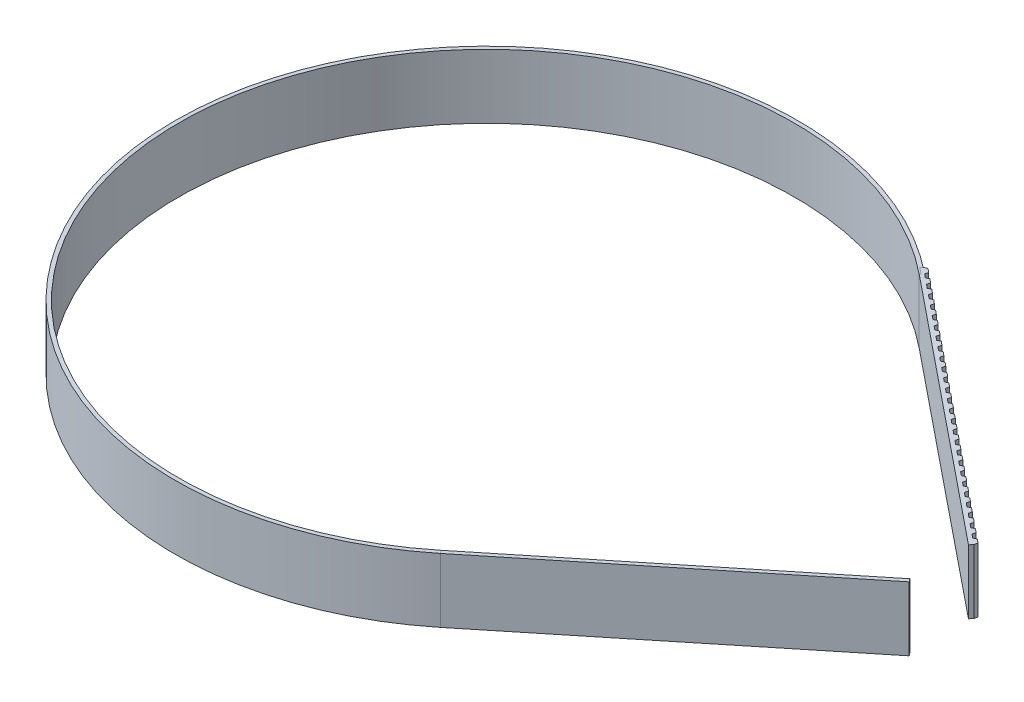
ISO-10303-21;
HEADER;
FILE_DESCRIPTION(('STEP AP214'),'2;1');
FILE_NAME('part.step','',(''),(''),'','','');
FILE_SCHEMA(('AUTOMOTIVE_DESIGN { 1 0 10303 214 1 1 1 1 }'));
ENDSEC;
DATA;
#1=APPLICATION_CONTEXT('core data for automotive mechanical design processes');
#2=APPLICATION_PROTOCOL_DEFINITION('international standard','automotive_design',2000,#1);
#3=PRODUCT_CONTEXT('',#1,'mechanical');
#4=PRODUCT('Part','Part','',(#3));
#5=PRODUCT_RELATED_PRODUCT_CATEGORY('part','',(#4));
#6=PRODUCT_DEFINITION_FORMATION('','',#4);
#7=PRODUCT_DEFINITION_CONTEXT('part definition',#1,'design');
#8=PRODUCT_DEFINITION('design','',#6,#7);
#9=PRODUCT_DEFINITION_SHAPE('','',#8);
#10=(LENGTH_UNIT() NAMED_UNIT(*) SI_UNIT(.MILLI.,.METRE.));
#11=(NAMED_UNIT(*) PLANE_ANGLE_UNIT() SI_UNIT($,.RADIAN.));
#12=(NAMED_UNIT(*) SI_UNIT($,.STERADIAN.) SOLID_ANGLE_UNIT());
#13=UNCERTAINTY_MEASURE_WITH_UNIT(LENGTH_MEASURE(1.E-05),#10,'distance_accuracy_value','');
#14=(GEOMETRIC_REPRESENTATION_CONTEXT(3) GLOBAL_UNCERTAINTY_ASSIGNED_CONTEXT((#13)) GLOBAL_UNIT_ASSIGNED_CONTEXT((#10,
#11,#12)) REPRESENTATION_CONTEXT('',''));
#15=CARTESIAN_POINT('',(0.,0.,0.));
#16=DIRECTION('',(0.,0.,1.));
#17=DIRECTION('',(1.,0.,0.));
#18=AXIS2_PLACEMENT_3D('',#15,#16,#17);
#19=CARTESIAN_POINT('',(76.4624275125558,-12.5,94.4232343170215));
#20=DIRECTION('',(-0.629320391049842,0.,-0.777145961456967));
#21=DIRECTION('',(-0.777145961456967,0.,0.629320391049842));
#22=AXIS2_PLACEMENT_3D('',#19,#20,#21);
#23=PLANE('',#22);
#24=DIRECTION('',(0.,1.,0.));
#25=VECTOR('',#24,1.);
#26=CARTESIAN_POINT('',(76.4624275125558,-12.5,94.4232343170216));
#27=LINE('',#26,#25);
#28=CARTESIAN_POINT('',(76.4624275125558,-12.5,94.4232343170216));
#29=VERTEX_POINT('',#28);
#30=CARTESIAN_POINT('',(76.4624275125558,12.5,94.4232343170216));
#31=VERTEX_POINT('',#30);
#32=EDGE_CURVE('E144',#29,#31,#27,.T.);
#33=ORIENTED_EDGE('',*,*,#32,.F.);
#34=DIRECTION('',(0.777145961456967,0.,-0.629320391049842));
#35=VECTOR('',#34,1.);
#36=CARTESIAN_POINT('',(76.4624275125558,-12.5,94.4232343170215));
#37=LINE('',#36,#35);
#38=CARTESIAN_POINT('',(177.491402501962,-12.5,12.6115834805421));
#39=VERTEX_POINT('',#38);
#40=EDGE_CURVE('E98',#29,#39,#37,.T.);
#41=ORIENTED_EDGE('',*,*,#40,.T.);
#42=DIRECTION('',(0.,1.,0.));
#43=VECTOR('',#42,1.);
#44=CARTESIAN_POINT('',(177.491402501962,-12.5,12.6115834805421));
#45=LINE('',#44,#43);
#46=CARTESIAN_POINT('',(177.491402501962,12.5,12.6115834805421));
#47=VERTEX_POINT('',#46);
#48=EDGE_CURVE('E142',#39,#47,#45,.T.);
#49=ORIENTED_EDGE('',*,*,#48,.T.);
#50=DIRECTION('',(0.777145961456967,0.,-0.629320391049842));
#51=VECTOR('',#50,1.);
#52=CARTESIAN_POINT('',(76.4624275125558,12.5,94.4232343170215));
#53=LINE('',#52,#51);
#54=EDGE_CURVE('E133',#31,#47,#53,.T.);
#55=ORIENTED_EDGE('',*,*,#54,.F.);
#56=EDGE_LOOP('',(#33,#41,#49,#55));
#57=FACE_BOUND('',#56,.T.);
#58=ADVANCED_FACE('F94',(#57),#23,.F.);
#59=CARTESIAN_POINT('',(75.5184469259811,12.5,93.2575153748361));
#60=DIRECTION('',(0.,-1.,0.));
#61=DIRECTION('',(0.,0.,-1.));
#62=AXIS2_PLACEMENT_3D('',#59,#60,#61);
#63=PLANE('',#62);
#64=DIRECTION('',(-0.629320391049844,0.,-0.777145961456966));
#65=VECTOR('',#64,1.);
#66=CARTESIAN_POINT('',(75.5184469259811,12.5,93.2575153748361));
#67=LINE('',#66,#65);
#68=CARTESIAN_POINT('',(75.5184469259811,12.5,93.2575153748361));
#69=VERTEX_POINT('',#68);
#70=EDGE_CURVE('E103',#31,#69,#67,.T.);
#71=ORIENTED_EDGE('',*,*,#70,.F.);
#72=ORIENTED_EDGE('',*,*,#54,.T.);
#73=DIRECTION('',(-0.629320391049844,0.,-0.777145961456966));
#74=VECTOR('',#73,1.);
#75=CARTESIAN_POINT('',(176.547421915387,12.5,11.4458645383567));
#76=LINE('',#75,#74);
#77=CARTESIAN_POINT('',(176.547421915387,12.5,11.4458645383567));
#78=VERTEX_POINT('',#77);
#79=EDGE_CURVE('E154',#47,#78,#76,.T.);
#80=ORIENTED_EDGE('',*,*,#79,.T.);
#81=DIRECTION('',(0.777145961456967,0.,-0.629320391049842));
#82=VECTOR('',#81,1.);
#83=CARTESIAN_POINT('',(75.5184469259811,12.5,93.2575153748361));
#84=LINE('',#83,#82);
#85=EDGE_CURVE('E163',#69,#78,#84,.T.);
#86=ORIENTED_EDGE('',*,*,#85,.F.);
#87=EDGE_LOOP('',(#71,#72,#80,#86));
#88=FACE_BOUND('',#87,.T.);
#89=ADVANCED_FACE('F167',(#88),#63,.F.);
#90=CARTESIAN_POINT('',(75.5184469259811,-12.5,93.2575153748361));
#91=DIRECTION('',(0.629320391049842,0.,0.777145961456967));
#92=DIRECTION('',(0.777145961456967,0.,-0.629320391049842));
#93=AXIS2_PLACEMENT_3D('',#90,#91,#92);
#94=PLANE('',#93);
#95=DIRECTION('',(0.,-1.,0.));
#96=VECTOR('',#95,1.);
#97=CARTESIAN_POINT('',(75.5184469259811,-12.5,93.2575153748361));
#98=LINE('',#97,#96);
#99=CARTESIAN_POINT('',(75.5184469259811,-12.5,93.2575153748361));
#100=VERTEX_POINT('',#99);
#101=EDGE_CURVE('E14',#69,#100,#98,.T.);
#102=ORIENTED_EDGE('',*,*,#101,.F.);
#103=ORIENTED_EDGE('',*,*,#85,.T.);
#104=DIRECTION('',(0.,-1.,0.));
#105=VECTOR('',#104,1.);
#106=CARTESIAN_POINT('',(176.547421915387,-12.5,11.4458645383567));
#107=LINE('',#106,#105);
#108=CARTESIAN_POINT('',(176.547421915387,-12.5,11.4458645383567));
#109=VERTEX_POINT('',#108);
#110=EDGE_CURVE('E164',#78,#109,#107,.T.);
#111=ORIENTED_EDGE('',*,*,#110,.T.);
#112=DIRECTION('',(0.777145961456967,0.,-0.629320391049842));
#113=VECTOR('',#112,1.);
#114=CARTESIAN_POINT('',(75.5184469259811,-12.5,93.2575153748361));
#115=LINE('',#114,#113);
#116=EDGE_CURVE('E116',#100,#109,#115,.T.);
#117=ORIENTED_EDGE('',*,*,#116,.F.);
#118=EDGE_LOOP('',(#102,#103,#111,#117));
#119=FACE_BOUND('',#118,.T.);
#120=ADVANCED_FACE('F166',(#119),#94,.F.);
#121=CARTESIAN_POINT('',(75.5184469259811,-12.5,93.2575153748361));
#122=DIRECTION('',(0.,1.,0.));
#123=DIRECTION('',(0.,0.,1.));
#124=AXIS2_PLACEMENT_3D('',#121,#122,#123);
#125=PLANE('',#124);
#126=DIRECTION('',(0.629320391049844,0.,0.777145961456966));
#127=VECTOR('',#126,1.);
#128=CARTESIAN_POINT('',(75.5184469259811,-12.5,93.2575153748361));
#129=LINE('',#128,#127);
#130=EDGE_CURVE('E151',#100,#29,#129,.T.);
#131=ORIENTED_EDGE('',*,*,#130,.F.);
#132=ORIENTED_EDGE('',*,*,#116,.T.);
#133=DIRECTION('',(0.629320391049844,0.,0.777145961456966));
#134=VECTOR('',#133,1.);
#135=CARTESIAN_POINT('',(176.547421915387,-12.5,11.4458645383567));
#136=LINE('',#135,#134);
#137=EDGE_CURVE('E147',#109,#39,#136,.T.);
#138=ORIENTED_EDGE('',*,*,#137,.T.);
#139=ORIENTED_EDGE('',*,*,#40,.F.);
#140=EDGE_LOOP('',(#131,#132,#138,#139));
#141=FACE_BOUND('',#140,.T.);
#142=ADVANCED_FACE('F148',(#141),#125,.F.);
#143=CARTESIAN_POINT('',(101.028974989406,0.,-81.8116508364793));
#144=DIRECTION('',(0.777145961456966,0.,-0.629320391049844));
#145=DIRECTION('',(-0.629320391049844,0.,-0.777145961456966));
#146=AXIS2_PLACEMENT_3D('',#143,#144,#145);
#147=PLANE('',#146);
#148=ORIENTED_EDGE('',*,*,#48,.F.);
#149=ORIENTED_EDGE('',*,*,#137,.F.);
#150=ORIENTED_EDGE('',*,*,#110,.F.);
#151=ORIENTED_EDGE('',*,*,#79,.F.);
#152=EDGE_LOOP('',(#148,#149,#150,#151));
#153=FACE_BOUND('',#152,.T.);
#154=ADVANCED_FACE('F153',(#153),#147,.T.);
#155=CARTESIAN_POINT('',(76.4624275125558,0.,94.4232343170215));
#156=DIRECTION('',(-0.777145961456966,0.,0.629320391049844));
#157=DIRECTION('',(0.629320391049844,0.,0.777145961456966));
#158=AXIS2_PLACEMENT_3D('',#155,#156,#157);
#159=PLANE('',#158);
#160=ORIENTED_EDGE('',*,*,#130,.T.);
#161=ORIENTED_EDGE('',*,*,#32,.T.);
#162=ORIENTED_EDGE('',*,*,#70,.T.);
#163=ORIENTED_EDGE('',*,*,#101,.T.);
#164=EDGE_LOOP('',(#160,#161,#162,#163));
#165=FACE_BOUND('',#164,.T.);
#166=ADVANCED_FACE('F96',(#165),#159,.T.);
#167=CLOSED_SHELL('',(#58,#89,#120,#142,#154,#166));
#168=MANIFOLD_SOLID_BREP('B2',#167);
#169=CARTESIAN_POINT('',(0.,0.,0.));
#170=DIRECTION('',(0.,1.,0.));
#171=DIRECTION('',(0.,0.,1.));
#172=AXIS2_PLACEMENT_3D('',#169,#170,#171);
#173=CYLINDRICAL_SURFACE('',#172,121.5);
#174=DIRECTION('',(0.,-1.,0.));
#175=VECTOR('',#174,1.);
#176=CARTESIAN_POINT('',(76.4624275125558,0.,94.4232343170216));
#177=LINE('',#176,#175);
#178=CARTESIAN_POINT('',(76.4624275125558,12.5,94.4232343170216));
#179=VERTEX_POINT('',#178);
#180=CARTESIAN_POINT('',(76.4624275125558,-12.5,94.4232343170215));
#181=VERTEX_POINT('',#180);
#182=EDGE_CURVE('E296',#179,#181,#177,.T.);
#183=ORIENTED_EDGE('',*,*,#182,.F.);
#184=CARTESIAN_POINT('',(0.,12.5,0.));
#185=DIRECTION('',(0.,1.,0.));
#186=DIRECTION('',(0.,0.,1.));
#187=AXIS2_PLACEMENT_3D('',#184,#185,#186);
#188=CIRCLE('',#187,121.5);
#189=CARTESIAN_POINT('',(76.4624275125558,12.5,-94.4232343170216));
#190=VERTEX_POINT('',#189);
#191=EDGE_CURVE('E270',#190,#179,#188,.T.);
#192=ORIENTED_EDGE('',*,*,#191,.F.);
#193=DIRECTION('',(0.,-1.,0.));
#194=VECTOR('',#193,1.);
#195=CARTESIAN_POINT('',(76.4624275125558,0.,-94.4232343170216));
#196=LINE('',#195,#194);
#197=CARTESIAN_POINT('',(76.4624275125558,-12.5,-94.4232343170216));
#198=VERTEX_POINT('',#197);
#199=EDGE_CURVE('E293',#198,#190,#196,.F.);
#200=ORIENTED_EDGE('',*,*,#199,.F.);
#201=CARTESIAN_POINT('',(0.,-12.5,0.));
#202=DIRECTION('',(0.,1.,0.));
#203=DIRECTION('',(0.,0.,1.));
#204=AXIS2_PLACEMENT_3D('',#201,#202,#203);
#205=CIRCLE('',#204,121.5);
#206=EDGE_CURVE('E257',#198,#181,#205,.T.);
#207=ORIENTED_EDGE('',*,*,#206,.T.);
#208=EDGE_LOOP('',(#183,#192,#200,#207));
#209=FACE_BOUND('',#208,.T.);
#210=ADVANCED_FACE('F253',(#209),#173,.T.);
#211=CARTESIAN_POINT('',(75.5184469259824,-12.5,-93.2575153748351));
#212=DIRECTION('',(0.,1.,0.));
#213=DIRECTION('',(0.,0.,1.));
#214=AXIS2_PLACEMENT_3D('',#211,#212,#213);
#215=PLANE('',#214);
#216=DIRECTION('',(-0.629320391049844,0.,-0.777145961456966));
#217=VECTOR('',#216,1.);
#218=CARTESIAN_POINT('',(76.4624275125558,-12.5,94.4232343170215));
#219=LINE('',#218,#217);
#220=CARTESIAN_POINT('',(75.5184469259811,-12.5,93.2575153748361));
#221=VERTEX_POINT('',#220);
#222=EDGE_CURVE('E312',#181,#221,#219,.T.);
#223=ORIENTED_EDGE('',*,*,#222,.F.);
#224=ORIENTED_EDGE('',*,*,#206,.F.);
#225=DIRECTION('',(0.629320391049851,0.,-0.77714596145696));
#226=VECTOR('',#225,1.);
#227=CARTESIAN_POINT('',(76.4624275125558,-12.5,-94.4232343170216));
#228=LINE('',#227,#226);
#229=CARTESIAN_POINT('',(75.518446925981,-12.5,-93.2575153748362));
#230=VERTEX_POINT('',#229);
#231=EDGE_CURVE('E307',#230,#198,#228,.T.);
#232=ORIENTED_EDGE('',*,*,#231,.F.);
#233=CARTESIAN_POINT('',(0.,-12.5,0.));
#234=DIRECTION('',(0.,1.,0.));
#235=DIRECTION('',(0.,0.,1.));
#236=AXIS2_PLACEMENT_3D('',#233,#234,#235);
#237=CIRCLE('',#236,120.);
#238=EDGE_CURVE('E318',#230,#221,#237,.T.);
#239=ORIENTED_EDGE('',*,*,#238,.T.);
#240=EDGE_LOOP('',(#223,#224,#232,#239));
#241=FACE_BOUND('',#240,.T.);
#242=ADVANCED_FACE('F328',(#241),#215,.F.);
#243=CARTESIAN_POINT('',(0.,0.,0.));
#244=DIRECTION('',(0.,1.,0.));
#245=DIRECTION('',(0.,0.,1.));
#246=AXIS2_PLACEMENT_3D('',#243,#244,#245);
#247=CYLINDRICAL_SURFACE('',#246,120.);
#248=DIRECTION('',(0.,-1.,0.));
#249=VECTOR('',#248,1.);
#250=CARTESIAN_POINT('',(75.5184469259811,0.,93.2575153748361));
#251=LINE('',#250,#249);
#252=CARTESIAN_POINT('',(75.5184469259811,12.5,93.2575153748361));
#253=VERTEX_POINT('',#252);
#254=EDGE_CURVE('E262',#221,#253,#251,.F.);
#255=ORIENTED_EDGE('',*,*,#254,.F.);
#256=ORIENTED_EDGE('',*,*,#238,.F.);
#257=DIRECTION('',(0.,-1.,0.));
#258=VECTOR('',#257,1.);
#259=CARTESIAN_POINT('',(75.518446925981,0.,-93.2575153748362));
#260=LINE('',#259,#258);
#261=CARTESIAN_POINT('',(75.518446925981,12.5,-93.2575153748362));
#262=VERTEX_POINT('',#261);
#263=EDGE_CURVE('E297',#262,#230,#260,.T.);
#264=ORIENTED_EDGE('',*,*,#263,.F.);
#265=CARTESIAN_POINT('',(0.,12.5,0.));
#266=DIRECTION('',(0.,1.,0.));
#267=DIRECTION('',(0.,0.,1.));
#268=AXIS2_PLACEMENT_3D('',#265,#266,#267);
#269=CIRCLE('',#268,120.);
#270=EDGE_CURVE('E276',#262,#253,#269,.T.);
#271=ORIENTED_EDGE('',*,*,#270,.T.);
#272=EDGE_LOOP('',(#255,#256,#264,#271));
#273=FACE_BOUND('',#272,.T.);
#274=ADVANCED_FACE('F326',(#273),#247,.F.);
#275=CARTESIAN_POINT('',(75.5184469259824,12.5,-93.2575153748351));
#276=DIRECTION('',(0.,-1.,0.));
#277=DIRECTION('',(0.,0.,-1.));
#278=AXIS2_PLACEMENT_3D('',#275,#276,#277);
#279=PLANE('',#278);
#280=DIRECTION('',(0.629320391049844,0.,0.777145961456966));
#281=VECTOR('',#280,1.);
#282=CARTESIAN_POINT('',(76.4624275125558,12.5,94.4232343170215));
#283=LINE('',#282,#281);
#284=EDGE_CURVE('E92',#253,#179,#283,.T.);
#285=ORIENTED_EDGE('',*,*,#284,.F.);
#286=ORIENTED_EDGE('',*,*,#270,.F.);
#287=DIRECTION('',(-0.629320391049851,0.,0.77714596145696));
#288=VECTOR('',#287,1.);
#289=CARTESIAN_POINT('',(76.4624275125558,12.5,-94.4232343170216));
#290=LINE('',#289,#288);
#291=EDGE_CURVE('E300',#190,#262,#290,.T.);
#292=ORIENTED_EDGE('',*,*,#291,.F.);
#293=ORIENTED_EDGE('',*,*,#191,.T.);
#294=EDGE_LOOP('',(#285,#286,#292,#293));
#295=FACE_BOUND('',#294,.T.);
#296=ADVANCED_FACE('F301',(#295),#279,.F.);
#297=CARTESIAN_POINT('',(76.4624275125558,0.,-94.4232343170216));
#298=DIRECTION('',(0.77714596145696,0.,0.629320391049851));
#299=DIRECTION('',(0.629320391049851,0.,-0.77714596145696));
#300=AXIS2_PLACEMENT_3D('',#297,#298,#299);
#301=PLANE('',#300);
#302=ORIENTED_EDGE('',*,*,#263,.T.);
#303=ORIENTED_EDGE('',*,*,#231,.T.);
#304=ORIENTED_EDGE('',*,*,#199,.T.);
#305=ORIENTED_EDGE('',*,*,#291,.T.);
#306=EDGE_LOOP('',(#302,#303,#304,#305));
#307=FACE_BOUND('',#306,.T.);
#308=ADVANCED_FACE('F306',(#307),#301,.T.);
#309=CARTESIAN_POINT('',(76.4624275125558,0.,94.4232343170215));
#310=DIRECTION('',(0.777145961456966,0.,-0.629320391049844));
#311=DIRECTION('',(-0.629320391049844,0.,-0.777145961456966));
#312=AXIS2_PLACEMENT_3D('',#309,#310,#311);
#313=PLANE('',#312);
#314=ORIENTED_EDGE('',*,*,#182,.T.);
#315=ORIENTED_EDGE('',*,*,#222,.T.);
#316=ORIENTED_EDGE('',*,*,#254,.T.);
#317=ORIENTED_EDGE('',*,*,#284,.T.);
#318=EDGE_LOOP('',(#314,#315,#316,#317));
#319=FACE_BOUND('',#318,.T.);
#320=ADVANCED_FACE('F255',(#319),#313,.T.);
#321=CLOSED_SHELL('',(#210,#242,#274,#296,#308,#320));
#322=MANIFOLD_SOLID_BREP('B8',#321);
#323=CARTESIAN_POINT('',(177.491402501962,-12.5,-12.6115834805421));
#324=DIRECTION('',(-0.629320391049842,0.,0.777145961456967));
#325=DIRECTION('',(0.777145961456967,0.,0.629320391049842));
#326=AXIS2_PLACEMENT_3D('',#323,#324,#325);
#327=PLANE('',#326);
#328=DIRECTION('',(0.,-1.,0.));
#329=VECTOR('',#328,1.);
#330=CARTESIAN_POINT('',(76.4626895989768,-12.5,-94.4230220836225));
#331=LINE('',#330,#329);
#332=CARTESIAN_POINT('',(76.4626895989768,12.5,-94.4230220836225));
#333=VERTEX_POINT('',#332);
#334=CARTESIAN_POINT('',(76.4626895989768,-12.5,-94.4230220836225));
#335=VERTEX_POINT('',#334);
#336=EDGE_CURVE('E420',#333,#335,#331,.T.);
#337=ORIENTED_EDGE('',*,*,#336,.F.);
#338=DIRECTION('',(-0.777145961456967,0.,-0.629320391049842));
#339=VECTOR('',#338,1.);
#340=CARTESIAN_POINT('',(177.491402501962,12.5,-12.6115834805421));
#341=LINE('',#340,#339);
#342=CARTESIAN_POINT('',(77.9474459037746,12.5,-93.2206901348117));
#343=VERTEX_POINT('',#342);
#344=EDGE_CURVE('E1872',#343,#333,#341,.T.);
#345=ORIENTED_EDGE('',*,*,#344,.F.);
#346=DIRECTION('',(0.,-1.,0.));
#347=VECTOR('',#346,1.);
#348=CARTESIAN_POINT('',(77.9474459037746,12.5,-93.2206901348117));
#349=LINE('',#348,#347);
#350=CARTESIAN_POINT('',(77.9474459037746,-12.5,-93.2206901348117));
#351=VERTEX_POINT('',#350);
#352=EDGE_CURVE('E1151',#343,#351,#349,.T.);
#353=ORIENTED_EDGE('',*,*,#352,.T.);
#354=DIRECTION('',(-0.777145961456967,0.,-0.629320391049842));
#355=VECTOR('',#354,1.);
#356=CARTESIAN_POINT('',(177.491402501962,-12.5,-12.6115834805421));
#357=LINE('',#356,#355);
#358=EDGE_CURVE('E425',#351,#335,#357,.T.);
#359=ORIENTED_EDGE('',*,*,#358,.T.);
#360=EDGE_LOOP('',(#337,#345,#353,#359));
#361=FACE_BOUND('',#360,.T.);
#362=ADVANCED_FACE('F405',(#361),#327,.F.);
#363=CARTESIAN_POINT('',(76.4624275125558,0.,-94.4232343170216));
#364=DIRECTION('',(-0.777145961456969,0.,-0.62932039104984));
#365=DIRECTION('',(-0.62932039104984,0.,0.777145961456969));
#366=AXIS2_PLACEMENT_3D('',#363,#364,#365);
#367=PLANE('',#366);
#368=DIRECTION('',(0.62932039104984,0.,-0.777145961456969));
#369=VECTOR('',#368,1.);
#370=CARTESIAN_POINT('',(75.5184469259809,12.5,-93.2575153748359));
#371=LINE('',#370,#369);
#372=CARTESIAN_POINT('',(75.5184469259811,12.5,-93.2575153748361));
#373=VERTEX_POINT('',#372);
#374=CARTESIAN_POINT('',(75.8392339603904,12.5,-93.6536543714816));
#375=VERTEX_POINT('',#374);
#376=EDGE_CURVE('E1853',#373,#375,#371,.T.);
#377=ORIENTED_EDGE('',*,*,#376,.T.);
#378=DIRECTION('',(0.,-1.,0.));
#379=VECTOR('',#378,1.);
#380=CARTESIAN_POINT('',(75.8392339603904,0.,-93.6536543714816));
#381=LINE('',#380,#379);
#382=CARTESIAN_POINT('',(75.8392339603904,-12.5,-93.6536543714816));
#383=VERTEX_POINT('',#382);
#384=EDGE_CURVE('E251',#375,#383,#381,.T.);
#385=ORIENTED_EDGE('',*,*,#384,.T.);
#386=DIRECTION('',(-0.62932039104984,0.,0.777145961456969));
#387=VECTOR('',#386,1.);
#388=CARTESIAN_POINT('',(75.5184469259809,-12.5,-93.2575153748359));
#389=LINE('',#388,#387);
#390=CARTESIAN_POINT('',(75.5184469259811,-12.5,-93.2575153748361));
#391=VERTEX_POINT('',#390);
#392=EDGE_CURVE('E1863',#383,#391,#389,.T.);
#393=ORIENTED_EDGE('',*,*,#392,.T.);
#394=DIRECTION('',(0.,1.,0.));
#395=VECTOR('',#394,1.);
#396=CARTESIAN_POINT('',(75.518446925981,-12.5,-93.2575153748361));
#397=LINE('',#396,#395);
#398=EDGE_CURVE('E413',#391,#373,#397,.T.);
#399=ORIENTED_EDGE('',*,*,#398,.T.);
#400=EDGE_LOOP('',(#377,#385,#393,#399));
#401=FACE_BOUND('',#400,.T.);
#402=ADVANCED_FACE('F407',(#401),#367,.T.);
#403=DIRECTION('',(0.,-1.,0.));
#404=VECTOR('',#403,1.);
#405=CARTESIAN_POINT('',(80.3481573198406,12.5,-91.2766323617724));
#406=LINE('',#405,#404);
#407=CARTESIAN_POINT('',(80.3481573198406,12.5,-91.2766323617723));
#408=VERTEX_POINT('',#407);
#409=CARTESIAN_POINT('',(80.3481573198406,-12.5,-91.2766323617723));
#410=VERTEX_POINT('',#409);
#411=EDGE_CURVE('E1148',#408,#410,#406,.T.);
#412=ORIENTED_EDGE('',*,*,#411,.F.);
#413=CARTESIAN_POINT('',(81.8331757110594,12.5,-90.0740881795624));
#414=VERTEX_POINT('',#413);
#415=EDGE_CURVE('E1880',#414,#408,#341,.T.);
#416=ORIENTED_EDGE('',*,*,#415,.F.);
#417=DIRECTION('',(0.,-1.,0.));
#418=VECTOR('',#417,1.);
#419=CARTESIAN_POINT('',(81.8331757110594,12.5,-90.0740881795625));
#420=LINE('',#419,#418);
#421=CARTESIAN_POINT('',(81.8331757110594,-12.5,-90.0740881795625));
#422=VERTEX_POINT('',#421);
#423=EDGE_CURVE('E1178',#414,#422,#420,.T.);
#424=ORIENTED_EDGE('',*,*,#423,.T.);
#425=EDGE_CURVE('E1882',#422,#410,#357,.T.);
#426=ORIENTED_EDGE('',*,*,#425,.T.);
#427=EDGE_LOOP('',(#412,#416,#424,#426));
#428=FACE_BOUND('',#427,.T.);
#429=ADVANCED_FACE('F2025',(#428),#327,.F.);
#430=DIRECTION('',(0.,-1.,0.));
#431=VECTOR('',#430,1.);
#432=CARTESIAN_POINT('',(84.2338871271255,12.5,-88.1300304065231));
#433=LINE('',#432,#431);
#434=CARTESIAN_POINT('',(84.2338871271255,12.5,-88.1300304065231));
#435=VERTEX_POINT('',#434);
#436=CARTESIAN_POINT('',(84.2338871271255,-12.5,-88.1300304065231));
#437=VERTEX_POINT('',#436);
#438=EDGE_CURVE('E1175',#435,#437,#433,.T.);
#439=ORIENTED_EDGE('',*,*,#438,.F.);
#440=CARTESIAN_POINT('',(85.7189055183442,12.5,-86.9274862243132));
#441=VERTEX_POINT('',#440);
#442=EDGE_CURVE('E2004',#441,#435,#341,.T.);
#443=ORIENTED_EDGE('',*,*,#442,.F.);
#444=DIRECTION('',(0.,-1.,0.));
#445=VECTOR('',#444,1.);
#446=CARTESIAN_POINT('',(85.7189055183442,12.5,-86.9274862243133));
#447=LINE('',#446,#445);
#448=CARTESIAN_POINT('',(85.7189055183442,-12.5,-86.9274862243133));
#449=VERTEX_POINT('',#448);
#450=EDGE_CURVE('E1206',#441,#449,#447,.T.);
#451=ORIENTED_EDGE('',*,*,#450,.T.);
#452=EDGE_CURVE('E1883',#449,#437,#357,.T.);
#453=ORIENTED_EDGE('',*,*,#452,.T.);
#454=EDGE_LOOP('',(#439,#443,#451,#453));
#455=FACE_BOUND('',#454,.T.);
#456=ADVANCED_FACE('F2033',(#455),#327,.F.);
#457=DIRECTION('',(0.,-1.,0.));
#458=VECTOR('',#457,1.);
#459=CARTESIAN_POINT('',(88.1196169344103,12.5,-84.983428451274));
#460=LINE('',#459,#458);
#461=CARTESIAN_POINT('',(88.1196169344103,12.5,-84.9834284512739));
#462=VERTEX_POINT('',#461);
#463=CARTESIAN_POINT('',(88.1196169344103,-12.5,-84.9834284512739));
#464=VERTEX_POINT('',#463);
#465=EDGE_CURVE('E1203',#462,#464,#460,.T.);
#466=ORIENTED_EDGE('',*,*,#465,.F.);
#467=CARTESIAN_POINT('',(89.604635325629,12.5,-83.780884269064));
#468=VERTEX_POINT('',#467);
#469=EDGE_CURVE('E2001',#468,#462,#341,.T.);
#470=ORIENTED_EDGE('',*,*,#469,.F.);
#471=DIRECTION('',(0.,-1.,0.));
#472=VECTOR('',#471,1.);
#473=CARTESIAN_POINT('',(89.6046353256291,12.5,-83.780884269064));
#474=LINE('',#473,#472);
#475=CARTESIAN_POINT('',(89.6046353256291,-12.5,-83.780884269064));
#476=VERTEX_POINT('',#475);
#477=EDGE_CURVE('E1234',#468,#476,#474,.T.);
#478=ORIENTED_EDGE('',*,*,#477,.T.);
#479=EDGE_CURVE('E1885',#476,#464,#357,.T.);
#480=ORIENTED_EDGE('',*,*,#479,.T.);
#481=EDGE_LOOP('',(#466,#470,#478,#480));
#482=FACE_BOUND('',#481,.T.);
#483=ADVANCED_FACE('F2756',(#482),#327,.F.);
#484=DIRECTION('',(0.,-1.,0.));
#485=VECTOR('',#484,1.);
#486=CARTESIAN_POINT('',(92.0053467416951,12.5,-81.8368264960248));
#487=LINE('',#486,#485);
#488=CARTESIAN_POINT('',(92.0053467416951,12.5,-81.8368264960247));
#489=VERTEX_POINT('',#488);
#490=CARTESIAN_POINT('',(92.0053467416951,-12.5,-81.8368264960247));
#491=VERTEX_POINT('',#490);
#492=EDGE_CURVE('E1231',#489,#491,#487,.T.);
#493=ORIENTED_EDGE('',*,*,#492,.F.);
#494=CARTESIAN_POINT('',(93.4903651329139,12.5,-80.6342823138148));
#495=VERTEX_POINT('',#494);
#496=EDGE_CURVE('E1998',#495,#489,#341,.T.);
#497=ORIENTED_EDGE('',*,*,#496,.F.);
#498=DIRECTION('',(0.,-1.,0.));
#499=VECTOR('',#498,1.);
#500=CARTESIAN_POINT('',(93.4903651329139,12.5,-80.6342823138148));
#501=LINE('',#500,#499);
#502=CARTESIAN_POINT('',(93.4903651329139,-12.5,-80.6342823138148));
#503=VERTEX_POINT('',#502);
#504=EDGE_CURVE('E1262',#495,#503,#501,.T.);
#505=ORIENTED_EDGE('',*,*,#504,.T.);
#506=EDGE_CURVE('E1887',#503,#491,#357,.T.);
#507=ORIENTED_EDGE('',*,*,#506,.T.);
#508=EDGE_LOOP('',(#493,#497,#505,#507));
#509=FACE_BOUND('',#508,.T.);
#510=ADVANCED_FACE('F2763',(#509),#327,.F.);
#511=DIRECTION('',(0.,-1.,0.));
#512=VECTOR('',#511,1.);
#513=CARTESIAN_POINT('',(95.89107654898,12.5,-78.6902245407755));
#514=LINE('',#513,#512);
#515=CARTESIAN_POINT('',(95.89107654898,12.5,-78.6902245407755));
#516=VERTEX_POINT('',#515);
#517=CARTESIAN_POINT('',(95.89107654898,-12.5,-78.6902245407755));
#518=VERTEX_POINT('',#517);
#519=EDGE_CURVE('E1259',#516,#518,#514,.T.);
#520=ORIENTED_EDGE('',*,*,#519,.F.);
#521=CARTESIAN_POINT('',(97.3760949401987,12.5,-77.4876803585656));
#522=VERTEX_POINT('',#521);
#523=EDGE_CURVE('E1995',#522,#516,#341,.T.);
#524=ORIENTED_EDGE('',*,*,#523,.F.);
#525=DIRECTION('',(0.,-1.,0.));
#526=VECTOR('',#525,1.);
#527=CARTESIAN_POINT('',(97.3760949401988,12.5,-77.4876803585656));
#528=LINE('',#527,#526);
#529=CARTESIAN_POINT('',(97.3760949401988,-12.5,-77.4876803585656));
#530=VERTEX_POINT('',#529);
#531=EDGE_CURVE('E1290',#522,#530,#528,.T.);
#532=ORIENTED_EDGE('',*,*,#531,.T.);
#533=EDGE_CURVE('E1889',#530,#518,#357,.T.);
#534=ORIENTED_EDGE('',*,*,#533,.T.);
#535=EDGE_LOOP('',(#520,#524,#532,#534));
#536=FACE_BOUND('',#535,.T.);
#537=ADVANCED_FACE('F2770',(#536),#327,.F.);
#538=DIRECTION('',(0.,-1.,0.));
#539=VECTOR('',#538,1.);
#540=CARTESIAN_POINT('',(99.7768063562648,12.5,-75.5436225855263));
#541=LINE('',#540,#539);
#542=CARTESIAN_POINT('',(99.7768063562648,12.5,-75.5436225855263));
#543=VERTEX_POINT('',#542);
#544=CARTESIAN_POINT('',(99.7768063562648,-12.5,-75.5436225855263));
#545=VERTEX_POINT('',#544);
#546=EDGE_CURVE('E1287',#543,#545,#541,.T.);
#547=ORIENTED_EDGE('',*,*,#546,.F.);
#548=CARTESIAN_POINT('',(101.261824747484,12.5,-74.3410784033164));
#549=VERTEX_POINT('',#548);
#550=EDGE_CURVE('E1992',#549,#543,#341,.T.);
#551=ORIENTED_EDGE('',*,*,#550,.F.);
#552=DIRECTION('',(0.,-1.,0.));
#553=VECTOR('',#552,1.);
#554=CARTESIAN_POINT('',(101.261824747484,12.5,-74.3410784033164));
#555=LINE('',#554,#553);
#556=CARTESIAN_POINT('',(101.261824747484,-12.5,-74.3410784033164));
#557=VERTEX_POINT('',#556);
#558=EDGE_CURVE('E1318',#549,#557,#555,.T.);
#559=ORIENTED_EDGE('',*,*,#558,.T.);
#560=EDGE_CURVE('E1891',#557,#545,#357,.T.);
#561=ORIENTED_EDGE('',*,*,#560,.T.);
#562=EDGE_LOOP('',(#547,#551,#559,#561));
#563=FACE_BOUND('',#562,.T.);
#564=ADVANCED_FACE('F2777',(#563),#327,.F.);
#565=DIRECTION('',(0.,-1.,0.));
#566=VECTOR('',#565,1.);
#567=CARTESIAN_POINT('',(103.66253616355,12.5,-72.3970206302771));
#568=LINE('',#567,#566);
#569=CARTESIAN_POINT('',(103.66253616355,12.5,-72.3970206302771));
#570=VERTEX_POINT('',#569);
#571=CARTESIAN_POINT('',(103.66253616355,-12.5,-72.3970206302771));
#572=VERTEX_POINT('',#571);
#573=EDGE_CURVE('E1315',#570,#572,#568,.T.);
#574=ORIENTED_EDGE('',*,*,#573,.F.);
#575=CARTESIAN_POINT('',(105.147554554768,12.5,-71.1944764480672));
#576=VERTEX_POINT('',#575);
#577=EDGE_CURVE('E1989',#576,#570,#341,.T.);
#578=ORIENTED_EDGE('',*,*,#577,.F.);
#579=DIRECTION('',(0.,-1.,0.));
#580=VECTOR('',#579,1.);
#581=CARTESIAN_POINT('',(105.147554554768,12.5,-71.1944764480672));
#582=LINE('',#581,#580);
#583=CARTESIAN_POINT('',(105.147554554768,-12.5,-71.1944764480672));
#584=VERTEX_POINT('',#583);
#585=EDGE_CURVE('E1346',#576,#584,#582,.T.);
#586=ORIENTED_EDGE('',*,*,#585,.T.);
#587=EDGE_CURVE('E1893',#584,#572,#357,.T.);
#588=ORIENTED_EDGE('',*,*,#587,.T.);
#589=EDGE_LOOP('',(#574,#578,#586,#588));
#590=FACE_BOUND('',#589,.T.);
#591=ADVANCED_FACE('F2784',(#590),#327,.F.);
#592=DIRECTION('',(0.,-1.,0.));
#593=VECTOR('',#592,1.);
#594=CARTESIAN_POINT('',(107.548265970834,12.5,-69.2504186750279));
#595=LINE('',#594,#593);
#596=CARTESIAN_POINT('',(107.548265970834,12.5,-69.2504186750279));
#597=VERTEX_POINT('',#596);
#598=CARTESIAN_POINT('',(107.548265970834,-12.5,-69.2504186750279));
#599=VERTEX_POINT('',#598);
#600=EDGE_CURVE('E1343',#597,#599,#595,.T.);
#601=ORIENTED_EDGE('',*,*,#600,.F.);
#602=CARTESIAN_POINT('',(109.033284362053,12.5,-68.047874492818));
#603=VERTEX_POINT('',#602);
#604=EDGE_CURVE('E1986',#603,#597,#341,.T.);
#605=ORIENTED_EDGE('',*,*,#604,.F.);
#606=DIRECTION('',(0.,-1.,0.));
#607=VECTOR('',#606,1.);
#608=CARTESIAN_POINT('',(109.033284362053,12.5,-68.047874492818));
#609=LINE('',#608,#607);
#610=CARTESIAN_POINT('',(109.033284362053,-12.5,-68.047874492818));
#611=VERTEX_POINT('',#610);
#612=EDGE_CURVE('E1374',#603,#611,#609,.T.);
#613=ORIENTED_EDGE('',*,*,#612,.T.);
#614=EDGE_CURVE('E1895',#611,#599,#357,.T.);
#615=ORIENTED_EDGE('',*,*,#614,.T.);
#616=EDGE_LOOP('',(#601,#605,#613,#615));
#617=FACE_BOUND('',#616,.T.);
#618=ADVANCED_FACE('F2791',(#617),#327,.F.);
#619=DIRECTION('',(0.,-1.,0.));
#620=VECTOR('',#619,1.);
#621=CARTESIAN_POINT('',(111.433995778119,12.5,-66.1038167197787));
#622=LINE('',#621,#620);
#623=CARTESIAN_POINT('',(111.433995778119,12.5,-66.1038167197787));
#624=VERTEX_POINT('',#623);
#625=CARTESIAN_POINT('',(111.433995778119,-12.5,-66.1038167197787));
#626=VERTEX_POINT('',#625);
#627=EDGE_CURVE('E1371',#624,#626,#622,.T.);
#628=ORIENTED_EDGE('',*,*,#627,.F.);
#629=CARTESIAN_POINT('',(112.919014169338,12.5,-64.9012725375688));
#630=VERTEX_POINT('',#629);
#631=EDGE_CURVE('E1983',#630,#624,#341,.T.);
#632=ORIENTED_EDGE('',*,*,#631,.F.);
#633=DIRECTION('',(0.,-1.,0.));
#634=VECTOR('',#633,1.);
#635=CARTESIAN_POINT('',(112.919014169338,12.5,-64.9012725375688));
#636=LINE('',#635,#634);
#637=CARTESIAN_POINT('',(112.919014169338,-12.5,-64.9012725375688));
#638=VERTEX_POINT('',#637);
#639=EDGE_CURVE('E1402',#630,#638,#636,.T.);
#640=ORIENTED_EDGE('',*,*,#639,.T.);
#641=EDGE_CURVE('E1897',#638,#626,#357,.T.);
#642=ORIENTED_EDGE('',*,*,#641,.T.);
#643=EDGE_LOOP('',(#628,#632,#640,#642));
#644=FACE_BOUND('',#643,.T.);
#645=ADVANCED_FACE('F2798',(#644),#327,.F.);
#646=DIRECTION('',(0.,-1.,0.));
#647=VECTOR('',#646,1.);
#648=CARTESIAN_POINT('',(115.319725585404,12.5,-62.9572147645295));
#649=LINE('',#648,#647);
#650=CARTESIAN_POINT('',(115.319725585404,12.5,-62.9572147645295));
#651=VERTEX_POINT('',#650);
#652=CARTESIAN_POINT('',(115.319725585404,-12.5,-62.9572147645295));
#653=VERTEX_POINT('',#652);
#654=EDGE_CURVE('E1399',#651,#653,#649,.T.);
#655=ORIENTED_EDGE('',*,*,#654,.F.);
#656=CARTESIAN_POINT('',(116.804743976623,12.5,-61.7546705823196));
#657=VERTEX_POINT('',#656);
#658=EDGE_CURVE('E1980',#657,#651,#341,.T.);
#659=ORIENTED_EDGE('',*,*,#658,.F.);
#660=DIRECTION('',(0.,-1.,0.));
#661=VECTOR('',#660,1.);
#662=CARTESIAN_POINT('',(116.804743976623,12.5,-61.7546705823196));
#663=LINE('',#662,#661);
#664=CARTESIAN_POINT('',(116.804743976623,-12.5,-61.7546705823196));
#665=VERTEX_POINT('',#664);
#666=EDGE_CURVE('E1430',#657,#665,#663,.T.);
#667=ORIENTED_EDGE('',*,*,#666,.T.);
#668=EDGE_CURVE('E1899',#665,#653,#357,.T.);
#669=ORIENTED_EDGE('',*,*,#668,.T.);
#670=EDGE_LOOP('',(#655,#659,#667,#669));
#671=FACE_BOUND('',#670,.T.);
#672=ADVANCED_FACE('F2805',(#671),#327,.F.);
#673=DIRECTION('',(0.,-1.,0.));
#674=VECTOR('',#673,1.);
#675=CARTESIAN_POINT('',(119.205455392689,12.5,-59.8106128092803));
#676=LINE('',#675,#674);
#677=CARTESIAN_POINT('',(119.205455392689,12.5,-59.8106128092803));
#678=VERTEX_POINT('',#677);
#679=CARTESIAN_POINT('',(119.205455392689,-12.5,-59.8106128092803));
#680=VERTEX_POINT('',#679);
#681=EDGE_CURVE('E1427',#678,#680,#676,.T.);
#682=ORIENTED_EDGE('',*,*,#681,.F.);
#683=CARTESIAN_POINT('',(120.690473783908,12.5,-58.6080686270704));
#684=VERTEX_POINT('',#683);
#685=EDGE_CURVE('E1977',#684,#678,#341,.T.);
#686=ORIENTED_EDGE('',*,*,#685,.F.);
#687=DIRECTION('',(0.,-1.,0.));
#688=VECTOR('',#687,1.);
#689=CARTESIAN_POINT('',(120.690473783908,12.5,-58.6080686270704));
#690=LINE('',#689,#688);
#691=CARTESIAN_POINT('',(120.690473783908,-12.5,-58.6080686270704));
#692=VERTEX_POINT('',#691);
#693=EDGE_CURVE('E1458',#684,#692,#690,.T.);
#694=ORIENTED_EDGE('',*,*,#693,.T.);
#695=EDGE_CURVE('E1901',#692,#680,#357,.T.);
#696=ORIENTED_EDGE('',*,*,#695,.T.);
#697=EDGE_LOOP('',(#682,#686,#694,#696));
#698=FACE_BOUND('',#697,.T.);
#699=ADVANCED_FACE('F2812',(#698),#327,.F.);
#700=DIRECTION('',(0.,-1.,0.));
#701=VECTOR('',#700,1.);
#702=CARTESIAN_POINT('',(123.091185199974,12.5,-56.6640108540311));
#703=LINE('',#702,#701);
#704=CARTESIAN_POINT('',(123.091185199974,12.5,-56.6640108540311));
#705=VERTEX_POINT('',#704);
#706=CARTESIAN_POINT('',(123.091185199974,-12.5,-56.6640108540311));
#707=VERTEX_POINT('',#706);
#708=EDGE_CURVE('E1455',#705,#707,#703,.T.);
#709=ORIENTED_EDGE('',*,*,#708,.F.);
#710=CARTESIAN_POINT('',(124.576203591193,12.5,-55.4614666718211));
#711=VERTEX_POINT('',#710);
#712=EDGE_CURVE('E1974',#711,#705,#341,.T.);
#713=ORIENTED_EDGE('',*,*,#712,.F.);
#714=DIRECTION('',(0.,-1.,0.));
#715=VECTOR('',#714,1.);
#716=CARTESIAN_POINT('',(124.576203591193,12.5,-55.4614666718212));
#717=LINE('',#716,#715);
#718=CARTESIAN_POINT('',(124.576203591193,-12.5,-55.4614666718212));
#719=VERTEX_POINT('',#718);
#720=EDGE_CURVE('E1486',#711,#719,#717,.T.);
#721=ORIENTED_EDGE('',*,*,#720,.T.);
#722=EDGE_CURVE('E1903',#719,#707,#357,.T.);
#723=ORIENTED_EDGE('',*,*,#722,.T.);
#724=EDGE_LOOP('',(#709,#713,#721,#723));
#725=FACE_BOUND('',#724,.T.);
#726=ADVANCED_FACE('F2819',(#725),#327,.F.);
#727=DIRECTION('',(0.,-1.,0.));
#728=VECTOR('',#727,1.);
#729=CARTESIAN_POINT('',(126.976915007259,12.5,-53.5174088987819));
#730=LINE('',#729,#728);
#731=CARTESIAN_POINT('',(126.976915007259,12.5,-53.5174088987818));
#732=VERTEX_POINT('',#731);
#733=CARTESIAN_POINT('',(126.976915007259,-12.5,-53.5174088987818));
#734=VERTEX_POINT('',#733);
#735=EDGE_CURVE('E1483',#732,#734,#730,.T.);
#736=ORIENTED_EDGE('',*,*,#735,.F.);
#737=CARTESIAN_POINT('',(128.461933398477,12.5,-52.3148647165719));
#738=VERTEX_POINT('',#737);
#739=EDGE_CURVE('E1971',#738,#732,#341,.T.);
#740=ORIENTED_EDGE('',*,*,#739,.F.);
#741=DIRECTION('',(0.,-1.,0.));
#742=VECTOR('',#741,1.);
#743=CARTESIAN_POINT('',(128.461933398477,12.5,-52.3148647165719));
#744=LINE('',#743,#742);
#745=CARTESIAN_POINT('',(128.461933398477,-12.5,-52.3148647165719));
#746=VERTEX_POINT('',#745);
#747=EDGE_CURVE('E1514',#738,#746,#744,.T.);
#748=ORIENTED_EDGE('',*,*,#747,.T.);
#749=EDGE_CURVE('E1905',#746,#734,#357,.T.);
#750=ORIENTED_EDGE('',*,*,#749,.T.);
#751=EDGE_LOOP('',(#736,#740,#748,#750));
#752=FACE_BOUND('',#751,.T.);
#753=ADVANCED_FACE('F2826',(#752),#327,.F.);
#754=DIRECTION('',(0.,-1.,0.));
#755=VECTOR('',#754,1.);
#756=CARTESIAN_POINT('',(130.862644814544,12.5,-50.3708069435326));
#757=LINE('',#756,#755);
#758=CARTESIAN_POINT('',(130.862644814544,12.5,-50.3708069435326));
#759=VERTEX_POINT('',#758);
#760=CARTESIAN_POINT('',(130.862644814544,-12.5,-50.3708069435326));
#761=VERTEX_POINT('',#760);
#762=EDGE_CURVE('E1511',#759,#761,#757,.T.);
#763=ORIENTED_EDGE('',*,*,#762,.F.);
#764=CARTESIAN_POINT('',(132.347663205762,12.5,-49.1682627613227));
#765=VERTEX_POINT('',#764);
#766=EDGE_CURVE('E1968',#765,#759,#341,.T.);
#767=ORIENTED_EDGE('',*,*,#766,.F.);
#768=DIRECTION('',(0.,-1.,0.));
#769=VECTOR('',#768,1.);
#770=CARTESIAN_POINT('',(132.347663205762,12.5,-49.1682627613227));
#771=LINE('',#770,#769);
#772=CARTESIAN_POINT('',(132.347663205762,-12.5,-49.1682627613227));
#773=VERTEX_POINT('',#772);
#774=EDGE_CURVE('E1542',#765,#773,#771,.T.);
#775=ORIENTED_EDGE('',*,*,#774,.T.);
#776=EDGE_CURVE('E1907',#773,#761,#357,.T.);
#777=ORIENTED_EDGE('',*,*,#776,.T.);
#778=EDGE_LOOP('',(#763,#767,#775,#777));
#779=FACE_BOUND('',#778,.T.);
#780=ADVANCED_FACE('F2833',(#779),#327,.F.);
#781=DIRECTION('',(0.,-1.,0.));
#782=VECTOR('',#781,1.);
#783=CARTESIAN_POINT('',(134.748374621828,12.5,-47.2242049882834));
#784=LINE('',#783,#782);
#785=CARTESIAN_POINT('',(134.748374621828,12.5,-47.2242049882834));
#786=VERTEX_POINT('',#785);
#787=CARTESIAN_POINT('',(134.748374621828,-12.5,-47.2242049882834));
#788=VERTEX_POINT('',#787);
#789=EDGE_CURVE('E1539',#786,#788,#784,.T.);
#790=ORIENTED_EDGE('',*,*,#789,.F.);
#791=CARTESIAN_POINT('',(136.233393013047,12.5,-46.0216608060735));
#792=VERTEX_POINT('',#791);
#793=EDGE_CURVE('E1965',#792,#786,#341,.T.);
#794=ORIENTED_EDGE('',*,*,#793,.F.);
#795=DIRECTION('',(0.,-1.,0.));
#796=VECTOR('',#795,1.);
#797=CARTESIAN_POINT('',(136.233393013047,12.5,-46.0216608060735));
#798=LINE('',#797,#796);
#799=CARTESIAN_POINT('',(136.233393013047,-12.5,-46.0216608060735));
#800=VERTEX_POINT('',#799);
#801=EDGE_CURVE('E1570',#792,#800,#798,.T.);
#802=ORIENTED_EDGE('',*,*,#801,.T.);
#803=EDGE_CURVE('E1909',#800,#788,#357,.T.);
#804=ORIENTED_EDGE('',*,*,#803,.T.);
#805=EDGE_LOOP('',(#790,#794,#802,#804));
#806=FACE_BOUND('',#805,.T.);
#807=ADVANCED_FACE('F2840',(#806),#327,.F.);
#808=DIRECTION('',(0.,-1.,0.));
#809=VECTOR('',#808,1.);
#810=CARTESIAN_POINT('',(138.634104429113,12.5,-44.0776030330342));
#811=LINE('',#810,#809);
#812=CARTESIAN_POINT('',(138.634104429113,12.5,-44.0776030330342));
#813=VERTEX_POINT('',#812);
#814=CARTESIAN_POINT('',(138.634104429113,-12.5,-44.0776030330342));
#815=VERTEX_POINT('',#814);
#816=EDGE_CURVE('E1567',#813,#815,#811,.T.);
#817=ORIENTED_EDGE('',*,*,#816,.F.);
#818=CARTESIAN_POINT('',(140.119122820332,12.5,-42.8750588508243));
#819=VERTEX_POINT('',#818);
#820=EDGE_CURVE('E1962',#819,#813,#341,.T.);
#821=ORIENTED_EDGE('',*,*,#820,.F.);
#822=DIRECTION('',(0.,-1.,0.));
#823=VECTOR('',#822,1.);
#824=CARTESIAN_POINT('',(140.119122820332,12.5,-42.8750588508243));
#825=LINE('',#824,#823);
#826=CARTESIAN_POINT('',(140.119122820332,-12.5,-42.8750588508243));
#827=VERTEX_POINT('',#826);
#828=EDGE_CURVE('E1598',#819,#827,#825,.T.);
#829=ORIENTED_EDGE('',*,*,#828,.T.);
#830=EDGE_CURVE('E1911',#827,#815,#357,.T.);
#831=ORIENTED_EDGE('',*,*,#830,.T.);
#832=EDGE_LOOP('',(#817,#821,#829,#831));
#833=FACE_BOUND('',#832,.T.);
#834=ADVANCED_FACE('F2847',(#833),#327,.F.);
#835=DIRECTION('',(0.,-1.,0.));
#836=VECTOR('',#835,1.);
#837=CARTESIAN_POINT('',(142.519834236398,12.5,-40.931001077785));
#838=LINE('',#837,#836);
#839=CARTESIAN_POINT('',(142.519834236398,12.5,-40.931001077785));
#840=VERTEX_POINT('',#839);
#841=CARTESIAN_POINT('',(142.519834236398,-12.5,-40.931001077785));
#842=VERTEX_POINT('',#841);
#843=EDGE_CURVE('E1595',#840,#842,#838,.T.);
#844=ORIENTED_EDGE('',*,*,#843,.F.);
#845=CARTESIAN_POINT('',(144.004852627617,12.5,-39.7284568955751));
#846=VERTEX_POINT('',#845);
#847=EDGE_CURVE('E1959',#846,#840,#341,.T.);
#848=ORIENTED_EDGE('',*,*,#847,.F.);
#849=DIRECTION('',(0.,-1.,0.));
#850=VECTOR('',#849,1.);
#851=CARTESIAN_POINT('',(144.004852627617,12.5,-39.7284568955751));
#852=LINE('',#851,#850);
#853=CARTESIAN_POINT('',(144.004852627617,-12.5,-39.7284568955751));
#854=VERTEX_POINT('',#853);
#855=EDGE_CURVE('E1626',#846,#854,#852,.T.);
#856=ORIENTED_EDGE('',*,*,#855,.T.);
#857=EDGE_CURVE('E1913',#854,#842,#357,.T.);
#858=ORIENTED_EDGE('',*,*,#857,.T.);
#859=EDGE_LOOP('',(#844,#848,#856,#858));
#860=FACE_BOUND('',#859,.T.);
#861=ADVANCED_FACE('F2854',(#860),#327,.F.);
#862=DIRECTION('',(0.,-1.,0.));
#863=VECTOR('',#862,1.);
#864=CARTESIAN_POINT('',(146.405564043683,12.5,-37.7843991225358));
#865=LINE('',#864,#863);
#866=CARTESIAN_POINT('',(146.405564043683,12.5,-37.7843991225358));
#867=VERTEX_POINT('',#866);
#868=CARTESIAN_POINT('',(146.405564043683,-12.5,-37.7843991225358));
#869=VERTEX_POINT('',#868);
#870=EDGE_CURVE('E1623',#867,#869,#865,.T.);
#871=ORIENTED_EDGE('',*,*,#870,.F.);
#872=CARTESIAN_POINT('',(147.890582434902,12.5,-36.5818549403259));
#873=VERTEX_POINT('',#872);
#874=EDGE_CURVE('E1956',#873,#867,#341,.T.);
#875=ORIENTED_EDGE('',*,*,#874,.F.);
#876=DIRECTION('',(0.,-1.,0.));
#877=VECTOR('',#876,1.);
#878=CARTESIAN_POINT('',(147.890582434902,12.5,-36.5818549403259));
#879=LINE('',#878,#877);
#880=CARTESIAN_POINT('',(147.890582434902,-12.5,-36.5818549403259));
#881=VERTEX_POINT('',#880);
#882=EDGE_CURVE('E1654',#873,#881,#879,.T.);
#883=ORIENTED_EDGE('',*,*,#882,.T.);
#884=EDGE_CURVE('E1915',#881,#869,#357,.T.);
#885=ORIENTED_EDGE('',*,*,#884,.T.);
#886=EDGE_LOOP('',(#871,#875,#883,#885));
#887=FACE_BOUND('',#886,.T.);
#888=ADVANCED_FACE('F2861',(#887),#327,.F.);
#889=DIRECTION('',(0.,-1.,0.));
#890=VECTOR('',#889,1.);
#891=CARTESIAN_POINT('',(150.291293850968,12.5,-34.6377971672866));
#892=LINE('',#891,#890);
#893=CARTESIAN_POINT('',(150.291293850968,12.5,-34.6377971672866));
#894=VERTEX_POINT('',#893);
#895=CARTESIAN_POINT('',(150.291293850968,-12.5,-34.6377971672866));
#896=VERTEX_POINT('',#895);
#897=EDGE_CURVE('E1651',#894,#896,#892,.T.);
#898=ORIENTED_EDGE('',*,*,#897,.F.);
#899=CARTESIAN_POINT('',(151.776312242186,12.5,-33.4352529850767));
#900=VERTEX_POINT('',#899);
#901=EDGE_CURVE('E1953',#900,#894,#341,.T.);
#902=ORIENTED_EDGE('',*,*,#901,.F.);
#903=DIRECTION('',(0.,-1.,0.));
#904=VECTOR('',#903,1.);
#905=CARTESIAN_POINT('',(151.776312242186,12.5,-33.4352529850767));
#906=LINE('',#905,#904);
#907=CARTESIAN_POINT('',(151.776312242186,-12.5,-33.4352529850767));
#908=VERTEX_POINT('',#907);
#909=EDGE_CURVE('E1682',#900,#908,#906,.T.);
#910=ORIENTED_EDGE('',*,*,#909,.T.);
#911=EDGE_CURVE('E1917',#908,#896,#357,.T.);
#912=ORIENTED_EDGE('',*,*,#911,.T.);
#913=EDGE_LOOP('',(#898,#902,#910,#912));
#914=FACE_BOUND('',#913,.T.);
#915=ADVANCED_FACE('F2868',(#914),#327,.F.);
#916=DIRECTION('',(0.,-1.,0.));
#917=VECTOR('',#916,1.);
#918=CARTESIAN_POINT('',(154.177023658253,12.5,-31.4911952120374));
#919=LINE('',#918,#917);
#920=CARTESIAN_POINT('',(154.177023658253,12.5,-31.4911952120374));
#921=VERTEX_POINT('',#920);
#922=CARTESIAN_POINT('',(154.177023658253,-12.5,-31.4911952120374));
#923=VERTEX_POINT('',#922);
#924=EDGE_CURVE('E1679',#921,#923,#919,.T.);
#925=ORIENTED_EDGE('',*,*,#924,.F.);
#926=CARTESIAN_POINT('',(155.662042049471,12.5,-30.2886510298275));
#927=VERTEX_POINT('',#926);
#928=EDGE_CURVE('E1950',#927,#921,#341,.T.);
#929=ORIENTED_EDGE('',*,*,#928,.F.);
#930=DIRECTION('',(0.,-1.,0.));
#931=VECTOR('',#930,1.);
#932=CARTESIAN_POINT('',(155.662042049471,12.5,-30.2886510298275));
#933=LINE('',#932,#931);
#934=CARTESIAN_POINT('',(155.662042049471,-12.5,-30.2886510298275));
#935=VERTEX_POINT('',#934);
#936=EDGE_CURVE('E1710',#927,#935,#933,.T.);
#937=ORIENTED_EDGE('',*,*,#936,.T.);
#938=EDGE_CURVE('E1919',#935,#923,#357,.T.);
#939=ORIENTED_EDGE('',*,*,#938,.T.);
#940=EDGE_LOOP('',(#925,#929,#937,#939));
#941=FACE_BOUND('',#940,.T.);
#942=ADVANCED_FACE('F2875',(#941),#327,.F.);
#943=DIRECTION('',(0.,-1.,0.));
#944=VECTOR('',#943,1.);
#945=CARTESIAN_POINT('',(158.062753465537,12.5,-28.3445932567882));
#946=LINE('',#945,#944);
#947=CARTESIAN_POINT('',(158.062753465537,12.5,-28.3445932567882));
#948=VERTEX_POINT('',#947);
#949=CARTESIAN_POINT('',(158.062753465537,-12.5,-28.3445932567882));
#950=VERTEX_POINT('',#949);
#951=EDGE_CURVE('E1707',#948,#950,#946,.T.);
#952=ORIENTED_EDGE('',*,*,#951,.F.);
#953=CARTESIAN_POINT('',(159.547771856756,12.5,-27.1420490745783));
#954=VERTEX_POINT('',#953);
#955=EDGE_CURVE('E1947',#954,#948,#341,.T.);
#956=ORIENTED_EDGE('',*,*,#955,.F.);
#957=DIRECTION('',(0.,-1.,0.));
#958=VECTOR('',#957,1.);
#959=CARTESIAN_POINT('',(159.547771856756,12.5,-27.1420490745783));
#960=LINE('',#959,#958);
#961=CARTESIAN_POINT('',(159.547771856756,-12.5,-27.1420490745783));
#962=VERTEX_POINT('',#961);
#963=EDGE_CURVE('E1738',#954,#962,#960,.T.);
#964=ORIENTED_EDGE('',*,*,#963,.T.);
#965=EDGE_CURVE('E1921',#962,#950,#357,.T.);
#966=ORIENTED_EDGE('',*,*,#965,.T.);
#967=EDGE_LOOP('',(#952,#956,#964,#966));
#968=FACE_BOUND('',#967,.T.);
#969=ADVANCED_FACE('F2882',(#968),#327,.F.);
#970=DIRECTION('',(0.,-1.,0.));
#971=VECTOR('',#970,1.);
#972=CARTESIAN_POINT('',(161.948483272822,12.5,-25.197991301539));
#973=LINE('',#972,#971);
#974=CARTESIAN_POINT('',(161.948483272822,12.5,-25.197991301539));
#975=VERTEX_POINT('',#974);
#976=CARTESIAN_POINT('',(161.948483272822,-12.5,-25.197991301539));
#977=VERTEX_POINT('',#976);
#978=EDGE_CURVE('E1735',#975,#977,#973,.T.);
#979=ORIENTED_EDGE('',*,*,#978,.F.);
#980=CARTESIAN_POINT('',(163.433501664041,12.5,-23.9954471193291));
#981=VERTEX_POINT('',#980);
#982=EDGE_CURVE('E1945',#981,#975,#341,.T.);
#983=ORIENTED_EDGE('',*,*,#982,.F.);
#984=DIRECTION('',(0.,-1.,0.));
#985=VECTOR('',#984,1.);
#986=CARTESIAN_POINT('',(163.433501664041,12.5,-23.9954471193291));
#987=LINE('',#986,#985);
#988=CARTESIAN_POINT('',(163.433501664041,-12.5,-23.9954471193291));
#989=VERTEX_POINT('',#988);
#990=EDGE_CURVE('E1766',#981,#989,#987,.T.);
#991=ORIENTED_EDGE('',*,*,#990,.T.);
#992=EDGE_CURVE('E1923',#989,#977,#357,.T.);
#993=ORIENTED_EDGE('',*,*,#992,.T.);
#994=EDGE_LOOP('',(#979,#983,#991,#993));
#995=FACE_BOUND('',#994,.T.);
#996=ADVANCED_FACE('F2889',(#995),#327,.F.);
#997=DIRECTION('',(0.,-1.,0.));
#998=VECTOR('',#997,1.);
#999=CARTESIAN_POINT('',(165.834213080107,12.5,-22.0513893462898));
#1000=LINE('',#999,#998);
#1001=CARTESIAN_POINT('',(165.834213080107,12.5,-22.0513893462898));
#1002=VERTEX_POINT('',#1001);
#1003=CARTESIAN_POINT('',(165.834213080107,-12.5,-22.0513893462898));
#1004=VERTEX_POINT('',#1003);
#1005=EDGE_CURVE('E1763',#1002,#1004,#1000,.T.);
#1006=ORIENTED_EDGE('',*,*,#1005,.F.);
#1007=CARTESIAN_POINT('',(167.319231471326,12.5,-20.8488451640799));
#1008=VERTEX_POINT('',#1007);
#1009=EDGE_CURVE('E1944',#1008,#1002,#341,.T.);
#1010=ORIENTED_EDGE('',*,*,#1009,.F.);
#1011=DIRECTION('',(0.,-1.,0.));
#1012=VECTOR('',#1011,1.);
#1013=CARTESIAN_POINT('',(167.319231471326,12.5,-20.8488451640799));
#1014=LINE('',#1013,#1012);
#1015=CARTESIAN_POINT('',(167.319231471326,-12.5,-20.8488451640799));
#1016=VERTEX_POINT('',#1015);
#1017=EDGE_CURVE('E1794',#1008,#1016,#1014,.T.);
#1018=ORIENTED_EDGE('',*,*,#1017,.T.);
#1019=EDGE_CURVE('E1881',#1016,#1004,#357,.T.);
#1020=ORIENTED_EDGE('',*,*,#1019,.T.);
#1021=EDGE_LOOP('',(#1006,#1010,#1018,#1020));
#1022=FACE_BOUND('',#1021,.T.);
#1023=ADVANCED_FACE('F1927',(#1022),#327,.F.);
#1024=DIRECTION('',(0.,-1.,0.));
#1025=VECTOR('',#1024,1.);
#1026=CARTESIAN_POINT('',(169.719942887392,12.5,-18.9047873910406));
#1027=LINE('',#1026,#1025);
#1028=CARTESIAN_POINT('',(169.719942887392,12.5,-18.9047873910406));
#1029=VERTEX_POINT('',#1028);
#1030=CARTESIAN_POINT('',(169.719942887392,-12.5,-18.9047873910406));
#1031=VERTEX_POINT('',#1030);
#1032=EDGE_CURVE('E1791',#1029,#1031,#1027,.T.);
#1033=ORIENTED_EDGE('',*,*,#1032,.F.);
#1034=CARTESIAN_POINT('',(171.204961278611,12.5,-17.7022432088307));
#1035=VERTEX_POINT('',#1034);
#1036=EDGE_CURVE('E1871',#1035,#1029,#341,.T.);
#1037=ORIENTED_EDGE('',*,*,#1036,.F.);
#1038=DIRECTION('',(0.,-1.,0.));
#1039=VECTOR('',#1038,1.);
#1040=CARTESIAN_POINT('',(171.204961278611,12.5,-17.7022432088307));
#1041=LINE('',#1040,#1039);
#1042=CARTESIAN_POINT('',(171.204961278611,-12.5,-17.7022432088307));
#1043=VERTEX_POINT('',#1042);
#1044=EDGE_CURVE('E1822',#1035,#1043,#1041,.T.);
#1045=ORIENTED_EDGE('',*,*,#1044,.T.);
#1046=EDGE_CURVE('E1877',#1043,#1031,#357,.T.);
#1047=ORIENTED_EDGE('',*,*,#1046,.T.);
#1048=EDGE_LOOP('',(#1033,#1037,#1045,#1047));
#1049=FACE_BOUND('',#1048,.T.);
#1050=ADVANCED_FACE('F2035',(#1049),#327,.F.);
#1051=DIRECTION('',(0.,-1.,0.));
#1052=VECTOR('',#1051,1.);
#1053=CARTESIAN_POINT('',(173.605672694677,12.5,-15.7581854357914));
#1054=LINE('',#1053,#1052);
#1055=CARTESIAN_POINT('',(173.605672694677,12.5,-15.7581854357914));
#1056=VERTEX_POINT('',#1055);
#1057=CARTESIAN_POINT('',(173.605672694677,-12.5,-15.7581854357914));
#1058=VERTEX_POINT('',#1057);
#1059=EDGE_CURVE('E1819',#1056,#1058,#1054,.T.);
#1060=ORIENTED_EDGE('',*,*,#1059,.F.);
#1061=CARTESIAN_POINT('',(175.090691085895,12.5,-14.5556412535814));
#1062=VERTEX_POINT('',#1061);
#1063=EDGE_CURVE('E1867',#1062,#1056,#341,.T.);
#1064=ORIENTED_EDGE('',*,*,#1063,.F.);
#1065=DIRECTION('',(0.,-1.,0.));
#1066=VECTOR('',#1065,1.);
#1067=CARTESIAN_POINT('',(175.090691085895,12.5,-14.5556412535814));
#1068=LINE('',#1067,#1066);
#1069=CARTESIAN_POINT('',(175.090691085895,-12.5,-14.5556412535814));
#1070=VERTEX_POINT('',#1069);
#1071=EDGE_CURVE('E1845',#1062,#1070,#1068,.T.);
#1072=ORIENTED_EDGE('',*,*,#1071,.T.);
#1073=EDGE_CURVE('E1876',#1070,#1058,#357,.T.);
#1074=ORIENTED_EDGE('',*,*,#1073,.T.);
#1075=EDGE_LOOP('',(#1060,#1064,#1072,#1074));
#1076=FACE_BOUND('',#1075,.T.);
#1077=ADVANCED_FACE('F2026',(#1076),#327,.F.);
#1078=CARTESIAN_POINT('',(176.547421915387,12.5,-11.4458645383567));
#1079=DIRECTION('',(0.,-1.,0.));
#1080=DIRECTION('',(0.,0.,-1.));
#1081=AXIS2_PLACEMENT_3D('',#1078,#1079,#1080);
#1082=PLANE('',#1081);
#1083=ORIENTED_EDGE('',*,*,#344,.T.);
#1084=DIRECTION('',(0.619390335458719,0.,-0.785083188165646));
#1085=VECTOR('',#1084,1.);
#1086=CARTESIAN_POINT('',(75.8493816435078,12.5,-93.6456483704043));
#1087=LINE('',#1086,#1085);
#1088=CARTESIAN_POINT('',(76.4687719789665,12.5,-94.43073155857));
#1089=VERTEX_POINT('',#1088);
#1090=EDGE_CURVE('E2127',#333,#1089,#1087,.T.);
#1091=ORIENTED_EDGE('',*,*,#1090,.T.);
#1092=DIRECTION('',(0.22956779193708,0.,-0.973292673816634));
#1093=VECTOR('',#1092,1.);
#1094=CARTESIAN_POINT('',(76.7727320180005,12.5,-95.7194231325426));
#1095=LINE('',#1094,#1093);
#1096=CARTESIAN_POINT('',(76.7727320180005,12.5,-95.7194231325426));
#1097=VERTEX_POINT('',#1096);
#1098=EDGE_CURVE('E1114',#1089,#1097,#1095,.T.);
#1099=ORIENTED_EDGE('',*,*,#1098,.T.);
#1100=DIRECTION('',(-0.785083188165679,0.,-0.619390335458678));
#1101=VECTOR('',#1100,1.);
#1102=CARTESIAN_POINT('',(75.2261181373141,12.5,-96.9396220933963));
#1103=LINE('',#1102,#1101);
#1104=CARTESIAN_POINT('',(75.2261181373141,12.5,-96.9396220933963));
#1105=VERTEX_POINT('',#1104);
#1106=EDGE_CURVE('E1109',#1097,#1105,#1103,.T.);
#1107=ORIENTED_EDGE('',*,*,#1106,.T.);
#1108=DIRECTION('',(-0.893148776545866,0.,0.449761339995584));
#1109=VECTOR('',#1108,1.);
#1110=CARTESIAN_POINT('',(75.2261181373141,12.5,-96.9396220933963));
#1111=LINE('',#1110,#1109);
#1112=CARTESIAN_POINT('',(74.0435413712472,12.5,-96.3441140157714));
#1113=VERTEX_POINT('',#1112);
#1114=EDGE_CURVE('E1098',#1105,#1113,#1111,.T.);
#1115=ORIENTED_EDGE('',*,*,#1114,.T.);
#1116=DIRECTION('',(-0.619390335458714,0.,0.78508318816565));
#1117=VECTOR('',#1116,1.);
#1118=CARTESIAN_POINT('',(74.0435413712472,12.5,-96.3441140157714));
#1119=LINE('',#1118,#1117);
#1120=CARTESIAN_POINT('',(73.4241510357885,12.5,-95.5590308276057));
#1121=VERTEX_POINT('',#1120);
#1122=EDGE_CURVE('E1108',#1113,#1121,#1119,.T.);
#1123=ORIENTED_EDGE('',*,*,#1122,.T.);
#1124=DIRECTION('',(0.785083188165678,0.,0.619390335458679));
#1125=VECTOR('',#1124,1.);
#1126=CARTESIAN_POINT('',(73.4241510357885,12.5,-95.5590308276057));
#1127=LINE('',#1126,#1125);
#1128=EDGE_CURVE('E2123',#1121,#375,#1127,.T.);
#1129=ORIENTED_EDGE('',*,*,#1128,.T.);
#1130=ORIENTED_EDGE('',*,*,#376,.F.);
#1131=DIRECTION('',(-0.777145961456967,0.,-0.629320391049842));
#1132=VECTOR('',#1131,1.);
#1133=CARTESIAN_POINT('',(176.547421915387,12.5,-11.4458645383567));
#1134=LINE('',#1133,#1132);
#1135=CARTESIAN_POINT('',(176.547421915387,12.5,-11.4458645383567));
#1136=VERTEX_POINT('',#1135);
#1137=EDGE_CURVE('E1870',#1136,#373,#1134,.T.);
#1138=ORIENTED_EDGE('',*,*,#1137,.F.);
#1139=DIRECTION('',(-0.62932039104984,0.,0.777145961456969));
#1140=VECTOR('',#1139,1.);
#1141=CARTESIAN_POINT('',(176.547421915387,12.5,-11.4458645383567));
#1142=LINE('',#1141,#1140);
#1143=CARTESIAN_POINT('',(177.491402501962,12.5,-12.6115834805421));
#1144=VERTEX_POINT('',#1143);
#1145=EDGE_CURVE('E1856',#1144,#1136,#1142,.T.);
#1146=ORIENTED_EDGE('',*,*,#1145,.F.);
#1147=DIRECTION('',(0.241921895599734,0.,-0.97029572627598));
#1148=VECTOR('',#1147,1.);
#1149=CARTESIAN_POINT('',(177.811720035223,12.5,-13.896306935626));
#1150=LINE('',#1149,#1148);
#1151=CARTESIAN_POINT('',(177.811720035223,12.5,-13.896306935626));
#1152=VERTEX_POINT('',#1151);
#1153=EDGE_CURVE('E1835',#1144,#1152,#1150,.T.);
#1154=ORIENTED_EDGE('',*,*,#1153,.T.);
#1155=DIRECTION('',(-0.777145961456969,0.,-0.62932039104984));
#1156=VECTOR('',#1155,1.);
#1157=CARTESIAN_POINT('',(176.280742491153,12.5,-15.1360681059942));
#1158=LINE('',#1157,#1156);
#1159=CARTESIAN_POINT('',(176.280742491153,12.5,-15.1360681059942));
#1160=VERTEX_POINT('',#1159);
#1161=EDGE_CURVE('E1829',#1152,#1160,#1158,.T.);
#1162=ORIENTED_EDGE('',*,*,#1161,.T.);
#1163=DIRECTION('',(-0.898794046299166,0.,0.438371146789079));
#1164=VECTOR('',#1163,1.);
#1165=CARTESIAN_POINT('',(176.280742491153,12.5,-15.1360681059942));
#1166=LINE('',#1165,#1164);
#1167=EDGE_CURVE('E1832',#1160,#1062,#1166,.T.);
#1168=ORIENTED_EDGE('',*,*,#1167,.T.);
#1169=ORIENTED_EDGE('',*,*,#1063,.T.);
#1170=DIRECTION('',(0.241921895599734,0.,-0.97029572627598));
#1171=VECTOR('',#1170,1.);
#1172=CARTESIAN_POINT('',(173.925990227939,12.5,-17.0429088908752));
#1173=LINE('',#1172,#1171);
#1174=CARTESIAN_POINT('',(173.925990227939,12.5,-17.0429088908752));
#1175=VERTEX_POINT('',#1174);
#1176=EDGE_CURVE('E1808',#1056,#1175,#1173,.T.);
#1177=ORIENTED_EDGE('',*,*,#1176,.T.);
#1178=DIRECTION('',(-0.777145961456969,0.,-0.62932039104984));
#1179=VECTOR('',#1178,1.);
#1180=CARTESIAN_POINT('',(172.395012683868,12.5,-18.2826700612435));
#1181=LINE('',#1180,#1179);
#1182=CARTESIAN_POINT('',(172.395012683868,12.5,-18.2826700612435));
#1183=VERTEX_POINT('',#1182);
#1184=EDGE_CURVE('E1801',#1175,#1183,#1181,.T.);
#1185=ORIENTED_EDGE('',*,*,#1184,.T.);
#1186=DIRECTION('',(-0.898794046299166,0.,0.438371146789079));
#1187=VECTOR('',#1186,1.);
#1188=CARTESIAN_POINT('',(172.395012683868,12.5,-18.2826700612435));
#1189=LINE('',#1188,#1187);
#1190=EDGE_CURVE('E1804',#1183,#1035,#1189,.T.);
#1191=ORIENTED_EDGE('',*,*,#1190,.T.);
#1192=ORIENTED_EDGE('',*,*,#1036,.T.);
#1193=DIRECTION('',(0.241921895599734,0.,-0.97029572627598));
#1194=VECTOR('',#1193,1.);
#1195=CARTESIAN_POINT('',(170.040260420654,12.5,-20.1895108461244));
#1196=LINE('',#1195,#1194);
#1197=CARTESIAN_POINT('',(170.040260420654,12.5,-20.1895108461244));
#1198=VERTEX_POINT('',#1197);
#1199=EDGE_CURVE('E1780',#1029,#1198,#1196,.T.);
#1200=ORIENTED_EDGE('',*,*,#1199,.T.);
#1201=DIRECTION('',(-0.777145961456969,0.,-0.62932039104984));
#1202=VECTOR('',#1201,1.);
#1203=CARTESIAN_POINT('',(168.509282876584,12.5,-21.4292720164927));
#1204=LINE('',#1203,#1202);
#1205=CARTESIAN_POINT('',(168.509282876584,12.5,-21.4292720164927));
#1206=VERTEX_POINT('',#1205);
#1207=EDGE_CURVE('E1773',#1198,#1206,#1204,.T.);
#1208=ORIENTED_EDGE('',*,*,#1207,.T.);
#1209=DIRECTION('',(-0.898794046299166,0.,0.438371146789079));
#1210=VECTOR('',#1209,1.);
#1211=CARTESIAN_POINT('',(168.509282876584,12.5,-21.4292720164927));
#1212=LINE('',#1211,#1210);
#1213=EDGE_CURVE('E1776',#1206,#1008,#1212,.T.);
#1214=ORIENTED_EDGE('',*,*,#1213,.T.);
#1215=ORIENTED_EDGE('',*,*,#1009,.T.);
#1216=DIRECTION('',(0.241921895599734,0.,-0.97029572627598));
#1217=VECTOR('',#1216,1.);
#1218=CARTESIAN_POINT('',(166.154530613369,12.5,-23.3361128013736));
#1219=LINE('',#1218,#1217);
#1220=CARTESIAN_POINT('',(166.154530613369,12.5,-23.3361128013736));
#1221=VERTEX_POINT('',#1220);
#1222=EDGE_CURVE('E1752',#1002,#1221,#1219,.T.);
#1223=ORIENTED_EDGE('',*,*,#1222,.T.);
#1224=DIRECTION('',(-0.777145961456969,0.,-0.62932039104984));
#1225=VECTOR('',#1224,1.);
#1226=CARTESIAN_POINT('',(164.623553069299,12.5,-24.5758739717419));
#1227=LINE('',#1226,#1225);
#1228=CARTESIAN_POINT('',(164.623553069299,12.5,-24.5758739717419));
#1229=VERTEX_POINT('',#1228);
#1230=EDGE_CURVE('E1745',#1221,#1229,#1227,.T.);
#1231=ORIENTED_EDGE('',*,*,#1230,.T.);
#1232=DIRECTION('',(-0.898794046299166,0.,0.438371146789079));
#1233=VECTOR('',#1232,1.);
#1234=CARTESIAN_POINT('',(164.623553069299,12.5,-24.5758739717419));
#1235=LINE('',#1234,#1233);
#1236=EDGE_CURVE('E1748',#1229,#981,#1235,.T.);
#1237=ORIENTED_EDGE('',*,*,#1236,.T.);
#1238=ORIENTED_EDGE('',*,*,#982,.T.);
#1239=DIRECTION('',(0.241921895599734,0.,-0.97029572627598));
#1240=VECTOR('',#1239,1.);
#1241=CARTESIAN_POINT('',(162.268800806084,12.5,-26.4827147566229));
#1242=LINE('',#1241,#1240);
#1243=CARTESIAN_POINT('',(162.268800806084,12.5,-26.4827147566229));
#1244=VERTEX_POINT('',#1243);
#1245=EDGE_CURVE('E1724',#975,#1244,#1242,.T.);
#1246=ORIENTED_EDGE('',*,*,#1245,.T.);
#1247=DIRECTION('',(-0.777145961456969,0.,-0.62932039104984));
#1248=VECTOR('',#1247,1.);
#1249=CARTESIAN_POINT('',(160.737823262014,12.5,-27.7224759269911));
#1250=LINE('',#1249,#1248);
#1251=CARTESIAN_POINT('',(160.737823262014,12.5,-27.7224759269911));
#1252=VERTEX_POINT('',#1251);
#1253=EDGE_CURVE('E1717',#1244,#1252,#1250,.T.);
#1254=ORIENTED_EDGE('',*,*,#1253,.T.);
#1255=DIRECTION('',(-0.898794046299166,0.,0.438371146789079));
#1256=VECTOR('',#1255,1.);
#1257=CARTESIAN_POINT('',(160.737823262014,12.5,-27.7224759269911));
#1258=LINE('',#1257,#1256);
#1259=EDGE_CURVE('E1720',#1252,#954,#1258,.T.);
#1260=ORIENTED_EDGE('',*,*,#1259,.T.);
#1261=ORIENTED_EDGE('',*,*,#955,.T.);
#1262=DIRECTION('',(0.241921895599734,0.,-0.97029572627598));
#1263=VECTOR('',#1262,1.);
#1264=CARTESIAN_POINT('',(158.383070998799,12.5,-29.6293167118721));
#1265=LINE('',#1264,#1263);
#1266=CARTESIAN_POINT('',(158.383070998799,12.5,-29.6293167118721));
#1267=VERTEX_POINT('',#1266);
#1268=EDGE_CURVE('E1696',#948,#1267,#1265,.T.);
#1269=ORIENTED_EDGE('',*,*,#1268,.T.);
#1270=DIRECTION('',(-0.777145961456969,0.,-0.62932039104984));
#1271=VECTOR('',#1270,1.);
#1272=CARTESIAN_POINT('',(156.852093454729,12.5,-30.8690778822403));
#1273=LINE('',#1272,#1271);
#1274=CARTESIAN_POINT('',(156.852093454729,12.5,-30.8690778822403));
#1275=VERTEX_POINT('',#1274);
#1276=EDGE_CURVE('E1689',#1267,#1275,#1273,.T.);
#1277=ORIENTED_EDGE('',*,*,#1276,.T.);
#1278=DIRECTION('',(-0.898794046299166,0.,0.438371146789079));
#1279=VECTOR('',#1278,1.);
#1280=CARTESIAN_POINT('',(156.852093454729,12.5,-30.8690778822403));
#1281=LINE('',#1280,#1279);
#1282=EDGE_CURVE('E1692',#1275,#927,#1281,.T.);
#1283=ORIENTED_EDGE('',*,*,#1282,.T.);
#1284=ORIENTED_EDGE('',*,*,#928,.T.);
#1285=DIRECTION('',(0.241921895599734,0.,-0.97029572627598));
#1286=VECTOR('',#1285,1.);
#1287=CARTESIAN_POINT('',(154.497341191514,12.5,-32.7759186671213));
#1288=LINE('',#1287,#1286);
#1289=CARTESIAN_POINT('',(154.497341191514,12.5,-32.7759186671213));
#1290=VERTEX_POINT('',#1289);
#1291=EDGE_CURVE('E1668',#921,#1290,#1288,.T.);
#1292=ORIENTED_EDGE('',*,*,#1291,.T.);
#1293=DIRECTION('',(-0.777145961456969,0.,-0.62932039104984));
#1294=VECTOR('',#1293,1.);
#1295=CARTESIAN_POINT('',(152.966363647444,12.5,-34.0156798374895));
#1296=LINE('',#1295,#1294);
#1297=CARTESIAN_POINT('',(152.966363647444,12.5,-34.0156798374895));
#1298=VERTEX_POINT('',#1297);
#1299=EDGE_CURVE('E1661',#1290,#1298,#1296,.T.);
#1300=ORIENTED_EDGE('',*,*,#1299,.T.);
#1301=DIRECTION('',(-0.898794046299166,0.,0.438371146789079));
#1302=VECTOR('',#1301,1.);
#1303=CARTESIAN_POINT('',(152.966363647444,12.5,-34.0156798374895));
#1304=LINE('',#1303,#1302);
#1305=EDGE_CURVE('E1664',#1298,#900,#1304,.T.);
#1306=ORIENTED_EDGE('',*,*,#1305,.T.);
#1307=ORIENTED_EDGE('',*,*,#901,.T.);
#1308=DIRECTION('',(0.241921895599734,0.,-0.97029572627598));
#1309=VECTOR('',#1308,1.);
#1310=CARTESIAN_POINT('',(150.61161138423,12.5,-35.9225206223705));
#1311=LINE('',#1310,#1309);
#1312=CARTESIAN_POINT('',(150.61161138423,12.5,-35.9225206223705));
#1313=VERTEX_POINT('',#1312);
#1314=EDGE_CURVE('E1640',#894,#1313,#1311,.T.);
#1315=ORIENTED_EDGE('',*,*,#1314,.T.);
#1316=DIRECTION('',(-0.777145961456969,0.,-0.62932039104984));
#1317=VECTOR('',#1316,1.);
#1318=CARTESIAN_POINT('',(149.080633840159,12.5,-37.1622817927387));
#1319=LINE('',#1318,#1317);
#1320=CARTESIAN_POINT('',(149.080633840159,12.5,-37.1622817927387));
#1321=VERTEX_POINT('',#1320);
#1322=EDGE_CURVE('E1633',#1313,#1321,#1319,.T.);
#1323=ORIENTED_EDGE('',*,*,#1322,.T.);
#1324=DIRECTION('',(-0.898794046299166,0.,0.438371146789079));
#1325=VECTOR('',#1324,1.);
#1326=CARTESIAN_POINT('',(149.080633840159,12.5,-37.1622817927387));
#1327=LINE('',#1326,#1325);
#1328=EDGE_CURVE('E1636',#1321,#873,#1327,.T.);
#1329=ORIENTED_EDGE('',*,*,#1328,.T.);
#1330=ORIENTED_EDGE('',*,*,#874,.T.);
#1331=DIRECTION('',(0.241921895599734,0.,-0.97029572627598));
#1332=VECTOR('',#1331,1.);
#1333=CARTESIAN_POINT('',(146.725881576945,12.5,-39.0691225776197));
#1334=LINE('',#1333,#1332);
#1335=CARTESIAN_POINT('',(146.725881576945,12.5,-39.0691225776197));
#1336=VERTEX_POINT('',#1335);
#1337=EDGE_CURVE('E1612',#867,#1336,#1334,.T.);
#1338=ORIENTED_EDGE('',*,*,#1337,.T.);
#1339=DIRECTION('',(-0.777145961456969,0.,-0.62932039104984));
#1340=VECTOR('',#1339,1.);
#1341=CARTESIAN_POINT('',(145.194904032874,12.5,-40.3088837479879));
#1342=LINE('',#1341,#1340);
#1343=CARTESIAN_POINT('',(145.194904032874,12.5,-40.3088837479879));
#1344=VERTEX_POINT('',#1343);
#1345=EDGE_CURVE('E1605',#1336,#1344,#1342,.T.);
#1346=ORIENTED_EDGE('',*,*,#1345,.T.);
#1347=DIRECTION('',(-0.898794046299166,0.,0.438371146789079));
#1348=VECTOR('',#1347,1.);
#1349=CARTESIAN_POINT('',(145.194904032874,12.5,-40.3088837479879));
#1350=LINE('',#1349,#1348);
#1351=EDGE_CURVE('E1608',#1344,#846,#1350,.T.);
#1352=ORIENTED_EDGE('',*,*,#1351,.T.);
#1353=ORIENTED_EDGE('',*,*,#847,.T.);
#1354=DIRECTION('',(0.241921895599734,0.,-0.97029572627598));
#1355=VECTOR('',#1354,1.);
#1356=CARTESIAN_POINT('',(142.84015176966,12.5,-42.2157245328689));
#1357=LINE('',#1356,#1355);
#1358=CARTESIAN_POINT('',(142.84015176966,12.5,-42.2157245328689));
#1359=VERTEX_POINT('',#1358);
#1360=EDGE_CURVE('E1584',#840,#1359,#1357,.T.);
#1361=ORIENTED_EDGE('',*,*,#1360,.T.);
#1362=DIRECTION('',(-0.777145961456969,0.,-0.62932039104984));
#1363=VECTOR('',#1362,1.);
#1364=CARTESIAN_POINT('',(141.30917422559,12.5,-43.4554857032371));
#1365=LINE('',#1364,#1363);
#1366=CARTESIAN_POINT('',(141.30917422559,12.5,-43.4554857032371));
#1367=VERTEX_POINT('',#1366);
#1368=EDGE_CURVE('E1577',#1359,#1367,#1365,.T.);
#1369=ORIENTED_EDGE('',*,*,#1368,.T.);
#1370=DIRECTION('',(-0.898794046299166,0.,0.438371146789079));
#1371=VECTOR('',#1370,1.);
#1372=CARTESIAN_POINT('',(141.30917422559,12.5,-43.4554857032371));
#1373=LINE('',#1372,#1371);
#1374=EDGE_CURVE('E1580',#1367,#819,#1373,.T.);
#1375=ORIENTED_EDGE('',*,*,#1374,.T.);
#1376=ORIENTED_EDGE('',*,*,#820,.T.);
#1377=DIRECTION('',(0.241921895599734,0.,-0.97029572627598));
#1378=VECTOR('',#1377,1.);
#1379=CARTESIAN_POINT('',(138.954421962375,12.5,-45.3623264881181));
#1380=LINE('',#1379,#1378);
#1381=CARTESIAN_POINT('',(138.954421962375,12.5,-45.3623264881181));
#1382=VERTEX_POINT('',#1381);
#1383=EDGE_CURVE('E1556',#813,#1382,#1380,.T.);
#1384=ORIENTED_EDGE('',*,*,#1383,.T.);
#1385=DIRECTION('',(-0.777145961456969,0.,-0.62932039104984));
#1386=VECTOR('',#1385,1.);
#1387=CARTESIAN_POINT('',(137.423444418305,12.5,-46.6020876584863));
#1388=LINE('',#1387,#1386);
#1389=CARTESIAN_POINT('',(137.423444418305,12.5,-46.6020876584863));
#1390=VERTEX_POINT('',#1389);
#1391=EDGE_CURVE('E1549',#1382,#1390,#1388,.T.);
#1392=ORIENTED_EDGE('',*,*,#1391,.T.);
#1393=DIRECTION('',(-0.898794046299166,0.,0.438371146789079));
#1394=VECTOR('',#1393,1.);
#1395=CARTESIAN_POINT('',(137.423444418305,12.5,-46.6020876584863));
#1396=LINE('',#1395,#1394);
#1397=EDGE_CURVE('E1552',#1390,#792,#1396,.T.);
#1398=ORIENTED_EDGE('',*,*,#1397,.T.);
#1399=ORIENTED_EDGE('',*,*,#793,.T.);
#1400=DIRECTION('',(0.241921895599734,0.,-0.97029572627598));
#1401=VECTOR('',#1400,1.);
#1402=CARTESIAN_POINT('',(135.06869215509,12.5,-48.5089284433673));
#1403=LINE('',#1402,#1401);
#1404=CARTESIAN_POINT('',(135.06869215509,12.5,-48.5089284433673));
#1405=VERTEX_POINT('',#1404);
#1406=EDGE_CURVE('E1528',#786,#1405,#1403,.T.);
#1407=ORIENTED_EDGE('',*,*,#1406,.T.);
#1408=DIRECTION('',(-0.777145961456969,0.,-0.62932039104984));
#1409=VECTOR('',#1408,1.);
#1410=CARTESIAN_POINT('',(133.53771461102,12.5,-49.7486896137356));
#1411=LINE('',#1410,#1409);
#1412=CARTESIAN_POINT('',(133.53771461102,12.5,-49.7486896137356));
#1413=VERTEX_POINT('',#1412);
#1414=EDGE_CURVE('E1521',#1405,#1413,#1411,.T.);
#1415=ORIENTED_EDGE('',*,*,#1414,.T.);
#1416=DIRECTION('',(-0.898794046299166,0.,0.438371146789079));
#1417=VECTOR('',#1416,1.);
#1418=CARTESIAN_POINT('',(133.53771461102,12.5,-49.7486896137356));
#1419=LINE('',#1418,#1417);
#1420=EDGE_CURVE('E1524',#1413,#765,#1419,.T.);
#1421=ORIENTED_EDGE('',*,*,#1420,.T.);
#1422=ORIENTED_EDGE('',*,*,#766,.T.);
#1423=DIRECTION('',(0.241921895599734,0.,-0.97029572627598));
#1424=VECTOR('',#1423,1.);
#1425=CARTESIAN_POINT('',(131.182962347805,12.5,-51.6555303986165));
#1426=LINE('',#1425,#1424);
#1427=CARTESIAN_POINT('',(131.182962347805,12.5,-51.6555303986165));
#1428=VERTEX_POINT('',#1427);
#1429=EDGE_CURVE('E1500',#759,#1428,#1426,.T.);
#1430=ORIENTED_EDGE('',*,*,#1429,.T.);
#1431=DIRECTION('',(-0.777145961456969,0.,-0.62932039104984));
#1432=VECTOR('',#1431,1.);
#1433=CARTESIAN_POINT('',(129.651984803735,12.5,-52.8952915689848));
#1434=LINE('',#1433,#1432);
#1435=CARTESIAN_POINT('',(129.651984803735,12.5,-52.8952915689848));
#1436=VERTEX_POINT('',#1435);
#1437=EDGE_CURVE('E1493',#1428,#1436,#1434,.T.);
#1438=ORIENTED_EDGE('',*,*,#1437,.T.);
#1439=DIRECTION('',(-0.898794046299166,0.,0.438371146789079));
#1440=VECTOR('',#1439,1.);
#1441=CARTESIAN_POINT('',(129.651984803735,12.5,-52.8952915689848));
#1442=LINE('',#1441,#1440);
#1443=EDGE_CURVE('E1496',#1436,#738,#1442,.T.);
#1444=ORIENTED_EDGE('',*,*,#1443,.T.);
#1445=ORIENTED_EDGE('',*,*,#739,.T.);
#1446=DIRECTION('',(0.241921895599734,0.,-0.97029572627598));
#1447=VECTOR('',#1446,1.);
#1448=CARTESIAN_POINT('',(127.297232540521,12.5,-54.8021323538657));
#1449=LINE('',#1448,#1447);
#1450=CARTESIAN_POINT('',(127.297232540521,12.5,-54.8021323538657));
#1451=VERTEX_POINT('',#1450);
#1452=EDGE_CURVE('E1472',#732,#1451,#1449,.T.);
#1453=ORIENTED_EDGE('',*,*,#1452,.T.);
#1454=DIRECTION('',(-0.777145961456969,0.,-0.62932039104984));
#1455=VECTOR('',#1454,1.);
#1456=CARTESIAN_POINT('',(125.76625499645,12.5,-56.041893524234));
#1457=LINE('',#1456,#1455);
#1458=CARTESIAN_POINT('',(125.76625499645,12.5,-56.041893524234));
#1459=VERTEX_POINT('',#1458);
#1460=EDGE_CURVE('E1465',#1451,#1459,#1457,.T.);
#1461=ORIENTED_EDGE('',*,*,#1460,.T.);
#1462=DIRECTION('',(-0.898794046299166,0.,0.438371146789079));
#1463=VECTOR('',#1462,1.);
#1464=CARTESIAN_POINT('',(125.76625499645,12.5,-56.041893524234));
#1465=LINE('',#1464,#1463);
#1466=EDGE_CURVE('E1468',#1459,#711,#1465,.T.);
#1467=ORIENTED_EDGE('',*,*,#1466,.T.);
#1468=ORIENTED_EDGE('',*,*,#712,.T.);
#1469=DIRECTION('',(0.241921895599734,0.,-0.97029572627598));
#1470=VECTOR('',#1469,1.);
#1471=CARTESIAN_POINT('',(123.411502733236,12.5,-57.948734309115));
#1472=LINE('',#1471,#1470);
#1473=CARTESIAN_POINT('',(123.411502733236,12.5,-57.948734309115));
#1474=VERTEX_POINT('',#1473);
#1475=EDGE_CURVE('E1444',#705,#1474,#1472,.T.);
#1476=ORIENTED_EDGE('',*,*,#1475,.T.);
#1477=DIRECTION('',(-0.777145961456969,0.,-0.62932039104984));
#1478=VECTOR('',#1477,1.);
#1479=CARTESIAN_POINT('',(121.880525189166,12.5,-59.1884954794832));
#1480=LINE('',#1479,#1478);
#1481=CARTESIAN_POINT('',(121.880525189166,12.5,-59.1884954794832));
#1482=VERTEX_POINT('',#1481);
#1483=EDGE_CURVE('E1437',#1474,#1482,#1480,.T.);
#1484=ORIENTED_EDGE('',*,*,#1483,.T.);
#1485=DIRECTION('',(-0.898794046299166,0.,0.438371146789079));
#1486=VECTOR('',#1485,1.);
#1487=CARTESIAN_POINT('',(121.880525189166,12.5,-59.1884954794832));
#1488=LINE('',#1487,#1486);
#1489=EDGE_CURVE('E1440',#1482,#684,#1488,.T.);
#1490=ORIENTED_EDGE('',*,*,#1489,.T.);
#1491=ORIENTED_EDGE('',*,*,#685,.T.);
#1492=DIRECTION('',(0.241921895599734,0.,-0.97029572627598));
#1493=VECTOR('',#1492,1.);
#1494=CARTESIAN_POINT('',(119.525772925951,12.5,-61.0953362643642));
#1495=LINE('',#1494,#1493);
#1496=CARTESIAN_POINT('',(119.525772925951,12.5,-61.0953362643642));
#1497=VERTEX_POINT('',#1496);
#1498=EDGE_CURVE('E1416',#678,#1497,#1495,.T.);
#1499=ORIENTED_EDGE('',*,*,#1498,.T.);
#1500=DIRECTION('',(-0.777145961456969,0.,-0.62932039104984));
#1501=VECTOR('',#1500,1.);
#1502=CARTESIAN_POINT('',(117.994795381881,12.5,-62.3350974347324));
#1503=LINE('',#1502,#1501);
#1504=CARTESIAN_POINT('',(117.994795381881,12.5,-62.3350974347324));
#1505=VERTEX_POINT('',#1504);
#1506=EDGE_CURVE('E1409',#1497,#1505,#1503,.T.);
#1507=ORIENTED_EDGE('',*,*,#1506,.T.);
#1508=DIRECTION('',(-0.898794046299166,0.,0.438371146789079));
#1509=VECTOR('',#1508,1.);
#1510=CARTESIAN_POINT('',(117.994795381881,12.5,-62.3350974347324));
#1511=LINE('',#1510,#1509);
#1512=EDGE_CURVE('E1412',#1505,#657,#1511,.T.);
#1513=ORIENTED_EDGE('',*,*,#1512,.T.);
#1514=ORIENTED_EDGE('',*,*,#658,.T.);
#1515=DIRECTION('',(0.241921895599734,0.,-0.97029572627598));
#1516=VECTOR('',#1515,1.);
#1517=CARTESIAN_POINT('',(115.640043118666,12.5,-64.2419382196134));
#1518=LINE('',#1517,#1516);
#1519=CARTESIAN_POINT('',(115.640043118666,12.5,-64.2419382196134));
#1520=VERTEX_POINT('',#1519);
#1521=EDGE_CURVE('E1388',#651,#1520,#1518,.T.);
#1522=ORIENTED_EDGE('',*,*,#1521,.T.);
#1523=DIRECTION('',(-0.777145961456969,0.,-0.62932039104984));
#1524=VECTOR('',#1523,1.);
#1525=CARTESIAN_POINT('',(114.109065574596,12.5,-65.4816993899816));
#1526=LINE('',#1525,#1524);
#1527=CARTESIAN_POINT('',(114.109065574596,12.5,-65.4816993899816));
#1528=VERTEX_POINT('',#1527);
#1529=EDGE_CURVE('E1381',#1520,#1528,#1526,.T.);
#1530=ORIENTED_EDGE('',*,*,#1529,.T.);
#1531=DIRECTION('',(-0.898794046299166,0.,0.438371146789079));
#1532=VECTOR('',#1531,1.);
#1533=CARTESIAN_POINT('',(114.109065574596,12.5,-65.4816993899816));
#1534=LINE('',#1533,#1532);
#1535=EDGE_CURVE('E1384',#1528,#630,#1534,.T.);
#1536=ORIENTED_EDGE('',*,*,#1535,.T.);
#1537=ORIENTED_EDGE('',*,*,#631,.T.);
#1538=DIRECTION('',(0.241921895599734,0.,-0.97029572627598));
#1539=VECTOR('',#1538,1.);
#1540=CARTESIAN_POINT('',(111.754313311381,12.5,-67.3885401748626));
#1541=LINE('',#1540,#1539);
#1542=CARTESIAN_POINT('',(111.754313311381,12.5,-67.3885401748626));
#1543=VERTEX_POINT('',#1542);
#1544=EDGE_CURVE('E1360',#624,#1543,#1541,.T.);
#1545=ORIENTED_EDGE('',*,*,#1544,.T.);
#1546=DIRECTION('',(-0.777145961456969,0.,-0.62932039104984));
#1547=VECTOR('',#1546,1.);
#1548=CARTESIAN_POINT('',(110.223335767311,12.5,-68.6283013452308));
#1549=LINE('',#1548,#1547);
#1550=CARTESIAN_POINT('',(110.223335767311,12.5,-68.6283013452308));
#1551=VERTEX_POINT('',#1550);
#1552=EDGE_CURVE('E1353',#1543,#1551,#1549,.T.);
#1553=ORIENTED_EDGE('',*,*,#1552,.T.);
#1554=DIRECTION('',(-0.898794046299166,0.,0.438371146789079));
#1555=VECTOR('',#1554,1.);
#1556=CARTESIAN_POINT('',(110.223335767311,12.5,-68.6283013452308));
#1557=LINE('',#1556,#1555);
#1558=EDGE_CURVE('E1356',#1551,#603,#1557,.T.);
#1559=ORIENTED_EDGE('',*,*,#1558,.T.);
#1560=ORIENTED_EDGE('',*,*,#604,.T.);
#1561=DIRECTION('',(0.241921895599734,0.,-0.97029572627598));
#1562=VECTOR('',#1561,1.);
#1563=CARTESIAN_POINT('',(107.868583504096,12.5,-70.5351421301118));
#1564=LINE('',#1563,#1562);
#1565=CARTESIAN_POINT('',(107.868583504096,12.5,-70.5351421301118));
#1566=VERTEX_POINT('',#1565);
#1567=EDGE_CURVE('E1332',#597,#1566,#1564,.T.);
#1568=ORIENTED_EDGE('',*,*,#1567,.T.);
#1569=DIRECTION('',(-0.777145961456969,0.,-0.62932039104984));
#1570=VECTOR('',#1569,1.);
#1571=CARTESIAN_POINT('',(106.337605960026,12.5,-71.77490330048));
#1572=LINE('',#1571,#1570);
#1573=CARTESIAN_POINT('',(106.337605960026,12.5,-71.77490330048));
#1574=VERTEX_POINT('',#1573);
#1575=EDGE_CURVE('E1325',#1566,#1574,#1572,.T.);
#1576=ORIENTED_EDGE('',*,*,#1575,.T.);
#1577=DIRECTION('',(-0.898794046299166,0.,0.438371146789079));
#1578=VECTOR('',#1577,1.);
#1579=CARTESIAN_POINT('',(106.337605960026,12.5,-71.77490330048));
#1580=LINE('',#1579,#1578);
#1581=EDGE_CURVE('E1328',#1574,#576,#1580,.T.);
#1582=ORIENTED_EDGE('',*,*,#1581,.T.);
#1583=ORIENTED_EDGE('',*,*,#577,.T.);
#1584=DIRECTION('',(0.241921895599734,0.,-0.97029572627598));
#1585=VECTOR('',#1584,1.);
#1586=CARTESIAN_POINT('',(103.982853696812,12.5,-73.681744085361));
#1587=LINE('',#1586,#1585);
#1588=CARTESIAN_POINT('',(103.982853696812,12.5,-73.681744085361));
#1589=VERTEX_POINT('',#1588);
#1590=EDGE_CURVE('E1304',#570,#1589,#1587,.T.);
#1591=ORIENTED_EDGE('',*,*,#1590,.T.);
#1592=DIRECTION('',(-0.777145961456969,0.,-0.62932039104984));
#1593=VECTOR('',#1592,1.);
#1594=CARTESIAN_POINT('',(102.451876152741,12.5,-74.9215052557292));
#1595=LINE('',#1594,#1593);
#1596=CARTESIAN_POINT('',(102.451876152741,12.5,-74.9215052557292));
#1597=VERTEX_POINT('',#1596);
#1598=EDGE_CURVE('E1297',#1589,#1597,#1595,.T.);
#1599=ORIENTED_EDGE('',*,*,#1598,.T.);
#1600=DIRECTION('',(-0.898794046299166,0.,0.438371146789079));
#1601=VECTOR('',#1600,1.);
#1602=CARTESIAN_POINT('',(102.451876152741,12.5,-74.9215052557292));
#1603=LINE('',#1602,#1601);
#1604=EDGE_CURVE('E1300',#1597,#549,#1603,.T.);
#1605=ORIENTED_EDGE('',*,*,#1604,.T.);
#1606=ORIENTED_EDGE('',*,*,#550,.T.);
#1607=DIRECTION('',(0.241921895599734,0.,-0.97029572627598));
#1608=VECTOR('',#1607,1.);
#1609=CARTESIAN_POINT('',(100.097123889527,12.5,-76.8283460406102));
#1610=LINE('',#1609,#1608);
#1611=CARTESIAN_POINT('',(100.097123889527,12.5,-76.8283460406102));
#1612=VERTEX_POINT('',#1611);
#1613=EDGE_CURVE('E1276',#543,#1612,#1610,.T.);
#1614=ORIENTED_EDGE('',*,*,#1613,.T.);
#1615=DIRECTION('',(-0.777145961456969,0.,-0.62932039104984));
#1616=VECTOR('',#1615,1.);
#1617=CARTESIAN_POINT('',(98.5661463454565,12.5,-78.0681072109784));
#1618=LINE('',#1617,#1616);
#1619=CARTESIAN_POINT('',(98.5661463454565,12.5,-78.0681072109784));
#1620=VERTEX_POINT('',#1619);
#1621=EDGE_CURVE('E1269',#1612,#1620,#1618,.T.);
#1622=ORIENTED_EDGE('',*,*,#1621,.T.);
#1623=DIRECTION('',(-0.898794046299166,0.,0.438371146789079));
#1624=VECTOR('',#1623,1.);
#1625=CARTESIAN_POINT('',(98.5661463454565,12.5,-78.0681072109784));
#1626=LINE('',#1625,#1624);
#1627=EDGE_CURVE('E1272',#1620,#522,#1626,.T.);
#1628=ORIENTED_EDGE('',*,*,#1627,.T.);
#1629=ORIENTED_EDGE('',*,*,#523,.T.);
#1630=DIRECTION('',(0.241921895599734,0.,-0.97029572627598));
#1631=VECTOR('',#1630,1.);
#1632=CARTESIAN_POINT('',(96.2113940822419,12.5,-79.9749479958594));
#1633=LINE('',#1632,#1631);
#1634=CARTESIAN_POINT('',(96.2113940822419,12.5,-79.9749479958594));
#1635=VERTEX_POINT('',#1634);
#1636=EDGE_CURVE('E1248',#516,#1635,#1633,.T.);
#1637=ORIENTED_EDGE('',*,*,#1636,.T.);
#1638=DIRECTION('',(-0.777145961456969,0.,-0.62932039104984));
#1639=VECTOR('',#1638,1.);
#1640=CARTESIAN_POINT('',(94.6804165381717,12.5,-81.2147091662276));
#1641=LINE('',#1640,#1639);
#1642=CARTESIAN_POINT('',(94.6804165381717,12.5,-81.2147091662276));
#1643=VERTEX_POINT('',#1642);
#1644=EDGE_CURVE('E1241',#1635,#1643,#1641,.T.);
#1645=ORIENTED_EDGE('',*,*,#1644,.T.);
#1646=DIRECTION('',(-0.898794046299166,0.,0.438371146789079));
#1647=VECTOR('',#1646,1.);
#1648=CARTESIAN_POINT('',(94.6804165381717,12.5,-81.2147091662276));
#1649=LINE('',#1648,#1647);
#1650=EDGE_CURVE('E1244',#1643,#495,#1649,.T.);
#1651=ORIENTED_EDGE('',*,*,#1650,.T.);
#1652=ORIENTED_EDGE('',*,*,#496,.T.);
#1653=DIRECTION('',(0.241921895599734,0.,-0.97029572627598));
#1654=VECTOR('',#1653,1.);
#1655=CARTESIAN_POINT('',(92.3256642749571,12.5,-83.1215499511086));
#1656=LINE('',#1655,#1654);
#1657=CARTESIAN_POINT('',(92.3256642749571,12.5,-83.1215499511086));
#1658=VERTEX_POINT('',#1657);
#1659=EDGE_CURVE('E1220',#489,#1658,#1656,.T.);
#1660=ORIENTED_EDGE('',*,*,#1659,.T.);
#1661=DIRECTION('',(-0.777145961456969,0.,-0.62932039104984));
#1662=VECTOR('',#1661,1.);
#1663=CARTESIAN_POINT('',(90.7946867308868,12.5,-84.3613111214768));
#1664=LINE('',#1663,#1662);
#1665=CARTESIAN_POINT('',(90.7946867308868,12.5,-84.3613111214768));
#1666=VERTEX_POINT('',#1665);
#1667=EDGE_CURVE('E1213',#1658,#1666,#1664,.T.);
#1668=ORIENTED_EDGE('',*,*,#1667,.T.);
#1669=DIRECTION('',(-0.898794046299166,0.,0.438371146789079));
#1670=VECTOR('',#1669,1.);
#1671=CARTESIAN_POINT('',(90.7946867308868,12.5,-84.3613111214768));
#1672=LINE('',#1671,#1670);
#1673=EDGE_CURVE('E1216',#1666,#468,#1672,.T.);
#1674=ORIENTED_EDGE('',*,*,#1673,.T.);
#1675=ORIENTED_EDGE('',*,*,#469,.T.);
#1676=DIRECTION('',(0.241921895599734,0.,-0.97029572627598));
#1677=VECTOR('',#1676,1.);
#1678=CARTESIAN_POINT('',(88.4399344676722,12.5,-86.2681519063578));
#1679=LINE('',#1678,#1677);
#1680=CARTESIAN_POINT('',(88.4399344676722,12.5,-86.2681519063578));
#1681=VERTEX_POINT('',#1680);
#1682=EDGE_CURVE('E1192',#462,#1681,#1679,.T.);
#1683=ORIENTED_EDGE('',*,*,#1682,.T.);
#1684=DIRECTION('',(-0.777145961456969,0.,-0.62932039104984));
#1685=VECTOR('',#1684,1.);
#1686=CARTESIAN_POINT('',(86.908956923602,12.5,-87.5079130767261));
#1687=LINE('',#1686,#1685);
#1688=CARTESIAN_POINT('',(86.908956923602,12.5,-87.5079130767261));
#1689=VERTEX_POINT('',#1688);
#1690=EDGE_CURVE('E1185',#1681,#1689,#1687,.T.);
#1691=ORIENTED_EDGE('',*,*,#1690,.T.);
#1692=DIRECTION('',(-0.898794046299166,0.,0.438371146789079));
#1693=VECTOR('',#1692,1.);
#1694=CARTESIAN_POINT('',(86.908956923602,12.5,-87.5079130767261));
#1695=LINE('',#1694,#1693);
#1696=EDGE_CURVE('E1188',#1689,#441,#1695,.T.);
#1697=ORIENTED_EDGE('',*,*,#1696,.T.);
#1698=ORIENTED_EDGE('',*,*,#442,.T.);
#1699=DIRECTION('',(0.241921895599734,0.,-0.97029572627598));
#1700=VECTOR('',#1699,1.);
#1701=CARTESIAN_POINT('',(84.5542046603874,12.5,-89.414753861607));
#1702=LINE('',#1701,#1700);
#1703=CARTESIAN_POINT('',(84.5542046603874,12.5,-89.414753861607));
#1704=VERTEX_POINT('',#1703);
#1705=EDGE_CURVE('E1164',#435,#1704,#1702,.T.);
#1706=ORIENTED_EDGE('',*,*,#1705,.T.);
#1707=DIRECTION('',(-0.777145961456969,0.,-0.62932039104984));
#1708=VECTOR('',#1707,1.);
#1709=CARTESIAN_POINT('',(83.0232271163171,12.5,-90.6545150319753));
#1710=LINE('',#1709,#1708);
#1711=CARTESIAN_POINT('',(83.0232271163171,12.5,-90.6545150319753));
#1712=VERTEX_POINT('',#1711);
#1713=EDGE_CURVE('E1157',#1704,#1712,#1710,.T.);
#1714=ORIENTED_EDGE('',*,*,#1713,.T.);
#1715=DIRECTION('',(-0.898794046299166,0.,0.438371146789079));
#1716=VECTOR('',#1715,1.);
#1717=CARTESIAN_POINT('',(83.0232271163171,12.5,-90.6545150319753));
#1718=LINE('',#1717,#1716);
#1719=EDGE_CURVE('E1160',#1712,#414,#1718,.T.);
#1720=ORIENTED_EDGE('',*,*,#1719,.T.);
#1721=ORIENTED_EDGE('',*,*,#415,.T.);
#1722=DIRECTION('',(0.241921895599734,0.,-0.97029572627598));
#1723=VECTOR('',#1722,1.);
#1724=CARTESIAN_POINT('',(80.6684748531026,12.5,-92.5613558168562));
#1725=LINE('',#1724,#1723);
#1726=CARTESIAN_POINT('',(80.6684748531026,12.5,-92.5613558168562));
#1727=VERTEX_POINT('',#1726);
#1728=EDGE_CURVE('E1137',#408,#1727,#1725,.T.);
#1729=ORIENTED_EDGE('',*,*,#1728,.T.);
#1730=DIRECTION('',(-0.777145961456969,0.,-0.62932039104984));
#1731=VECTOR('',#1730,1.);
#1732=CARTESIAN_POINT('',(79.1374973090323,12.5,-93.8011169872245));
#1733=LINE('',#1732,#1731);
#1734=CARTESIAN_POINT('',(79.1374973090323,12.5,-93.8011169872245));
#1735=VERTEX_POINT('',#1734);
#1736=EDGE_CURVE('E1130',#1727,#1735,#1733,.T.);
#1737=ORIENTED_EDGE('',*,*,#1736,.T.);
#1738=DIRECTION('',(-0.898794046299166,0.,0.438371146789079));
#1739=VECTOR('',#1738,1.);
#1740=CARTESIAN_POINT('',(79.1374973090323,12.5,-93.8011169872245));
#1741=LINE('',#1740,#1739);
#1742=EDGE_CURVE('E1133',#1735,#343,#1741,.T.);
#1743=ORIENTED_EDGE('',*,*,#1742,.T.);
#1744=EDGE_LOOP('',(#1083,#1091,#1099,#1107,#1115,#1123,#1129,#1130,#1138,#1146,#1154,#1162,
#1168,#1169,#1177,#1185,#1191,#1192,#1200,#1208,#1214,#1215,#1223,#1231,#1237,#1238,#1246,#1254,
#1260,#1261,#1269,#1277,#1283,#1284,#1292,#1300,#1306,#1307,#1315,#1323,#1329,#1330,#1338,#1346,
#1352,#1353,#1361,#1369,#1375,#1376,#1384,#1392,#1398,#1399,#1407,#1415,#1421,#1422,#1430,#1438,
#1444,#1445,#1453,#1461,#1467,#1468,#1476,#1484,#1490,#1491,#1499,#1507,#1513,#1514,#1522,#1530,
#1536,#1537,#1545,#1553,#1559,#1560,#1568,#1576,#1582,#1583,#1591,#1599,#1605,#1606,#1614,#1622,
#1628,#1629,#1637,#1645,#1651,#1652,#1660,#1668,#1674,#1675,#1683,#1691,#1697,#1698,#1706,#1714,
#1720,#1721,#1729,#1737,#1743));
#1745=FACE_BOUND('',#1744,.T.);
#1746=ADVANCED_FACE('F1112',(#1745),#1082,.F.);
#1747=CARTESIAN_POINT('',(176.547421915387,-12.5,-11.4458645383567));
#1748=DIRECTION('',(0.629320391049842,0.,-0.777145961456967));
#1749=DIRECTION('',(-0.777145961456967,0.,-0.629320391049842));
#1750=AXIS2_PLACEMENT_3D('',#1747,#1748,#1749);
#1751=PLANE('',#1750);
#1752=ORIENTED_EDGE('',*,*,#398,.F.);
#1753=DIRECTION('',(-0.777145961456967,0.,-0.629320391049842));
#1754=VECTOR('',#1753,1.);
#1755=CARTESIAN_POINT('',(176.547421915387,-12.5,-11.4458645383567));
#1756=LINE('',#1755,#1754);
#1757=CARTESIAN_POINT('',(176.547421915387,-12.5,-11.4458645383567));
#1758=VERTEX_POINT('',#1757);
#1759=EDGE_CURVE('E1861',#1758,#391,#1756,.T.);
#1760=ORIENTED_EDGE('',*,*,#1759,.F.);
#1761=DIRECTION('',(0.,-1.,0.));
#1762=VECTOR('',#1761,1.);
#1763=CARTESIAN_POINT('',(176.547421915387,-12.5,-11.4458645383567));
#1764=LINE('',#1763,#1762);
#1765=EDGE_CURVE('E1854',#1136,#1758,#1764,.T.);
#1766=ORIENTED_EDGE('',*,*,#1765,.F.);
#1767=ORIENTED_EDGE('',*,*,#1137,.T.);
#1768=EDGE_LOOP('',(#1752,#1760,#1766,#1767));
#1769=FACE_BOUND('',#1768,.T.);
#1770=ADVANCED_FACE('F2040',(#1769),#1751,.F.);
#1771=CARTESIAN_POINT('',(176.547421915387,-12.5,-11.4458645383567));
#1772=DIRECTION('',(0.,1.,0.));
#1773=DIRECTION('',(0.,0.,1.));
#1774=AXIS2_PLACEMENT_3D('',#1771,#1772,#1773);
#1775=PLANE('',#1774);
#1776=ORIENTED_EDGE('',*,*,#392,.F.);
#1777=DIRECTION('',(0.785083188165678,0.,0.619390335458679));
#1778=VECTOR('',#1777,1.);
#1779=CARTESIAN_POINT('',(73.4241510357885,-12.5,-95.5590308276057));
#1780=LINE('',#1779,#1778);
#1781=CARTESIAN_POINT('',(73.4241510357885,-12.5,-95.5590308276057));
#1782=VERTEX_POINT('',#1781);
#1783=EDGE_CURVE('E2139',#1782,#383,#1780,.T.);
#1784=ORIENTED_EDGE('',*,*,#1783,.F.);
#1785=DIRECTION('',(-0.619390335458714,0.,0.78508318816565));
#1786=VECTOR('',#1785,1.);
#1787=CARTESIAN_POINT('',(74.0435413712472,-12.5,-96.3441140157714));
#1788=LINE('',#1787,#1786);
#1789=CARTESIAN_POINT('',(74.0435413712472,-12.5,-96.3441140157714));
#1790=VERTEX_POINT('',#1789);
#1791=EDGE_CURVE('E2137',#1790,#1782,#1788,.T.);
#1792=ORIENTED_EDGE('',*,*,#1791,.F.);
#1793=DIRECTION('',(-0.893148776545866,0.,0.449761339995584));
#1794=VECTOR('',#1793,1.);
#1795=CARTESIAN_POINT('',(75.2261181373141,-12.5,-96.9396220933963));
#1796=LINE('',#1795,#1794);
#1797=CARTESIAN_POINT('',(75.2261181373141,-12.5,-96.9396220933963));
#1798=VERTEX_POINT('',#1797);
#1799=EDGE_CURVE('E2135',#1798,#1790,#1796,.T.);
#1800=ORIENTED_EDGE('',*,*,#1799,.F.);
#1801=DIRECTION('',(-0.785083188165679,0.,-0.619390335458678));
#1802=VECTOR('',#1801,1.);
#1803=CARTESIAN_POINT('',(75.2261181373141,-12.5,-96.9396220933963));
#1804=LINE('',#1803,#1802);
#1805=CARTESIAN_POINT('',(76.7727320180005,-12.5,-95.7194231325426));
#1806=VERTEX_POINT('',#1805);
#1807=EDGE_CURVE('E1122',#1806,#1798,#1804,.T.);
#1808=ORIENTED_EDGE('',*,*,#1807,.F.);
#1809=DIRECTION('',(0.22956779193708,0.,-0.973292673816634));
#1810=VECTOR('',#1809,1.);
#1811=CARTESIAN_POINT('',(76.7727320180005,-12.5,-95.7194231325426));
#1812=LINE('',#1811,#1810);
#1813=CARTESIAN_POINT('',(76.4687719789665,-12.5,-94.43073155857));
#1814=VERTEX_POINT('',#1813);
#1815=EDGE_CURVE('E1118',#1814,#1806,#1812,.T.);
#1816=ORIENTED_EDGE('',*,*,#1815,.F.);
#1817=DIRECTION('',(0.619390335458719,0.,-0.785083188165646));
#1818=VECTOR('',#1817,1.);
#1819=CARTESIAN_POINT('',(75.8493816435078,-12.5,-93.6456483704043));
#1820=LINE('',#1819,#1818);
#1821=EDGE_CURVE('E2141',#335,#1814,#1820,.T.);
#1822=ORIENTED_EDGE('',*,*,#1821,.F.);
#1823=ORIENTED_EDGE('',*,*,#358,.F.);
#1824=DIRECTION('',(-0.898794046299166,0.,0.438371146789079));
#1825=VECTOR('',#1824,1.);
#1826=CARTESIAN_POINT('',(79.1374973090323,-12.5,-93.8011169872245));
#1827=LINE('',#1826,#1825);
#1828=CARTESIAN_POINT('',(79.1374973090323,-12.5,-93.8011169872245));
#1829=VERTEX_POINT('',#1828);
#1830=EDGE_CURVE('E1142',#1829,#351,#1827,.T.);
#1831=ORIENTED_EDGE('',*,*,#1830,.F.);
#1832=DIRECTION('',(-0.777145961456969,0.,-0.62932039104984));
#1833=VECTOR('',#1832,1.);
#1834=CARTESIAN_POINT('',(79.1374973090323,-12.5,-93.8011169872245));
#1835=LINE('',#1834,#1833);
#1836=CARTESIAN_POINT('',(80.6684748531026,-12.5,-92.5613558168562));
#1837=VERTEX_POINT('',#1836);
#1838=EDGE_CURVE('E1124',#1837,#1829,#1835,.T.);
#1839=ORIENTED_EDGE('',*,*,#1838,.F.);
#1840=DIRECTION('',(0.241921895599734,0.,-0.97029572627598));
#1841=VECTOR('',#1840,1.);
#1842=CARTESIAN_POINT('',(80.6684748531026,-12.5,-92.5613558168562));
#1843=LINE('',#1842,#1841);
#1844=EDGE_CURVE('E1134',#410,#1837,#1843,.T.);
#1845=ORIENTED_EDGE('',*,*,#1844,.F.);
#1846=ORIENTED_EDGE('',*,*,#425,.F.);
#1847=DIRECTION('',(-0.898794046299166,0.,0.438371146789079));
#1848=VECTOR('',#1847,1.);
#1849=CARTESIAN_POINT('',(83.0232271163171,-12.5,-90.6545150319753));
#1850=LINE('',#1849,#1848);
#1851=CARTESIAN_POINT('',(83.0232271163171,-12.5,-90.6545150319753));
#1852=VERTEX_POINT('',#1851);
#1853=EDGE_CURVE('E1169',#1852,#422,#1850,.T.);
#1854=ORIENTED_EDGE('',*,*,#1853,.F.);
#1855=DIRECTION('',(-0.777145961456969,0.,-0.62932039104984));
#1856=VECTOR('',#1855,1.);
#1857=CARTESIAN_POINT('',(83.0232271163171,-12.5,-90.6545150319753));
#1858=LINE('',#1857,#1856);
#1859=CARTESIAN_POINT('',(84.5542046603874,-12.5,-89.414753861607));
#1860=VERTEX_POINT('',#1859);
#1861=EDGE_CURVE('E1156',#1860,#1852,#1858,.T.);
#1862=ORIENTED_EDGE('',*,*,#1861,.F.);
#1863=DIRECTION('',(0.241921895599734,0.,-0.97029572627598));
#1864=VECTOR('',#1863,1.);
#1865=CARTESIAN_POINT('',(84.5542046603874,-12.5,-89.414753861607));
#1866=LINE('',#1865,#1864);
#1867=EDGE_CURVE('E1161',#437,#1860,#1866,.T.);
#1868=ORIENTED_EDGE('',*,*,#1867,.F.);
#1869=ORIENTED_EDGE('',*,*,#452,.F.);
#1870=DIRECTION('',(-0.898794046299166,0.,0.438371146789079));
#1871=VECTOR('',#1870,1.);
#1872=CARTESIAN_POINT('',(86.908956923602,-12.5,-87.5079130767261));
#1873=LINE('',#1872,#1871);
#1874=CARTESIAN_POINT('',(86.908956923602,-12.5,-87.5079130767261));
#1875=VERTEX_POINT('',#1874);
#1876=EDGE_CURVE('E1197',#1875,#449,#1873,.T.);
#1877=ORIENTED_EDGE('',*,*,#1876,.F.);
#1878=DIRECTION('',(-0.777145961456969,0.,-0.62932039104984));
#1879=VECTOR('',#1878,1.);
#1880=CARTESIAN_POINT('',(86.908956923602,-12.5,-87.5079130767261));
#1881=LINE('',#1880,#1879);
#1882=CARTESIAN_POINT('',(88.4399344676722,-12.5,-86.2681519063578));
#1883=VERTEX_POINT('',#1882);
#1884=EDGE_CURVE('E1184',#1883,#1875,#1881,.T.);
#1885=ORIENTED_EDGE('',*,*,#1884,.F.);
#1886=DIRECTION('',(0.241921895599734,0.,-0.97029572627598));
#1887=VECTOR('',#1886,1.);
#1888=CARTESIAN_POINT('',(88.4399344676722,-12.5,-86.2681519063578));
#1889=LINE('',#1888,#1887);
#1890=EDGE_CURVE('E1189',#464,#1883,#1889,.T.);
#1891=ORIENTED_EDGE('',*,*,#1890,.F.);
#1892=ORIENTED_EDGE('',*,*,#479,.F.);
#1893=DIRECTION('',(-0.898794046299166,0.,0.438371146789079));
#1894=VECTOR('',#1893,1.);
#1895=CARTESIAN_POINT('',(90.7946867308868,-12.5,-84.3613111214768));
#1896=LINE('',#1895,#1894);
#1897=CARTESIAN_POINT('',(90.7946867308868,-12.5,-84.3613111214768));
#1898=VERTEX_POINT('',#1897);
#1899=EDGE_CURVE('E1225',#1898,#476,#1896,.T.);
#1900=ORIENTED_EDGE('',*,*,#1899,.F.);
#1901=DIRECTION('',(-0.777145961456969,0.,-0.62932039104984));
#1902=VECTOR('',#1901,1.);
#1903=CARTESIAN_POINT('',(90.7946867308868,-12.5,-84.3613111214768));
#1904=LINE('',#1903,#1902);
#1905=CARTESIAN_POINT('',(92.3256642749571,-12.5,-83.1215499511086));
#1906=VERTEX_POINT('',#1905);
#1907=EDGE_CURVE('E1212',#1906,#1898,#1904,.T.);
#1908=ORIENTED_EDGE('',*,*,#1907,.F.);
#1909=DIRECTION('',(0.241921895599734,0.,-0.97029572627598));
#1910=VECTOR('',#1909,1.);
#1911=CARTESIAN_POINT('',(92.3256642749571,-12.5,-83.1215499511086));
#1912=LINE('',#1911,#1910);
#1913=EDGE_CURVE('E1217',#491,#1906,#1912,.T.);
#1914=ORIENTED_EDGE('',*,*,#1913,.F.);
#1915=ORIENTED_EDGE('',*,*,#506,.F.);
#1916=DIRECTION('',(-0.898794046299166,0.,0.438371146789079));
#1917=VECTOR('',#1916,1.);
#1918=CARTESIAN_POINT('',(94.6804165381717,-12.5,-81.2147091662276));
#1919=LINE('',#1918,#1917);
#1920=CARTESIAN_POINT('',(94.6804165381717,-12.5,-81.2147091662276));
#1921=VERTEX_POINT('',#1920);
#1922=EDGE_CURVE('E1253',#1921,#503,#1919,.T.);
#1923=ORIENTED_EDGE('',*,*,#1922,.F.);
#1924=DIRECTION('',(-0.777145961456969,0.,-0.62932039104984));
#1925=VECTOR('',#1924,1.);
#1926=CARTESIAN_POINT('',(94.6804165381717,-12.5,-81.2147091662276));
#1927=LINE('',#1926,#1925);
#1928=CARTESIAN_POINT('',(96.2113940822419,-12.5,-79.9749479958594));
#1929=VERTEX_POINT('',#1928);
#1930=EDGE_CURVE('E1240',#1929,#1921,#1927,.T.);
#1931=ORIENTED_EDGE('',*,*,#1930,.F.);
#1932=DIRECTION('',(0.241921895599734,0.,-0.97029572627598));
#1933=VECTOR('',#1932,1.);
#1934=CARTESIAN_POINT('',(96.2113940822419,-12.5,-79.9749479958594));
#1935=LINE('',#1934,#1933);
#1936=EDGE_CURVE('E1245',#518,#1929,#1935,.T.);
#1937=ORIENTED_EDGE('',*,*,#1936,.F.);
#1938=ORIENTED_EDGE('',*,*,#533,.F.);
#1939=DIRECTION('',(-0.898794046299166,0.,0.438371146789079));
#1940=VECTOR('',#1939,1.);
#1941=CARTESIAN_POINT('',(98.5661463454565,-12.5,-78.0681072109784));
#1942=LINE('',#1941,#1940);
#1943=CARTESIAN_POINT('',(98.5661463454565,-12.5,-78.0681072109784));
#1944=VERTEX_POINT('',#1943);
#1945=EDGE_CURVE('E1281',#1944,#530,#1942,.T.);
#1946=ORIENTED_EDGE('',*,*,#1945,.F.);
#1947=DIRECTION('',(-0.777145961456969,0.,-0.62932039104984));
#1948=VECTOR('',#1947,1.);
#1949=CARTESIAN_POINT('',(98.5661463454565,-12.5,-78.0681072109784));
#1950=LINE('',#1949,#1948);
#1951=CARTESIAN_POINT('',(100.097123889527,-12.5,-76.8283460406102));
#1952=VERTEX_POINT('',#1951);
#1953=EDGE_CURVE('E1268',#1952,#1944,#1950,.T.);
#1954=ORIENTED_EDGE('',*,*,#1953,.F.);
#1955=DIRECTION('',(0.241921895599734,0.,-0.97029572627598));
#1956=VECTOR('',#1955,1.);
#1957=CARTESIAN_POINT('',(100.097123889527,-12.5,-76.8283460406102));
#1958=LINE('',#1957,#1956);
#1959=EDGE_CURVE('E1273',#545,#1952,#1958,.T.);
#1960=ORIENTED_EDGE('',*,*,#1959,.F.);
#1961=ORIENTED_EDGE('',*,*,#560,.F.);
#1962=DIRECTION('',(-0.898794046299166,0.,0.438371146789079));
#1963=VECTOR('',#1962,1.);
#1964=CARTESIAN_POINT('',(102.451876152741,-12.5,-74.9215052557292));
#1965=LINE('',#1964,#1963);
#1966=CARTESIAN_POINT('',(102.451876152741,-12.5,-74.9215052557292));
#1967=VERTEX_POINT('',#1966);
#1968=EDGE_CURVE('E1309',#1967,#557,#1965,.T.);
#1969=ORIENTED_EDGE('',*,*,#1968,.F.);
#1970=DIRECTION('',(-0.777145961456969,0.,-0.62932039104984));
#1971=VECTOR('',#1970,1.);
#1972=CARTESIAN_POINT('',(102.451876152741,-12.5,-74.9215052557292));
#1973=LINE('',#1972,#1971);
#1974=CARTESIAN_POINT('',(103.982853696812,-12.5,-73.681744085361));
#1975=VERTEX_POINT('',#1974);
#1976=EDGE_CURVE('E1296',#1975,#1967,#1973,.T.);
#1977=ORIENTED_EDGE('',*,*,#1976,.F.);
#1978=DIRECTION('',(0.241921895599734,0.,-0.97029572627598));
#1979=VECTOR('',#1978,1.);
#1980=CARTESIAN_POINT('',(103.982853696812,-12.5,-73.681744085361));
#1981=LINE('',#1980,#1979);
#1982=EDGE_CURVE('E1301',#572,#1975,#1981,.T.);
#1983=ORIENTED_EDGE('',*,*,#1982,.F.);
#1984=ORIENTED_EDGE('',*,*,#587,.F.);
#1985=DIRECTION('',(-0.898794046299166,0.,0.438371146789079));
#1986=VECTOR('',#1985,1.);
#1987=CARTESIAN_POINT('',(106.337605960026,-12.5,-71.77490330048));
#1988=LINE('',#1987,#1986);
#1989=CARTESIAN_POINT('',(106.337605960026,-12.5,-71.77490330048));
#1990=VERTEX_POINT('',#1989);
#1991=EDGE_CURVE('E1337',#1990,#584,#1988,.T.);
#1992=ORIENTED_EDGE('',*,*,#1991,.F.);
#1993=DIRECTION('',(-0.777145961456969,0.,-0.62932039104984));
#1994=VECTOR('',#1993,1.);
#1995=CARTESIAN_POINT('',(106.337605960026,-12.5,-71.77490330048));
#1996=LINE('',#1995,#1994);
#1997=CARTESIAN_POINT('',(107.868583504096,-12.5,-70.5351421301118));
#1998=VERTEX_POINT('',#1997);
#1999=EDGE_CURVE('E1324',#1998,#1990,#1996,.T.);
#2000=ORIENTED_EDGE('',*,*,#1999,.F.);
#2001=DIRECTION('',(0.241921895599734,0.,-0.97029572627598));
#2002=VECTOR('',#2001,1.);
#2003=CARTESIAN_POINT('',(107.868583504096,-12.5,-70.5351421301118));
#2004=LINE('',#2003,#2002);
#2005=EDGE_CURVE('E1329',#599,#1998,#2004,.T.);
#2006=ORIENTED_EDGE('',*,*,#2005,.F.);
#2007=ORIENTED_EDGE('',*,*,#614,.F.);
#2008=DIRECTION('',(-0.898794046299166,0.,0.438371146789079));
#2009=VECTOR('',#2008,1.);
#2010=CARTESIAN_POINT('',(110.223335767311,-12.5,-68.6283013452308));
#2011=LINE('',#2010,#2009);
#2012=CARTESIAN_POINT('',(110.223335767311,-12.5,-68.6283013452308));
#2013=VERTEX_POINT('',#2012);
#2014=EDGE_CURVE('E1365',#2013,#611,#2011,.T.);
#2015=ORIENTED_EDGE('',*,*,#2014,.F.);
#2016=DIRECTION('',(-0.777145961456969,0.,-0.62932039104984));
#2017=VECTOR('',#2016,1.);
#2018=CARTESIAN_POINT('',(110.223335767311,-12.5,-68.6283013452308));
#2019=LINE('',#2018,#2017);
#2020=CARTESIAN_POINT('',(111.754313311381,-12.5,-67.3885401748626));
#2021=VERTEX_POINT('',#2020);
#2022=EDGE_CURVE('E1352',#2021,#2013,#2019,.T.);
#2023=ORIENTED_EDGE('',*,*,#2022,.F.);
#2024=DIRECTION('',(0.241921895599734,0.,-0.97029572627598));
#2025=VECTOR('',#2024,1.);
#2026=CARTESIAN_POINT('',(111.754313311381,-12.5,-67.3885401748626));
#2027=LINE('',#2026,#2025);
#2028=EDGE_CURVE('E1357',#626,#2021,#2027,.T.);
#2029=ORIENTED_EDGE('',*,*,#2028,.F.);
#2030=ORIENTED_EDGE('',*,*,#641,.F.);
#2031=DIRECTION('',(-0.898794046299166,0.,0.438371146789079));
#2032=VECTOR('',#2031,1.);
#2033=CARTESIAN_POINT('',(114.109065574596,-12.5,-65.4816993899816));
#2034=LINE('',#2033,#2032);
#2035=CARTESIAN_POINT('',(114.109065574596,-12.5,-65.4816993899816));
#2036=VERTEX_POINT('',#2035);
#2037=EDGE_CURVE('E1393',#2036,#638,#2034,.T.);
#2038=ORIENTED_EDGE('',*,*,#2037,.F.);
#2039=DIRECTION('',(-0.777145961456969,0.,-0.62932039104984));
#2040=VECTOR('',#2039,1.);
#2041=CARTESIAN_POINT('',(114.109065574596,-12.5,-65.4816993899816));
#2042=LINE('',#2041,#2040);
#2043=CARTESIAN_POINT('',(115.640043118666,-12.5,-64.2419382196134));
#2044=VERTEX_POINT('',#2043);
#2045=EDGE_CURVE('E1380',#2044,#2036,#2042,.T.);
#2046=ORIENTED_EDGE('',*,*,#2045,.F.);
#2047=DIRECTION('',(0.241921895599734,0.,-0.97029572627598));
#2048=VECTOR('',#2047,1.);
#2049=CARTESIAN_POINT('',(115.640043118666,-12.5,-64.2419382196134));
#2050=LINE('',#2049,#2048);
#2051=EDGE_CURVE('E1385',#653,#2044,#2050,.T.);
#2052=ORIENTED_EDGE('',*,*,#2051,.F.);
#2053=ORIENTED_EDGE('',*,*,#668,.F.);
#2054=DIRECTION('',(-0.898794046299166,0.,0.438371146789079));
#2055=VECTOR('',#2054,1.);
#2056=CARTESIAN_POINT('',(117.994795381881,-12.5,-62.3350974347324));
#2057=LINE('',#2056,#2055);
#2058=CARTESIAN_POINT('',(117.994795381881,-12.5,-62.3350974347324));
#2059=VERTEX_POINT('',#2058);
#2060=EDGE_CURVE('E1421',#2059,#665,#2057,.T.);
#2061=ORIENTED_EDGE('',*,*,#2060,.F.);
#2062=DIRECTION('',(-0.777145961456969,0.,-0.62932039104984));
#2063=VECTOR('',#2062,1.);
#2064=CARTESIAN_POINT('',(117.994795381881,-12.5,-62.3350974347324));
#2065=LINE('',#2064,#2063);
#2066=CARTESIAN_POINT('',(119.525772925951,-12.5,-61.0953362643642));
#2067=VERTEX_POINT('',#2066);
#2068=EDGE_CURVE('E1408',#2067,#2059,#2065,.T.);
#2069=ORIENTED_EDGE('',*,*,#2068,.F.);
#2070=DIRECTION('',(0.241921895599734,0.,-0.97029572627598));
#2071=VECTOR('',#2070,1.);
#2072=CARTESIAN_POINT('',(119.525772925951,-12.5,-61.0953362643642));
#2073=LINE('',#2072,#2071);
#2074=EDGE_CURVE('E1413',#680,#2067,#2073,.T.);
#2075=ORIENTED_EDGE('',*,*,#2074,.F.);
#2076=ORIENTED_EDGE('',*,*,#695,.F.);
#2077=DIRECTION('',(-0.898794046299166,0.,0.438371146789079));
#2078=VECTOR('',#2077,1.);
#2079=CARTESIAN_POINT('',(121.880525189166,-12.5,-59.1884954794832));
#2080=LINE('',#2079,#2078);
#2081=CARTESIAN_POINT('',(121.880525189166,-12.5,-59.1884954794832));
#2082=VERTEX_POINT('',#2081);
#2083=EDGE_CURVE('E1449',#2082,#692,#2080,.T.);
#2084=ORIENTED_EDGE('',*,*,#2083,.F.);
#2085=DIRECTION('',(-0.777145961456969,0.,-0.62932039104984));
#2086=VECTOR('',#2085,1.);
#2087=CARTESIAN_POINT('',(121.880525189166,-12.5,-59.1884954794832));
#2088=LINE('',#2087,#2086);
#2089=CARTESIAN_POINT('',(123.411502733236,-12.5,-57.948734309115));
#2090=VERTEX_POINT('',#2089);
#2091=EDGE_CURVE('E1436',#2090,#2082,#2088,.T.);
#2092=ORIENTED_EDGE('',*,*,#2091,.F.);
#2093=DIRECTION('',(0.241921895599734,0.,-0.97029572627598));
#2094=VECTOR('',#2093,1.);
#2095=CARTESIAN_POINT('',(123.411502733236,-12.5,-57.948734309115));
#2096=LINE('',#2095,#2094);
#2097=EDGE_CURVE('E1441',#707,#2090,#2096,.T.);
#2098=ORIENTED_EDGE('',*,*,#2097,.F.);
#2099=ORIENTED_EDGE('',*,*,#722,.F.);
#2100=DIRECTION('',(-0.898794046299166,0.,0.438371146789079));
#2101=VECTOR('',#2100,1.);
#2102=CARTESIAN_POINT('',(125.76625499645,-12.5,-56.041893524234));
#2103=LINE('',#2102,#2101);
#2104=CARTESIAN_POINT('',(125.76625499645,-12.5,-56.041893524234));
#2105=VERTEX_POINT('',#2104);
#2106=EDGE_CURVE('E1477',#2105,#719,#2103,.T.);
#2107=ORIENTED_EDGE('',*,*,#2106,.F.);
#2108=DIRECTION('',(-0.777145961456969,0.,-0.62932039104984));
#2109=VECTOR('',#2108,1.);
#2110=CARTESIAN_POINT('',(125.76625499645,-12.5,-56.041893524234));
#2111=LINE('',#2110,#2109);
#2112=CARTESIAN_POINT('',(127.297232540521,-12.5,-54.8021323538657));
#2113=VERTEX_POINT('',#2112);
#2114=EDGE_CURVE('E1464',#2113,#2105,#2111,.T.);
#2115=ORIENTED_EDGE('',*,*,#2114,.F.);
#2116=DIRECTION('',(0.241921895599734,0.,-0.97029572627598));
#2117=VECTOR('',#2116,1.);
#2118=CARTESIAN_POINT('',(127.297232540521,-12.5,-54.8021323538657));
#2119=LINE('',#2118,#2117);
#2120=EDGE_CURVE('E1469',#734,#2113,#2119,.T.);
#2121=ORIENTED_EDGE('',*,*,#2120,.F.);
#2122=ORIENTED_EDGE('',*,*,#749,.F.);
#2123=DIRECTION('',(-0.898794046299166,0.,0.438371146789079));
#2124=VECTOR('',#2123,1.);
#2125=CARTESIAN_POINT('',(129.651984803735,-12.5,-52.8952915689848));
#2126=LINE('',#2125,#2124);
#2127=CARTESIAN_POINT('',(129.651984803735,-12.5,-52.8952915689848));
#2128=VERTEX_POINT('',#2127);
#2129=EDGE_CURVE('E1505',#2128,#746,#2126,.T.);
#2130=ORIENTED_EDGE('',*,*,#2129,.F.);
#2131=DIRECTION('',(-0.777145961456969,0.,-0.62932039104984));
#2132=VECTOR('',#2131,1.);
#2133=CARTESIAN_POINT('',(129.651984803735,-12.5,-52.8952915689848));
#2134=LINE('',#2133,#2132);
#2135=CARTESIAN_POINT('',(131.182962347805,-12.5,-51.6555303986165));
#2136=VERTEX_POINT('',#2135);
#2137=EDGE_CURVE('E1492',#2136,#2128,#2134,.T.);
#2138=ORIENTED_EDGE('',*,*,#2137,.F.);
#2139=DIRECTION('',(0.241921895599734,0.,-0.97029572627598));
#2140=VECTOR('',#2139,1.);
#2141=CARTESIAN_POINT('',(131.182962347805,-12.5,-51.6555303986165));
#2142=LINE('',#2141,#2140);
#2143=EDGE_CURVE('E1497',#761,#2136,#2142,.T.);
#2144=ORIENTED_EDGE('',*,*,#2143,.F.);
#2145=ORIENTED_EDGE('',*,*,#776,.F.);
#2146=DIRECTION('',(-0.898794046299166,0.,0.438371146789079));
#2147=VECTOR('',#2146,1.);
#2148=CARTESIAN_POINT('',(133.53771461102,-12.5,-49.7486896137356));
#2149=LINE('',#2148,#2147);
#2150=CARTESIAN_POINT('',(133.53771461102,-12.5,-49.7486896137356));
#2151=VERTEX_POINT('',#2150);
#2152=EDGE_CURVE('E1533',#2151,#773,#2149,.T.);
#2153=ORIENTED_EDGE('',*,*,#2152,.F.);
#2154=DIRECTION('',(-0.777145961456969,0.,-0.62932039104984));
#2155=VECTOR('',#2154,1.);
#2156=CARTESIAN_POINT('',(133.53771461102,-12.5,-49.7486896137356));
#2157=LINE('',#2156,#2155);
#2158=CARTESIAN_POINT('',(135.06869215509,-12.5,-48.5089284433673));
#2159=VERTEX_POINT('',#2158);
#2160=EDGE_CURVE('E1520',#2159,#2151,#2157,.T.);
#2161=ORIENTED_EDGE('',*,*,#2160,.F.);
#2162=DIRECTION('',(0.241921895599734,0.,-0.97029572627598));
#2163=VECTOR('',#2162,1.);
#2164=CARTESIAN_POINT('',(135.06869215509,-12.5,-48.5089284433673));
#2165=LINE('',#2164,#2163);
#2166=EDGE_CURVE('E1525',#788,#2159,#2165,.T.);
#2167=ORIENTED_EDGE('',*,*,#2166,.F.);
#2168=ORIENTED_EDGE('',*,*,#803,.F.);
#2169=DIRECTION('',(-0.898794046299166,0.,0.438371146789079));
#2170=VECTOR('',#2169,1.);
#2171=CARTESIAN_POINT('',(137.423444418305,-12.5,-46.6020876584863));
#2172=LINE('',#2171,#2170);
#2173=CARTESIAN_POINT('',(137.423444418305,-12.5,-46.6020876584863));
#2174=VERTEX_POINT('',#2173);
#2175=EDGE_CURVE('E1561',#2174,#800,#2172,.T.);
#2176=ORIENTED_EDGE('',*,*,#2175,.F.);
#2177=DIRECTION('',(-0.777145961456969,0.,-0.62932039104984));
#2178=VECTOR('',#2177,1.);
#2179=CARTESIAN_POINT('',(137.423444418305,-12.5,-46.6020876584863));
#2180=LINE('',#2179,#2178);
#2181=CARTESIAN_POINT('',(138.954421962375,-12.5,-45.3623264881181));
#2182=VERTEX_POINT('',#2181);
#2183=EDGE_CURVE('E1548',#2182,#2174,#2180,.T.);
#2184=ORIENTED_EDGE('',*,*,#2183,.F.);
#2185=DIRECTION('',(0.241921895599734,0.,-0.97029572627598));
#2186=VECTOR('',#2185,1.);
#2187=CARTESIAN_POINT('',(138.954421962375,-12.5,-45.3623264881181));
#2188=LINE('',#2187,#2186);
#2189=EDGE_CURVE('E1553',#815,#2182,#2188,.T.);
#2190=ORIENTED_EDGE('',*,*,#2189,.F.);
#2191=ORIENTED_EDGE('',*,*,#830,.F.);
#2192=DIRECTION('',(-0.898794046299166,0.,0.438371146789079));
#2193=VECTOR('',#2192,1.);
#2194=CARTESIAN_POINT('',(141.30917422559,-12.5,-43.4554857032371));
#2195=LINE('',#2194,#2193);
#2196=CARTESIAN_POINT('',(141.30917422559,-12.5,-43.4554857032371));
#2197=VERTEX_POINT('',#2196);
#2198=EDGE_CURVE('E1589',#2197,#827,#2195,.T.);
#2199=ORIENTED_EDGE('',*,*,#2198,.F.);
#2200=DIRECTION('',(-0.777145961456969,0.,-0.62932039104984));
#2201=VECTOR('',#2200,1.);
#2202=CARTESIAN_POINT('',(141.30917422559,-12.5,-43.4554857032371));
#2203=LINE('',#2202,#2201);
#2204=CARTESIAN_POINT('',(142.84015176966,-12.5,-42.2157245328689));
#2205=VERTEX_POINT('',#2204);
#2206=EDGE_CURVE('E1576',#2205,#2197,#2203,.T.);
#2207=ORIENTED_EDGE('',*,*,#2206,.F.);
#2208=DIRECTION('',(0.241921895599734,0.,-0.97029572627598));
#2209=VECTOR('',#2208,1.);
#2210=CARTESIAN_POINT('',(142.84015176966,-12.5,-42.2157245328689));
#2211=LINE('',#2210,#2209);
#2212=EDGE_CURVE('E1581',#842,#2205,#2211,.T.);
#2213=ORIENTED_EDGE('',*,*,#2212,.F.);
#2214=ORIENTED_EDGE('',*,*,#857,.F.);
#2215=DIRECTION('',(-0.898794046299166,0.,0.438371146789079));
#2216=VECTOR('',#2215,1.);
#2217=CARTESIAN_POINT('',(145.194904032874,-12.5,-40.3088837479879));
#2218=LINE('',#2217,#2216);
#2219=CARTESIAN_POINT('',(145.194904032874,-12.5,-40.3088837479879));
#2220=VERTEX_POINT('',#2219);
#2221=EDGE_CURVE('E1617',#2220,#854,#2218,.T.);
#2222=ORIENTED_EDGE('',*,*,#2221,.F.);
#2223=DIRECTION('',(-0.777145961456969,0.,-0.62932039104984));
#2224=VECTOR('',#2223,1.);
#2225=CARTESIAN_POINT('',(145.194904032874,-12.5,-40.3088837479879));
#2226=LINE('',#2225,#2224);
#2227=CARTESIAN_POINT('',(146.725881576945,-12.5,-39.0691225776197));
#2228=VERTEX_POINT('',#2227);
#2229=EDGE_CURVE('E1604',#2228,#2220,#2226,.T.);
#2230=ORIENTED_EDGE('',*,*,#2229,.F.);
#2231=DIRECTION('',(0.241921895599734,0.,-0.97029572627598));
#2232=VECTOR('',#2231,1.);
#2233=CARTESIAN_POINT('',(146.725881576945,-12.5,-39.0691225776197));
#2234=LINE('',#2233,#2232);
#2235=EDGE_CURVE('E1609',#869,#2228,#2234,.T.);
#2236=ORIENTED_EDGE('',*,*,#2235,.F.);
#2237=ORIENTED_EDGE('',*,*,#884,.F.);
#2238=DIRECTION('',(-0.898794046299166,0.,0.438371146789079));
#2239=VECTOR('',#2238,1.);
#2240=CARTESIAN_POINT('',(149.080633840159,-12.5,-37.1622817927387));
#2241=LINE('',#2240,#2239);
#2242=CARTESIAN_POINT('',(149.080633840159,-12.5,-37.1622817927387));
#2243=VERTEX_POINT('',#2242);
#2244=EDGE_CURVE('E1645',#2243,#881,#2241,.T.);
#2245=ORIENTED_EDGE('',*,*,#2244,.F.);
#2246=DIRECTION('',(-0.777145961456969,0.,-0.62932039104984));
#2247=VECTOR('',#2246,1.);
#2248=CARTESIAN_POINT('',(149.080633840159,-12.5,-37.1622817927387));
#2249=LINE('',#2248,#2247);
#2250=CARTESIAN_POINT('',(150.61161138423,-12.5,-35.9225206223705));
#2251=VERTEX_POINT('',#2250);
#2252=EDGE_CURVE('E1632',#2251,#2243,#2249,.T.);
#2253=ORIENTED_EDGE('',*,*,#2252,.F.);
#2254=DIRECTION('',(0.241921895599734,0.,-0.97029572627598));
#2255=VECTOR('',#2254,1.);
#2256=CARTESIAN_POINT('',(150.61161138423,-12.5,-35.9225206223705));
#2257=LINE('',#2256,#2255);
#2258=EDGE_CURVE('E1637',#896,#2251,#2257,.T.);
#2259=ORIENTED_EDGE('',*,*,#2258,.F.);
#2260=ORIENTED_EDGE('',*,*,#911,.F.);
#2261=DIRECTION('',(-0.898794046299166,0.,0.438371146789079));
#2262=VECTOR('',#2261,1.);
#2263=CARTESIAN_POINT('',(152.966363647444,-12.5,-34.0156798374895));
#2264=LINE('',#2263,#2262);
#2265=CARTESIAN_POINT('',(152.966363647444,-12.5,-34.0156798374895));
#2266=VERTEX_POINT('',#2265);
#2267=EDGE_CURVE('E1673',#2266,#908,#2264,.T.);
#2268=ORIENTED_EDGE('',*,*,#2267,.F.);
#2269=DIRECTION('',(-0.777145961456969,0.,-0.62932039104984));
#2270=VECTOR('',#2269,1.);
#2271=CARTESIAN_POINT('',(152.966363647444,-12.5,-34.0156798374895));
#2272=LINE('',#2271,#2270);
#2273=CARTESIAN_POINT('',(154.497341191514,-12.5,-32.7759186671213));
#2274=VERTEX_POINT('',#2273);
#2275=EDGE_CURVE('E1660',#2274,#2266,#2272,.T.);
#2276=ORIENTED_EDGE('',*,*,#2275,.F.);
#2277=DIRECTION('',(0.241921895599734,0.,-0.97029572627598));
#2278=VECTOR('',#2277,1.);
#2279=CARTESIAN_POINT('',(154.497341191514,-12.5,-32.7759186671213));
#2280=LINE('',#2279,#2278);
#2281=EDGE_CURVE('E1665',#923,#2274,#2280,.T.);
#2282=ORIENTED_EDGE('',*,*,#2281,.F.);
#2283=ORIENTED_EDGE('',*,*,#938,.F.);
#2284=DIRECTION('',(-0.898794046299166,0.,0.438371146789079));
#2285=VECTOR('',#2284,1.);
#2286=CARTESIAN_POINT('',(156.852093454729,-12.5,-30.8690778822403));
#2287=LINE('',#2286,#2285);
#2288=CARTESIAN_POINT('',(156.852093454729,-12.5,-30.8690778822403));
#2289=VERTEX_POINT('',#2288);
#2290=EDGE_CURVE('E1701',#2289,#935,#2287,.T.);
#2291=ORIENTED_EDGE('',*,*,#2290,.F.);
#2292=DIRECTION('',(-0.777145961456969,0.,-0.62932039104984));
#2293=VECTOR('',#2292,1.);
#2294=CARTESIAN_POINT('',(156.852093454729,-12.5,-30.8690778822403));
#2295=LINE('',#2294,#2293);
#2296=CARTESIAN_POINT('',(158.383070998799,-12.5,-29.6293167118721));
#2297=VERTEX_POINT('',#2296);
#2298=EDGE_CURVE('E1688',#2297,#2289,#2295,.T.);
#2299=ORIENTED_EDGE('',*,*,#2298,.F.);
#2300=DIRECTION('',(0.241921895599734,0.,-0.97029572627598));
#2301=VECTOR('',#2300,1.);
#2302=CARTESIAN_POINT('',(158.383070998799,-12.5,-29.6293167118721));
#2303=LINE('',#2302,#2301);
#2304=EDGE_CURVE('E1693',#950,#2297,#2303,.T.);
#2305=ORIENTED_EDGE('',*,*,#2304,.F.);
#2306=ORIENTED_EDGE('',*,*,#965,.F.);
#2307=DIRECTION('',(-0.898794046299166,0.,0.438371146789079));
#2308=VECTOR('',#2307,1.);
#2309=CARTESIAN_POINT('',(160.737823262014,-12.5,-27.7224759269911));
#2310=LINE('',#2309,#2308);
#2311=CARTESIAN_POINT('',(160.737823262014,-12.5,-27.7224759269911));
#2312=VERTEX_POINT('',#2311);
#2313=EDGE_CURVE('E1729',#2312,#962,#2310,.T.);
#2314=ORIENTED_EDGE('',*,*,#2313,.F.);
#2315=DIRECTION('',(-0.777145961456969,0.,-0.62932039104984));
#2316=VECTOR('',#2315,1.);
#2317=CARTESIAN_POINT('',(160.737823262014,-12.5,-27.7224759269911));
#2318=LINE('',#2317,#2316);
#2319=CARTESIAN_POINT('',(162.268800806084,-12.5,-26.4827147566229));
#2320=VERTEX_POINT('',#2319);
#2321=EDGE_CURVE('E1716',#2320,#2312,#2318,.T.);
#2322=ORIENTED_EDGE('',*,*,#2321,.F.);
#2323=DIRECTION('',(0.241921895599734,0.,-0.97029572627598));
#2324=VECTOR('',#2323,1.);
#2325=CARTESIAN_POINT('',(162.268800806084,-12.5,-26.4827147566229));
#2326=LINE('',#2325,#2324);
#2327=EDGE_CURVE('E1721',#977,#2320,#2326,.T.);
#2328=ORIENTED_EDGE('',*,*,#2327,.F.);
#2329=ORIENTED_EDGE('',*,*,#992,.F.);
#2330=DIRECTION('',(-0.898794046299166,0.,0.438371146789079));
#2331=VECTOR('',#2330,1.);
#2332=CARTESIAN_POINT('',(164.623553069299,-12.5,-24.5758739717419));
#2333=LINE('',#2332,#2331);
#2334=CARTESIAN_POINT('',(164.623553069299,-12.5,-24.5758739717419));
#2335=VERTEX_POINT('',#2334);
#2336=EDGE_CURVE('E1757',#2335,#989,#2333,.T.);
#2337=ORIENTED_EDGE('',*,*,#2336,.F.);
#2338=DIRECTION('',(-0.777145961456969,0.,-0.62932039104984));
#2339=VECTOR('',#2338,1.);
#2340=CARTESIAN_POINT('',(164.623553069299,-12.5,-24.5758739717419));
#2341=LINE('',#2340,#2339);
#2342=CARTESIAN_POINT('',(166.154530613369,-12.5,-23.3361128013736));
#2343=VERTEX_POINT('',#2342);
#2344=EDGE_CURVE('E1744',#2343,#2335,#2341,.T.);
#2345=ORIENTED_EDGE('',*,*,#2344,.F.);
#2346=DIRECTION('',(0.241921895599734,0.,-0.97029572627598));
#2347=VECTOR('',#2346,1.);
#2348=CARTESIAN_POINT('',(166.154530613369,-12.5,-23.3361128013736));
#2349=LINE('',#2348,#2347);
#2350=EDGE_CURVE('E1749',#1004,#2343,#2349,.T.);
#2351=ORIENTED_EDGE('',*,*,#2350,.F.);
#2352=ORIENTED_EDGE('',*,*,#1019,.F.);
#2353=DIRECTION('',(-0.898794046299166,0.,0.438371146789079));
#2354=VECTOR('',#2353,1.);
#2355=CARTESIAN_POINT('',(168.509282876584,-12.5,-21.4292720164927));
#2356=LINE('',#2355,#2354);
#2357=CARTESIAN_POINT('',(168.509282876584,-12.5,-21.4292720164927));
#2358=VERTEX_POINT('',#2357);
#2359=EDGE_CURVE('E1785',#2358,#1016,#2356,.T.);
#2360=ORIENTED_EDGE('',*,*,#2359,.F.);
#2361=DIRECTION('',(-0.777145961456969,0.,-0.62932039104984));
#2362=VECTOR('',#2361,1.);
#2363=CARTESIAN_POINT('',(168.509282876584,-12.5,-21.4292720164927));
#2364=LINE('',#2363,#2362);
#2365=CARTESIAN_POINT('',(170.040260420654,-12.5,-20.1895108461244));
#2366=VERTEX_POINT('',#2365);
#2367=EDGE_CURVE('E1772',#2366,#2358,#2364,.T.);
#2368=ORIENTED_EDGE('',*,*,#2367,.F.);
#2369=DIRECTION('',(0.241921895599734,0.,-0.97029572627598));
#2370=VECTOR('',#2369,1.);
#2371=CARTESIAN_POINT('',(170.040260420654,-12.5,-20.1895108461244));
#2372=LINE('',#2371,#2370);
#2373=EDGE_CURVE('E1777',#1031,#2366,#2372,.T.);
#2374=ORIENTED_EDGE('',*,*,#2373,.F.);
#2375=ORIENTED_EDGE('',*,*,#1046,.F.);
#2376=DIRECTION('',(-0.898794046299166,0.,0.438371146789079));
#2377=VECTOR('',#2376,1.);
#2378=CARTESIAN_POINT('',(172.395012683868,-12.5,-18.2826700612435));
#2379=LINE('',#2378,#2377);
#2380=CARTESIAN_POINT('',(172.395012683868,-12.5,-18.2826700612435));
#2381=VERTEX_POINT('',#2380);
#2382=EDGE_CURVE('E1813',#2381,#1043,#2379,.T.);
#2383=ORIENTED_EDGE('',*,*,#2382,.F.);
#2384=DIRECTION('',(-0.777145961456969,0.,-0.62932039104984));
#2385=VECTOR('',#2384,1.);
#2386=CARTESIAN_POINT('',(172.395012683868,-12.5,-18.2826700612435));
#2387=LINE('',#2386,#2385);
#2388=CARTESIAN_POINT('',(173.925990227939,-12.5,-17.0429088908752));
#2389=VERTEX_POINT('',#2388);
#2390=EDGE_CURVE('E1800',#2389,#2381,#2387,.T.);
#2391=ORIENTED_EDGE('',*,*,#2390,.F.);
#2392=DIRECTION('',(0.241921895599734,0.,-0.97029572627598));
#2393=VECTOR('',#2392,1.);
#2394=CARTESIAN_POINT('',(173.925990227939,-12.5,-17.0429088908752));
#2395=LINE('',#2394,#2393);
#2396=EDGE_CURVE('E1805',#1058,#2389,#2395,.T.);
#2397=ORIENTED_EDGE('',*,*,#2396,.F.);
#2398=ORIENTED_EDGE('',*,*,#1073,.F.);
#2399=DIRECTION('',(-0.898794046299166,0.,0.438371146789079));
#2400=VECTOR('',#2399,1.);
#2401=CARTESIAN_POINT('',(176.280742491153,-12.5,-15.1360681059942));
#2402=LINE('',#2401,#2400);
#2403=CARTESIAN_POINT('',(176.280742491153,-12.5,-15.1360681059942));
#2404=VERTEX_POINT('',#2403);
#2405=EDGE_CURVE('E1840',#2404,#1070,#2402,.T.);
#2406=ORIENTED_EDGE('',*,*,#2405,.F.);
#2407=DIRECTION('',(-0.777145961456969,0.,-0.62932039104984));
#2408=VECTOR('',#2407,1.);
#2409=CARTESIAN_POINT('',(176.280742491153,-12.5,-15.1360681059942));
#2410=LINE('',#2409,#2408);
#2411=CARTESIAN_POINT('',(177.811720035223,-12.5,-13.896306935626));
#2412=VERTEX_POINT('',#2411);
#2413=EDGE_CURVE('E1828',#2412,#2404,#2410,.T.);
#2414=ORIENTED_EDGE('',*,*,#2413,.F.);
#2415=DIRECTION('',(0.241921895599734,0.,-0.97029572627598));
#2416=VECTOR('',#2415,1.);
#2417=CARTESIAN_POINT('',(177.811720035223,-12.5,-13.896306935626));
#2418=LINE('',#2417,#2416);
#2419=CARTESIAN_POINT('',(177.491402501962,-12.5,-12.6115834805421));
#2420=VERTEX_POINT('',#2419);
#2421=EDGE_CURVE('E1833',#2420,#2412,#2418,.T.);
#2422=ORIENTED_EDGE('',*,*,#2421,.F.);
#2423=DIRECTION('',(0.62932039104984,0.,-0.777145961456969));
#2424=VECTOR('',#2423,1.);
#2425=CARTESIAN_POINT('',(176.547421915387,-12.5,-11.4458645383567));
#2426=LINE('',#2425,#2424);
#2427=EDGE_CURVE('E1851',#1758,#2420,#2426,.T.);
#2428=ORIENTED_EDGE('',*,*,#2427,.F.);
#2429=ORIENTED_EDGE('',*,*,#1759,.T.);
#2430=EDGE_LOOP('',(#1776,#1784,#1792,#1800,#1808,#1816,#1822,#1823,#1831,#1839,#1845,#1846,
#1854,#1862,#1868,#1869,#1877,#1885,#1891,#1892,#1900,#1908,#1914,#1915,#1923,#1931,#1937,#1938,
#1946,#1954,#1960,#1961,#1969,#1977,#1983,#1984,#1992,#2000,#2006,#2007,#2015,#2023,#2029,#2030,
#2038,#2046,#2052,#2053,#2061,#2069,#2075,#2076,#2084,#2092,#2098,#2099,#2107,#2115,#2121,#2122,
#2130,#2138,#2144,#2145,#2153,#2161,#2167,#2168,#2176,#2184,#2190,#2191,#2199,#2207,#2213,#2214,
#2222,#2230,#2236,#2237,#2245,#2253,#2259,#2260,#2268,#2276,#2282,#2283,#2291,#2299,#2305,#2306,
#2314,#2322,#2328,#2329,#2337,#2345,#2351,#2352,#2360,#2368,#2374,#2375,#2383,#2391,#2397,#2398,
#2406,#2414,#2422,#2428,#2429));
#2431=FACE_BOUND('',#2430,.T.);
#2432=ADVANCED_FACE('F1937',(#2431),#1775,.F.);
#2433=CARTESIAN_POINT('',(101.028974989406,0.,81.8116508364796));
#2434=DIRECTION('',(-0.777145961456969,0.,-0.62932039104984));
#2435=DIRECTION('',(-0.62932039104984,0.,0.777145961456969));
#2436=AXIS2_PLACEMENT_3D('',#2433,#2434,#2435);
#2437=PLANE('',#2436);
#2438=ORIENTED_EDGE('',*,*,#1145,.T.);
#2439=ORIENTED_EDGE('',*,*,#1765,.T.);
#2440=ORIENTED_EDGE('',*,*,#2427,.T.);
#2441=DIRECTION('',(0.,1.,0.));
#2442=VECTOR('',#2441,1.);
#2443=CARTESIAN_POINT('',(177.491402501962,-12.5,-12.6115834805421));
#2444=LINE('',#2443,#2442);
#2445=EDGE_CURVE('E1858',#2420,#1144,#2444,.T.);
#2446=ORIENTED_EDGE('',*,*,#2445,.T.);
#2447=EDGE_LOOP('',(#2438,#2439,#2440,#2446));
#2448=FACE_BOUND('',#2447,.T.);
#2449=ADVANCED_FACE('F2096',(#2448),#2437,.F.);
#2450=CARTESIAN_POINT('',(176.280742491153,12.5,-15.1360681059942));
#2451=DIRECTION('',(-0.62932039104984,0.,0.777145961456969));
#2452=DIRECTION('',(0.777145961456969,0.,0.62932039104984));
#2453=AXIS2_PLACEMENT_3D('',#2450,#2451,#2452);
#2454=PLANE('',#2453);
#2455=ORIENTED_EDGE('',*,*,#2413,.T.);
#2456=DIRECTION('',(0.,-1.,0.));
#2457=VECTOR('',#2456,1.);
#2458=CARTESIAN_POINT('',(176.280742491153,12.5,-15.1360681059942));
#2459=LINE('',#2458,#2457);
#2460=EDGE_CURVE('E1848',#1160,#2404,#2459,.T.);
#2461=ORIENTED_EDGE('',*,*,#2460,.F.);
#2462=ORIENTED_EDGE('',*,*,#1161,.F.);
#2463=DIRECTION('',(0.,-1.,0.));
#2464=VECTOR('',#2463,1.);
#2465=CARTESIAN_POINT('',(177.811720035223,12.5,-13.896306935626));
#2466=LINE('',#2465,#2464);
#2467=EDGE_CURVE('E1837',#1152,#2412,#2466,.T.);
#2468=ORIENTED_EDGE('',*,*,#2467,.T.);
#2469=EDGE_LOOP('',(#2455,#2461,#2462,#2468));
#2470=FACE_BOUND('',#2469,.T.);
#2471=ADVANCED_FACE('F2092',(#2470),#2454,.F.);
#2472=CARTESIAN_POINT('',(176.280742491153,12.5,-15.1360681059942));
#2473=DIRECTION('',(0.438371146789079,0.,0.898794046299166));
#2474=DIRECTION('',(0.898794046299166,0.,-0.438371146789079));
#2475=AXIS2_PLACEMENT_3D('',#2472,#2473,#2474);
#2476=PLANE('',#2475);
#2477=ORIENTED_EDGE('',*,*,#2405,.T.);
#2478=ORIENTED_EDGE('',*,*,#1071,.F.);
#2479=ORIENTED_EDGE('',*,*,#1167,.F.);
#2480=ORIENTED_EDGE('',*,*,#2460,.T.);
#2481=EDGE_LOOP('',(#2477,#2478,#2479,#2480));
#2482=FACE_BOUND('',#2481,.T.);
#2483=ADVANCED_FACE('F2088',(#2482),#2476,.F.);
#2484=CARTESIAN_POINT('',(177.811720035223,12.5,-13.896306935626));
#2485=DIRECTION('',(-0.97029572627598,0.,-0.241921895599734));
#2486=DIRECTION('',(-0.241921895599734,0.,0.97029572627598));
#2487=AXIS2_PLACEMENT_3D('',#2484,#2485,#2486);
#2488=PLANE('',#2487);
#2489=ORIENTED_EDGE('',*,*,#2421,.T.);
#2490=ORIENTED_EDGE('',*,*,#2467,.F.);
#2491=ORIENTED_EDGE('',*,*,#1153,.F.);
#2492=ORIENTED_EDGE('',*,*,#2445,.F.);
#2493=EDGE_LOOP('',(#2489,#2490,#2491,#2492));
#2494=FACE_BOUND('',#2493,.T.);
#2495=ADVANCED_FACE('F2085',(#2494),#2488,.F.);
#2496=CARTESIAN_POINT('',(172.395012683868,12.5,-18.2826700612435));
#2497=DIRECTION('',(-0.62932039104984,0.,0.777145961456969));
#2498=DIRECTION('',(0.777145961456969,0.,0.62932039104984));
#2499=AXIS2_PLACEMENT_3D('',#2496,#2497,#2498);
#2500=PLANE('',#2499);
#2501=ORIENTED_EDGE('',*,*,#2390,.T.);
#2502=DIRECTION('',(0.,-1.,0.));
#2503=VECTOR('',#2502,1.);
#2504=CARTESIAN_POINT('',(172.395012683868,12.5,-18.2826700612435));
#2505=LINE('',#2504,#2503);
#2506=EDGE_CURVE('E1825',#1183,#2381,#2505,.T.);
#2507=ORIENTED_EDGE('',*,*,#2506,.F.);
#2508=ORIENTED_EDGE('',*,*,#1184,.F.);
#2509=DIRECTION('',(0.,-1.,0.));
#2510=VECTOR('',#2509,1.);
#2511=CARTESIAN_POINT('',(173.925990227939,12.5,-17.0429088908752));
#2512=LINE('',#2511,#2510);
#2513=EDGE_CURVE('E1810',#1175,#2389,#2512,.T.);
#2514=ORIENTED_EDGE('',*,*,#2513,.T.);
#2515=EDGE_LOOP('',(#2501,#2507,#2508,#2514));
#2516=FACE_BOUND('',#2515,.T.);
#2517=ADVANCED_FACE('F2053',(#2516),#2500,.F.);
#2518=CARTESIAN_POINT('',(172.395012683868,12.5,-18.2826700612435));
#2519=DIRECTION('',(0.438371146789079,0.,0.898794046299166));
#2520=DIRECTION('',(0.898794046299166,0.,-0.438371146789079));
#2521=AXIS2_PLACEMENT_3D('',#2518,#2519,#2520);
#2522=PLANE('',#2521);
#2523=ORIENTED_EDGE('',*,*,#2382,.T.);
#2524=ORIENTED_EDGE('',*,*,#1044,.F.);
#2525=ORIENTED_EDGE('',*,*,#1190,.F.);
#2526=ORIENTED_EDGE('',*,*,#2506,.T.);
#2527=EDGE_LOOP('',(#2523,#2524,#2525,#2526));
#2528=FACE_BOUND('',#2527,.T.);
#2529=ADVANCED_FACE('F2057',(#2528),#2522,.F.);
#2530=CARTESIAN_POINT('',(173.925990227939,12.5,-17.0429088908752));
#2531=DIRECTION('',(-0.97029572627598,0.,-0.241921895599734));
#2532=DIRECTION('',(-0.241921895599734,0.,0.97029572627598));
#2533=AXIS2_PLACEMENT_3D('',#2530,#2531,#2532);
#2534=PLANE('',#2533);
#2535=ORIENTED_EDGE('',*,*,#2396,.T.);
#2536=ORIENTED_EDGE('',*,*,#2513,.F.);
#2537=ORIENTED_EDGE('',*,*,#1176,.F.);
#2538=ORIENTED_EDGE('',*,*,#1059,.T.);
#2539=EDGE_LOOP('',(#2535,#2536,#2537,#2538));
#2540=FACE_BOUND('',#2539,.T.);
#2541=ADVANCED_FACE('F2048',(#2540),#2534,.F.);
#2542=CARTESIAN_POINT('',(168.509282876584,12.5,-21.4292720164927));
#2543=DIRECTION('',(-0.62932039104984,0.,0.777145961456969));
#2544=DIRECTION('',(0.777145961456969,0.,0.62932039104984));
#2545=AXIS2_PLACEMENT_3D('',#2542,#2543,#2544);
#2546=PLANE('',#2545);
#2547=ORIENTED_EDGE('',*,*,#2367,.T.);
#2548=DIRECTION('',(0.,-1.,0.));
#2549=VECTOR('',#2548,1.);
#2550=CARTESIAN_POINT('',(168.509282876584,12.5,-21.4292720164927));
#2551=LINE('',#2550,#2549);
#2552=EDGE_CURVE('E1797',#1206,#2358,#2551,.T.);
#2553=ORIENTED_EDGE('',*,*,#2552,.F.);
#2554=ORIENTED_EDGE('',*,*,#1207,.F.);
#2555=DIRECTION('',(0.,-1.,0.));
#2556=VECTOR('',#2555,1.);
#2557=CARTESIAN_POINT('',(170.040260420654,12.5,-20.1895108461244));
#2558=LINE('',#2557,#2556);
#2559=EDGE_CURVE('E1782',#1198,#2366,#2558,.T.);
#2560=ORIENTED_EDGE('',*,*,#2559,.T.);
#2561=EDGE_LOOP('',(#2547,#2553,#2554,#2560));
#2562=FACE_BOUND('',#2561,.T.);
#2563=ADVANCED_FACE('F2065',(#2562),#2546,.F.);
#2564=CARTESIAN_POINT('',(168.509282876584,12.5,-21.4292720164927));
#2565=DIRECTION('',(0.438371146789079,0.,0.898794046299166));
#2566=DIRECTION('',(0.898794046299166,0.,-0.438371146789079));
#2567=AXIS2_PLACEMENT_3D('',#2564,#2565,#2566);
#2568=PLANE('',#2567);
#2569=ORIENTED_EDGE('',*,*,#2359,.T.);
#2570=ORIENTED_EDGE('',*,*,#1017,.F.);
#2571=ORIENTED_EDGE('',*,*,#1213,.F.);
#2572=ORIENTED_EDGE('',*,*,#2552,.T.);
#2573=EDGE_LOOP('',(#2569,#2570,#2571,#2572));
#2574=FACE_BOUND('',#2573,.T.);
#2575=ADVANCED_FACE('F2068',(#2574),#2568,.F.);
#2576=CARTESIAN_POINT('',(170.040260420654,12.5,-20.1895108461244));
#2577=DIRECTION('',(-0.97029572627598,0.,-0.241921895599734));
#2578=DIRECTION('',(-0.241921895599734,0.,0.97029572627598));
#2579=AXIS2_PLACEMENT_3D('',#2576,#2577,#2578);
#2580=PLANE('',#2579);
#2581=ORIENTED_EDGE('',*,*,#2373,.T.);
#2582=ORIENTED_EDGE('',*,*,#2559,.F.);
#2583=ORIENTED_EDGE('',*,*,#1199,.F.);
#2584=ORIENTED_EDGE('',*,*,#1032,.T.);
#2585=EDGE_LOOP('',(#2581,#2582,#2583,#2584));
#2586=FACE_BOUND('',#2585,.T.);
#2587=ADVANCED_FACE('F2060',(#2586),#2580,.F.);
#2588=CARTESIAN_POINT('',(164.623553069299,12.5,-24.5758739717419));
#2589=DIRECTION('',(-0.62932039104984,0.,0.777145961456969));
#2590=DIRECTION('',(0.777145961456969,0.,0.62932039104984));
#2591=AXIS2_PLACEMENT_3D('',#2588,#2589,#2590);
#2592=PLANE('',#2591);
#2593=ORIENTED_EDGE('',*,*,#2344,.T.);
#2594=DIRECTION('',(0.,-1.,0.));
#2595=VECTOR('',#2594,1.);
#2596=CARTESIAN_POINT('',(164.623553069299,12.5,-24.5758739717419));
#2597=LINE('',#2596,#2595);
#2598=EDGE_CURVE('E1769',#1229,#2335,#2597,.T.);
#2599=ORIENTED_EDGE('',*,*,#2598,.F.);
#2600=ORIENTED_EDGE('',*,*,#1230,.F.);
#2601=DIRECTION('',(0.,-1.,0.));
#2602=VECTOR('',#2601,1.);
#2603=CARTESIAN_POINT('',(166.154530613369,12.5,-23.3361128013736));
#2604=LINE('',#2603,#2602);
#2605=EDGE_CURVE('E1754',#1221,#2343,#2604,.T.);
#2606=ORIENTED_EDGE('',*,*,#2605,.T.);
#2607=EDGE_LOOP('',(#2593,#2599,#2600,#2606));
#2608=FACE_BOUND('',#2607,.T.);
#2609=ADVANCED_FACE('F1940',(#2608),#2592,.F.);
#2610=CARTESIAN_POINT('',(164.623553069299,12.5,-24.5758739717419));
#2611=DIRECTION('',(0.438371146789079,0.,0.898794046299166));
#2612=DIRECTION('',(0.898794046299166,0.,-0.438371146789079));
#2613=AXIS2_PLACEMENT_3D('',#2610,#2611,#2612);
#2614=PLANE('',#2613);
#2615=ORIENTED_EDGE('',*,*,#2336,.T.);
#2616=ORIENTED_EDGE('',*,*,#990,.F.);
#2617=ORIENTED_EDGE('',*,*,#1236,.F.);
#2618=ORIENTED_EDGE('',*,*,#2598,.T.);
#2619=EDGE_LOOP('',(#2615,#2616,#2617,#2618));
#2620=FACE_BOUND('',#2619,.T.);
#2621=ADVANCED_FACE('F2425',(#2620),#2614,.F.);
#2622=CARTESIAN_POINT('',(166.154530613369,12.5,-23.3361128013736));
#2623=DIRECTION('',(-0.97029572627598,0.,-0.241921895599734));
#2624=DIRECTION('',(-0.241921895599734,0.,0.97029572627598));
#2625=AXIS2_PLACEMENT_3D('',#2622,#2623,#2624);
#2626=PLANE('',#2625);
#2627=ORIENTED_EDGE('',*,*,#2350,.T.);
#2628=ORIENTED_EDGE('',*,*,#2605,.F.);
#2629=ORIENTED_EDGE('',*,*,#1222,.F.);
#2630=ORIENTED_EDGE('',*,*,#1005,.T.);
#2631=EDGE_LOOP('',(#2627,#2628,#2629,#2630));
#2632=FACE_BOUND('',#2631,.T.);
#2633=ADVANCED_FACE('F1934',(#2632),#2626,.F.);
#2634=CARTESIAN_POINT('',(160.737823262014,12.5,-27.7224759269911));
#2635=DIRECTION('',(-0.62932039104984,0.,0.777145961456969));
#2636=DIRECTION('',(0.777145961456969,0.,0.62932039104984));
#2637=AXIS2_PLACEMENT_3D('',#2634,#2635,#2636);
#2638=PLANE('',#2637);
#2639=ORIENTED_EDGE('',*,*,#2321,.T.);
#2640=DIRECTION('',(0.,-1.,0.));
#2641=VECTOR('',#2640,1.);
#2642=CARTESIAN_POINT('',(160.737823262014,12.5,-27.7224759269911));
#2643=LINE('',#2642,#2641);
#2644=EDGE_CURVE('E1741',#1252,#2312,#2643,.T.);
#2645=ORIENTED_EDGE('',*,*,#2644,.F.);
#2646=ORIENTED_EDGE('',*,*,#1253,.F.);
#2647=DIRECTION('',(0.,-1.,0.));
#2648=VECTOR('',#2647,1.);
#2649=CARTESIAN_POINT('',(162.268800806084,12.5,-26.4827147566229));
#2650=LINE('',#2649,#2648);
#2651=EDGE_CURVE('E1726',#1244,#2320,#2650,.T.);
#2652=ORIENTED_EDGE('',*,*,#2651,.T.);
#2653=EDGE_LOOP('',(#2639,#2645,#2646,#2652));
#2654=FACE_BOUND('',#2653,.T.);
#2655=ADVANCED_FACE('F2418',(#2654),#2638,.F.);
#2656=CARTESIAN_POINT('',(160.737823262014,12.5,-27.7224759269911));
#2657=DIRECTION('',(0.438371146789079,0.,0.898794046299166));
#2658=DIRECTION('',(0.898794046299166,0.,-0.438371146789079));
#2659=AXIS2_PLACEMENT_3D('',#2656,#2657,#2658);
#2660=PLANE('',#2659);
#2661=ORIENTED_EDGE('',*,*,#2313,.T.);
#2662=ORIENTED_EDGE('',*,*,#963,.F.);
#2663=ORIENTED_EDGE('',*,*,#1259,.F.);
#2664=ORIENTED_EDGE('',*,*,#2644,.T.);
#2665=EDGE_LOOP('',(#2661,#2662,#2663,#2664));
#2666=FACE_BOUND('',#2665,.T.);
#2667=ADVANCED_FACE('F2414',(#2666),#2660,.F.);
#2668=CARTESIAN_POINT('',(162.268800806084,12.5,-26.4827147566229));
#2669=DIRECTION('',(-0.97029572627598,0.,-0.241921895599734));
#2670=DIRECTION('',(-0.241921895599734,0.,0.97029572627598));
#2671=AXIS2_PLACEMENT_3D('',#2668,#2669,#2670);
#2672=PLANE('',#2671);
#2673=ORIENTED_EDGE('',*,*,#2327,.T.);
#2674=ORIENTED_EDGE('',*,*,#2651,.F.);
#2675=ORIENTED_EDGE('',*,*,#1245,.F.);
#2676=ORIENTED_EDGE('',*,*,#978,.T.);
#2677=EDGE_LOOP('',(#2673,#2674,#2675,#2676));
#2678=FACE_BOUND('',#2677,.T.);
#2679=ADVANCED_FACE('F2410',(#2678),#2672,.F.);
#2680=CARTESIAN_POINT('',(156.852093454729,12.5,-30.8690778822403));
#2681=DIRECTION('',(-0.62932039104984,0.,0.777145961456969));
#2682=DIRECTION('',(0.777145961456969,0.,0.62932039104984));
#2683=AXIS2_PLACEMENT_3D('',#2680,#2681,#2682);
#2684=PLANE('',#2683);
#2685=ORIENTED_EDGE('',*,*,#2298,.T.);
#2686=DIRECTION('',(0.,-1.,0.));
#2687=VECTOR('',#2686,1.);
#2688=CARTESIAN_POINT('',(156.852093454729,12.5,-30.8690778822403));
#2689=LINE('',#2688,#2687);
#2690=EDGE_CURVE('E1713',#1275,#2289,#2689,.T.);
#2691=ORIENTED_EDGE('',*,*,#2690,.F.);
#2692=ORIENTED_EDGE('',*,*,#1276,.F.);
#2693=DIRECTION('',(0.,-1.,0.));
#2694=VECTOR('',#2693,1.);
#2695=CARTESIAN_POINT('',(158.383070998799,12.5,-29.6293167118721));
#2696=LINE('',#2695,#2694);
#2697=EDGE_CURVE('E1698',#1267,#2297,#2696,.T.);
#2698=ORIENTED_EDGE('',*,*,#2697,.T.);
#2699=EDGE_LOOP('',(#2685,#2691,#2692,#2698));
#2700=FACE_BOUND('',#2699,.T.);
#2701=ADVANCED_FACE('F2406',(#2700),#2684,.F.);
#2702=CARTESIAN_POINT('',(156.852093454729,12.5,-30.8690778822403));
#2703=DIRECTION('',(0.438371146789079,0.,0.898794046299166));
#2704=DIRECTION('',(0.898794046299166,0.,-0.438371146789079));
#2705=AXIS2_PLACEMENT_3D('',#2702,#2703,#2704);
#2706=PLANE('',#2705);
#2707=ORIENTED_EDGE('',*,*,#2290,.T.);
#2708=ORIENTED_EDGE('',*,*,#936,.F.);
#2709=ORIENTED_EDGE('',*,*,#1282,.F.);
#2710=ORIENTED_EDGE('',*,*,#2690,.T.);
#2711=EDGE_LOOP('',(#2707,#2708,#2709,#2710));
#2712=FACE_BOUND('',#2711,.T.);
#2713=ADVANCED_FACE('F2402',(#2712),#2706,.F.);
#2714=CARTESIAN_POINT('',(158.383070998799,12.5,-29.6293167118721));
#2715=DIRECTION('',(-0.97029572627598,0.,-0.241921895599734));
#2716=DIRECTION('',(-0.241921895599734,0.,0.97029572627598));
#2717=AXIS2_PLACEMENT_3D('',#2714,#2715,#2716);
#2718=PLANE('',#2717);
#2719=ORIENTED_EDGE('',*,*,#2304,.T.);
#2720=ORIENTED_EDGE('',*,*,#2697,.F.);
#2721=ORIENTED_EDGE('',*,*,#1268,.F.);
#2722=ORIENTED_EDGE('',*,*,#951,.T.);
#2723=EDGE_LOOP('',(#2719,#2720,#2721,#2722));
#2724=FACE_BOUND('',#2723,.T.);
#2725=ADVANCED_FACE('F2398',(#2724),#2718,.F.);
#2726=CARTESIAN_POINT('',(152.966363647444,12.5,-34.0156798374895));
#2727=DIRECTION('',(-0.62932039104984,0.,0.777145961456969));
#2728=DIRECTION('',(0.777145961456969,0.,0.62932039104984));
#2729=AXIS2_PLACEMENT_3D('',#2726,#2727,#2728);
#2730=PLANE('',#2729);
#2731=ORIENTED_EDGE('',*,*,#2275,.T.);
#2732=DIRECTION('',(0.,-1.,0.));
#2733=VECTOR('',#2732,1.);
#2734=CARTESIAN_POINT('',(152.966363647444,12.5,-34.0156798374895));
#2735=LINE('',#2734,#2733);
#2736=EDGE_CURVE('E1685',#1298,#2266,#2735,.T.);
#2737=ORIENTED_EDGE('',*,*,#2736,.F.);
#2738=ORIENTED_EDGE('',*,*,#1299,.F.);
#2739=DIRECTION('',(0.,-1.,0.));
#2740=VECTOR('',#2739,1.);
#2741=CARTESIAN_POINT('',(154.497341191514,12.5,-32.7759186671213));
#2742=LINE('',#2741,#2740);
#2743=EDGE_CURVE('E1670',#1290,#2274,#2742,.T.);
#2744=ORIENTED_EDGE('',*,*,#2743,.T.);
#2745=EDGE_LOOP('',(#2731,#2737,#2738,#2744));
#2746=FACE_BOUND('',#2745,.T.);
#2747=ADVANCED_FACE('F2394',(#2746),#2730,.F.);
#2748=CARTESIAN_POINT('',(152.966363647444,12.5,-34.0156798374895));
#2749=DIRECTION('',(0.438371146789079,0.,0.898794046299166));
#2750=DIRECTION('',(0.898794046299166,0.,-0.438371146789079));
#2751=AXIS2_PLACEMENT_3D('',#2748,#2749,#2750);
#2752=PLANE('',#2751);
#2753=ORIENTED_EDGE('',*,*,#2267,.T.);
#2754=ORIENTED_EDGE('',*,*,#909,.F.);
#2755=ORIENTED_EDGE('',*,*,#1305,.F.);
#2756=ORIENTED_EDGE('',*,*,#2736,.T.);
#2757=EDGE_LOOP('',(#2753,#2754,#2755,#2756));
#2758=FACE_BOUND('',#2757,.T.);
#2759=ADVANCED_FACE('F2390',(#2758),#2752,.F.);
#2760=CARTESIAN_POINT('',(154.497341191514,12.5,-32.7759186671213));
#2761=DIRECTION('',(-0.97029572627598,0.,-0.241921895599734));
#2762=DIRECTION('',(-0.241921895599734,0.,0.97029572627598));
#2763=AXIS2_PLACEMENT_3D('',#2760,#2761,#2762);
#2764=PLANE('',#2763);
#2765=ORIENTED_EDGE('',*,*,#2281,.T.);
#2766=ORIENTED_EDGE('',*,*,#2743,.F.);
#2767=ORIENTED_EDGE('',*,*,#1291,.F.);
#2768=ORIENTED_EDGE('',*,*,#924,.T.);
#2769=EDGE_LOOP('',(#2765,#2766,#2767,#2768));
#2770=FACE_BOUND('',#2769,.T.);
#2771=ADVANCED_FACE('F2386',(#2770),#2764,.F.);
#2772=CARTESIAN_POINT('',(149.080633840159,12.5,-37.1622817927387));
#2773=DIRECTION('',(-0.62932039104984,0.,0.777145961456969));
#2774=DIRECTION('',(0.777145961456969,0.,0.62932039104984));
#2775=AXIS2_PLACEMENT_3D('',#2772,#2773,#2774);
#2776=PLANE('',#2775);
#2777=ORIENTED_EDGE('',*,*,#2252,.T.);
#2778=DIRECTION('',(0.,-1.,0.));
#2779=VECTOR('',#2778,1.);
#2780=CARTESIAN_POINT('',(149.080633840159,12.5,-37.1622817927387));
#2781=LINE('',#2780,#2779);
#2782=EDGE_CURVE('E1657',#1321,#2243,#2781,.T.);
#2783=ORIENTED_EDGE('',*,*,#2782,.F.);
#2784=ORIENTED_EDGE('',*,*,#1322,.F.);
#2785=DIRECTION('',(0.,-1.,0.));
#2786=VECTOR('',#2785,1.);
#2787=CARTESIAN_POINT('',(150.61161138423,12.5,-35.9225206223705));
#2788=LINE('',#2787,#2786);
#2789=EDGE_CURVE('E1642',#1313,#2251,#2788,.T.);
#2790=ORIENTED_EDGE('',*,*,#2789,.T.);
#2791=EDGE_LOOP('',(#2777,#2783,#2784,#2790));
#2792=FACE_BOUND('',#2791,.T.);
#2793=ADVANCED_FACE('F2382',(#2792),#2776,.F.);
#2794=CARTESIAN_POINT('',(149.080633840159,12.5,-37.1622817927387));
#2795=DIRECTION('',(0.438371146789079,0.,0.898794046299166));
#2796=DIRECTION('',(0.898794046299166,0.,-0.438371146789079));
#2797=AXIS2_PLACEMENT_3D('',#2794,#2795,#2796);
#2798=PLANE('',#2797);
#2799=ORIENTED_EDGE('',*,*,#2244,.T.);
#2800=ORIENTED_EDGE('',*,*,#882,.F.);
#2801=ORIENTED_EDGE('',*,*,#1328,.F.);
#2802=ORIENTED_EDGE('',*,*,#2782,.T.);
#2803=EDGE_LOOP('',(#2799,#2800,#2801,#2802));
#2804=FACE_BOUND('',#2803,.T.);
#2805=ADVANCED_FACE('F2378',(#2804),#2798,.F.);
#2806=CARTESIAN_POINT('',(150.61161138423,12.5,-35.9225206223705));
#2807=DIRECTION('',(-0.97029572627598,0.,-0.241921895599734));
#2808=DIRECTION('',(-0.241921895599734,0.,0.97029572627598));
#2809=AXIS2_PLACEMENT_3D('',#2806,#2807,#2808);
#2810=PLANE('',#2809);
#2811=ORIENTED_EDGE('',*,*,#2258,.T.);
#2812=ORIENTED_EDGE('',*,*,#2789,.F.);
#2813=ORIENTED_EDGE('',*,*,#1314,.F.);
#2814=ORIENTED_EDGE('',*,*,#897,.T.);
#2815=EDGE_LOOP('',(#2811,#2812,#2813,#2814));
#2816=FACE_BOUND('',#2815,.T.);
#2817=ADVANCED_FACE('F2374',(#2816),#2810,.F.);
#2818=CARTESIAN_POINT('',(145.194904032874,12.5,-40.3088837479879));
#2819=DIRECTION('',(-0.62932039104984,0.,0.777145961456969));
#2820=DIRECTION('',(0.777145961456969,0.,0.62932039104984));
#2821=AXIS2_PLACEMENT_3D('',#2818,#2819,#2820);
#2822=PLANE('',#2821);
#2823=ORIENTED_EDGE('',*,*,#2229,.T.);
#2824=DIRECTION('',(0.,-1.,0.));
#2825=VECTOR('',#2824,1.);
#2826=CARTESIAN_POINT('',(145.194904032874,12.5,-40.3088837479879));
#2827=LINE('',#2826,#2825);
#2828=EDGE_CURVE('E1629',#1344,#2220,#2827,.T.);
#2829=ORIENTED_EDGE('',*,*,#2828,.F.);
#2830=ORIENTED_EDGE('',*,*,#1345,.F.);
#2831=DIRECTION('',(0.,-1.,0.));
#2832=VECTOR('',#2831,1.);
#2833=CARTESIAN_POINT('',(146.725881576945,12.5,-39.0691225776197));
#2834=LINE('',#2833,#2832);
#2835=EDGE_CURVE('E1614',#1336,#2228,#2834,.T.);
#2836=ORIENTED_EDGE('',*,*,#2835,.T.);
#2837=EDGE_LOOP('',(#2823,#2829,#2830,#2836));
#2838=FACE_BOUND('',#2837,.T.);
#2839=ADVANCED_FACE('F2370',(#2838),#2822,.F.);
#2840=CARTESIAN_POINT('',(145.194904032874,12.5,-40.3088837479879));
#2841=DIRECTION('',(0.438371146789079,0.,0.898794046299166));
#2842=DIRECTION('',(0.898794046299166,0.,-0.438371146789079));
#2843=AXIS2_PLACEMENT_3D('',#2840,#2841,#2842);
#2844=PLANE('',#2843);
#2845=ORIENTED_EDGE('',*,*,#2221,.T.);
#2846=ORIENTED_EDGE('',*,*,#855,.F.);
#2847=ORIENTED_EDGE('',*,*,#1351,.F.);
#2848=ORIENTED_EDGE('',*,*,#2828,.T.);
#2849=EDGE_LOOP('',(#2845,#2846,#2847,#2848));
#2850=FACE_BOUND('',#2849,.T.);
#2851=ADVANCED_FACE('F2366',(#2850),#2844,.F.);
#2852=CARTESIAN_POINT('',(146.725881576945,12.5,-39.0691225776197));
#2853=DIRECTION('',(-0.97029572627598,0.,-0.241921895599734));
#2854=DIRECTION('',(-0.241921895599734,0.,0.97029572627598));
#2855=AXIS2_PLACEMENT_3D('',#2852,#2853,#2854);
#2856=PLANE('',#2855);
#2857=ORIENTED_EDGE('',*,*,#2235,.T.);
#2858=ORIENTED_EDGE('',*,*,#2835,.F.);
#2859=ORIENTED_EDGE('',*,*,#1337,.F.);
#2860=ORIENTED_EDGE('',*,*,#870,.T.);
#2861=EDGE_LOOP('',(#2857,#2858,#2859,#2860));
#2862=FACE_BOUND('',#2861,.T.);
#2863=ADVANCED_FACE('F2362',(#2862),#2856,.F.);
#2864=CARTESIAN_POINT('',(141.30917422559,12.5,-43.4554857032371));
#2865=DIRECTION('',(-0.62932039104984,0.,0.777145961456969));
#2866=DIRECTION('',(0.777145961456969,0.,0.62932039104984));
#2867=AXIS2_PLACEMENT_3D('',#2864,#2865,#2866);
#2868=PLANE('',#2867);
#2869=ORIENTED_EDGE('',*,*,#2206,.T.);
#2870=DIRECTION('',(0.,-1.,0.));
#2871=VECTOR('',#2870,1.);
#2872=CARTESIAN_POINT('',(141.30917422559,12.5,-43.4554857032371));
#2873=LINE('',#2872,#2871);
#2874=EDGE_CURVE('E1601',#1367,#2197,#2873,.T.);
#2875=ORIENTED_EDGE('',*,*,#2874,.F.);
#2876=ORIENTED_EDGE('',*,*,#1368,.F.);
#2877=DIRECTION('',(0.,-1.,0.));
#2878=VECTOR('',#2877,1.);
#2879=CARTESIAN_POINT('',(142.84015176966,12.5,-42.2157245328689));
#2880=LINE('',#2879,#2878);
#2881=EDGE_CURVE('E1586',#1359,#2205,#2880,.T.);
#2882=ORIENTED_EDGE('',*,*,#2881,.T.);
#2883=EDGE_LOOP('',(#2869,#2875,#2876,#2882));
#2884=FACE_BOUND('',#2883,.T.);
#2885=ADVANCED_FACE('F2358',(#2884),#2868,.F.);
#2886=CARTESIAN_POINT('',(141.30917422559,12.5,-43.4554857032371));
#2887=DIRECTION('',(0.438371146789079,0.,0.898794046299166));
#2888=DIRECTION('',(0.898794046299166,0.,-0.438371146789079));
#2889=AXIS2_PLACEMENT_3D('',#2886,#2887,#2888);
#2890=PLANE('',#2889);
#2891=ORIENTED_EDGE('',*,*,#2198,.T.);
#2892=ORIENTED_EDGE('',*,*,#828,.F.);
#2893=ORIENTED_EDGE('',*,*,#1374,.F.);
#2894=ORIENTED_EDGE('',*,*,#2874,.T.);
#2895=EDGE_LOOP('',(#2891,#2892,#2893,#2894));
#2896=FACE_BOUND('',#2895,.T.);
#2897=ADVANCED_FACE('F2354',(#2896),#2890,.F.);
#2898=CARTESIAN_POINT('',(142.84015176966,12.5,-42.2157245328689));
#2899=DIRECTION('',(-0.97029572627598,0.,-0.241921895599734));
#2900=DIRECTION('',(-0.241921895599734,0.,0.97029572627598));
#2901=AXIS2_PLACEMENT_3D('',#2898,#2899,#2900);
#2902=PLANE('',#2901);
#2903=ORIENTED_EDGE('',*,*,#2212,.T.);
#2904=ORIENTED_EDGE('',*,*,#2881,.F.);
#2905=ORIENTED_EDGE('',*,*,#1360,.F.);
#2906=ORIENTED_EDGE('',*,*,#843,.T.);
#2907=EDGE_LOOP('',(#2903,#2904,#2905,#2906));
#2908=FACE_BOUND('',#2907,.T.);
#2909=ADVANCED_FACE('F2350',(#2908),#2902,.F.);
#2910=CARTESIAN_POINT('',(137.423444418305,12.5,-46.6020876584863));
#2911=DIRECTION('',(-0.62932039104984,0.,0.777145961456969));
#2912=DIRECTION('',(0.777145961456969,0.,0.62932039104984));
#2913=AXIS2_PLACEMENT_3D('',#2910,#2911,#2912);
#2914=PLANE('',#2913);
#2915=ORIENTED_EDGE('',*,*,#2183,.T.);
#2916=DIRECTION('',(0.,-1.,0.));
#2917=VECTOR('',#2916,1.);
#2918=CARTESIAN_POINT('',(137.423444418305,12.5,-46.6020876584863));
#2919=LINE('',#2918,#2917);
#2920=EDGE_CURVE('E1573',#1390,#2174,#2919,.T.);
#2921=ORIENTED_EDGE('',*,*,#2920,.F.);
#2922=ORIENTED_EDGE('',*,*,#1391,.F.);
#2923=DIRECTION('',(0.,-1.,0.));
#2924=VECTOR('',#2923,1.);
#2925=CARTESIAN_POINT('',(138.954421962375,12.5,-45.3623264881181));
#2926=LINE('',#2925,#2924);
#2927=EDGE_CURVE('E1558',#1382,#2182,#2926,.T.);
#2928=ORIENTED_EDGE('',*,*,#2927,.T.);
#2929=EDGE_LOOP('',(#2915,#2921,#2922,#2928));
#2930=FACE_BOUND('',#2929,.T.);
#2931=ADVANCED_FACE('F2346',(#2930),#2914,.F.);
#2932=CARTESIAN_POINT('',(137.423444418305,12.5,-46.6020876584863));
#2933=DIRECTION('',(0.438371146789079,0.,0.898794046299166));
#2934=DIRECTION('',(0.898794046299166,0.,-0.438371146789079));
#2935=AXIS2_PLACEMENT_3D('',#2932,#2933,#2934);
#2936=PLANE('',#2935);
#2937=ORIENTED_EDGE('',*,*,#2175,.T.);
#2938=ORIENTED_EDGE('',*,*,#801,.F.);
#2939=ORIENTED_EDGE('',*,*,#1397,.F.);
#2940=ORIENTED_EDGE('',*,*,#2920,.T.);
#2941=EDGE_LOOP('',(#2937,#2938,#2939,#2940));
#2942=FACE_BOUND('',#2941,.T.);
#2943=ADVANCED_FACE('F2342',(#2942),#2936,.F.);
#2944=CARTESIAN_POINT('',(138.954421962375,12.5,-45.3623264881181));
#2945=DIRECTION('',(-0.97029572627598,0.,-0.241921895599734));
#2946=DIRECTION('',(-0.241921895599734,0.,0.97029572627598));
#2947=AXIS2_PLACEMENT_3D('',#2944,#2945,#2946);
#2948=PLANE('',#2947);
#2949=ORIENTED_EDGE('',*,*,#2189,.T.);
#2950=ORIENTED_EDGE('',*,*,#2927,.F.);
#2951=ORIENTED_EDGE('',*,*,#1383,.F.);
#2952=ORIENTED_EDGE('',*,*,#816,.T.);
#2953=EDGE_LOOP('',(#2949,#2950,#2951,#2952));
#2954=FACE_BOUND('',#2953,.T.);
#2955=ADVANCED_FACE('F2338',(#2954),#2948,.F.);
#2956=CARTESIAN_POINT('',(133.53771461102,12.5,-49.7486896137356));
#2957=DIRECTION('',(-0.62932039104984,0.,0.777145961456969));
#2958=DIRECTION('',(0.777145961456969,0.,0.62932039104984));
#2959=AXIS2_PLACEMENT_3D('',#2956,#2957,#2958);
#2960=PLANE('',#2959);
#2961=ORIENTED_EDGE('',*,*,#2160,.T.);
#2962=DIRECTION('',(0.,-1.,0.));
#2963=VECTOR('',#2962,1.);
#2964=CARTESIAN_POINT('',(133.53771461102,12.5,-49.7486896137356));
#2965=LINE('',#2964,#2963);
#2966=EDGE_CURVE('E1545',#1413,#2151,#2965,.T.);
#2967=ORIENTED_EDGE('',*,*,#2966,.F.);
#2968=ORIENTED_EDGE('',*,*,#1414,.F.);
#2969=DIRECTION('',(0.,-1.,0.));
#2970=VECTOR('',#2969,1.);
#2971=CARTESIAN_POINT('',(135.06869215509,12.5,-48.5089284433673));
#2972=LINE('',#2971,#2970);
#2973=EDGE_CURVE('E1530',#1405,#2159,#2972,.T.);
#2974=ORIENTED_EDGE('',*,*,#2973,.T.);
#2975=EDGE_LOOP('',(#2961,#2967,#2968,#2974));
#2976=FACE_BOUND('',#2975,.T.);
#2977=ADVANCED_FACE('F2334',(#2976),#2960,.F.);
#2978=CARTESIAN_POINT('',(133.53771461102,12.5,-49.7486896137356));
#2979=DIRECTION('',(0.438371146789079,0.,0.898794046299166));
#2980=DIRECTION('',(0.898794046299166,0.,-0.438371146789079));
#2981=AXIS2_PLACEMENT_3D('',#2978,#2979,#2980);
#2982=PLANE('',#2981);
#2983=ORIENTED_EDGE('',*,*,#2152,.T.);
#2984=ORIENTED_EDGE('',*,*,#774,.F.);
#2985=ORIENTED_EDGE('',*,*,#1420,.F.);
#2986=ORIENTED_EDGE('',*,*,#2966,.T.);
#2987=EDGE_LOOP('',(#2983,#2984,#2985,#2986));
#2988=FACE_BOUND('',#2987,.T.);
#2989=ADVANCED_FACE('F2330',(#2988),#2982,.F.);
#2990=CARTESIAN_POINT('',(135.06869215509,12.5,-48.5089284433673));
#2991=DIRECTION('',(-0.97029572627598,0.,-0.241921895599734));
#2992=DIRECTION('',(-0.241921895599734,0.,0.97029572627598));
#2993=AXIS2_PLACEMENT_3D('',#2990,#2991,#2992);
#2994=PLANE('',#2993);
#2995=ORIENTED_EDGE('',*,*,#2166,.T.);
#2996=ORIENTED_EDGE('',*,*,#2973,.F.);
#2997=ORIENTED_EDGE('',*,*,#1406,.F.);
#2998=ORIENTED_EDGE('',*,*,#789,.T.);
#2999=EDGE_LOOP('',(#2995,#2996,#2997,#2998));
#3000=FACE_BOUND('',#2999,.T.);
#3001=ADVANCED_FACE('F2326',(#3000),#2994,.F.);
#3002=CARTESIAN_POINT('',(129.651984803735,12.5,-52.8952915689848));
#3003=DIRECTION('',(-0.62932039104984,0.,0.777145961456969));
#3004=DIRECTION('',(0.777145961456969,0.,0.62932039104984));
#3005=AXIS2_PLACEMENT_3D('',#3002,#3003,#3004);
#3006=PLANE('',#3005);
#3007=ORIENTED_EDGE('',*,*,#2137,.T.);
#3008=DIRECTION('',(0.,-1.,0.));
#3009=VECTOR('',#3008,1.);
#3010=CARTESIAN_POINT('',(129.651984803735,12.5,-52.8952915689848));
#3011=LINE('',#3010,#3009);
#3012=EDGE_CURVE('E1517',#1436,#2128,#3011,.T.);
#3013=ORIENTED_EDGE('',*,*,#3012,.F.);
#3014=ORIENTED_EDGE('',*,*,#1437,.F.);
#3015=DIRECTION('',(0.,-1.,0.));
#3016=VECTOR('',#3015,1.);
#3017=CARTESIAN_POINT('',(131.182962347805,12.5,-51.6555303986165));
#3018=LINE('',#3017,#3016);
#3019=EDGE_CURVE('E1502',#1428,#2136,#3018,.T.);
#3020=ORIENTED_EDGE('',*,*,#3019,.T.);
#3021=EDGE_LOOP('',(#3007,#3013,#3014,#3020));
#3022=FACE_BOUND('',#3021,.T.);
#3023=ADVANCED_FACE('F2322',(#3022),#3006,.F.);
#3024=CARTESIAN_POINT('',(129.651984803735,12.5,-52.8952915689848));
#3025=DIRECTION('',(0.438371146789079,0.,0.898794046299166));
#3026=DIRECTION('',(0.898794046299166,0.,-0.438371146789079));
#3027=AXIS2_PLACEMENT_3D('',#3024,#3025,#3026);
#3028=PLANE('',#3027);
#3029=ORIENTED_EDGE('',*,*,#2129,.T.);
#3030=ORIENTED_EDGE('',*,*,#747,.F.);
#3031=ORIENTED_EDGE('',*,*,#1443,.F.);
#3032=ORIENTED_EDGE('',*,*,#3012,.T.);
#3033=EDGE_LOOP('',(#3029,#3030,#3031,#3032));
#3034=FACE_BOUND('',#3033,.T.);
#3035=ADVANCED_FACE('F2318',(#3034),#3028,.F.);
#3036=CARTESIAN_POINT('',(131.182962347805,12.5,-51.6555303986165));
#3037=DIRECTION('',(-0.97029572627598,0.,-0.241921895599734));
#3038=DIRECTION('',(-0.241921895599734,0.,0.97029572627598));
#3039=AXIS2_PLACEMENT_3D('',#3036,#3037,#3038);
#3040=PLANE('',#3039);
#3041=ORIENTED_EDGE('',*,*,#2143,.T.);
#3042=ORIENTED_EDGE('',*,*,#3019,.F.);
#3043=ORIENTED_EDGE('',*,*,#1429,.F.);
#3044=ORIENTED_EDGE('',*,*,#762,.T.);
#3045=EDGE_LOOP('',(#3041,#3042,#3043,#3044));
#3046=FACE_BOUND('',#3045,.T.);
#3047=ADVANCED_FACE('F2314',(#3046),#3040,.F.);
#3048=CARTESIAN_POINT('',(125.76625499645,12.5,-56.041893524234));
#3049=DIRECTION('',(-0.62932039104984,0.,0.777145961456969));
#3050=DIRECTION('',(0.777145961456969,0.,0.62932039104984));
#3051=AXIS2_PLACEMENT_3D('',#3048,#3049,#3050);
#3052=PLANE('',#3051);
#3053=ORIENTED_EDGE('',*,*,#2114,.T.);
#3054=DIRECTION('',(0.,-1.,0.));
#3055=VECTOR('',#3054,1.);
#3056=CARTESIAN_POINT('',(125.76625499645,12.5,-56.041893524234));
#3057=LINE('',#3056,#3055);
#3058=EDGE_CURVE('E1489',#1459,#2105,#3057,.T.);
#3059=ORIENTED_EDGE('',*,*,#3058,.F.);
#3060=ORIENTED_EDGE('',*,*,#1460,.F.);
#3061=DIRECTION('',(0.,-1.,0.));
#3062=VECTOR('',#3061,1.);
#3063=CARTESIAN_POINT('',(127.297232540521,12.5,-54.8021323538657));
#3064=LINE('',#3063,#3062);
#3065=EDGE_CURVE('E1474',#1451,#2113,#3064,.T.);
#3066=ORIENTED_EDGE('',*,*,#3065,.T.);
#3067=EDGE_LOOP('',(#3053,#3059,#3060,#3066));
#3068=FACE_BOUND('',#3067,.T.);
#3069=ADVANCED_FACE('F2310',(#3068),#3052,.F.);
#3070=CARTESIAN_POINT('',(125.76625499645,12.5,-56.041893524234));
#3071=DIRECTION('',(0.438371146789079,0.,0.898794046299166));
#3072=DIRECTION('',(0.898794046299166,0.,-0.438371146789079));
#3073=AXIS2_PLACEMENT_3D('',#3070,#3071,#3072);
#3074=PLANE('',#3073);
#3075=ORIENTED_EDGE('',*,*,#2106,.T.);
#3076=ORIENTED_EDGE('',*,*,#720,.F.);
#3077=ORIENTED_EDGE('',*,*,#1466,.F.);
#3078=ORIENTED_EDGE('',*,*,#3058,.T.);
#3079=EDGE_LOOP('',(#3075,#3076,#3077,#3078));
#3080=FACE_BOUND('',#3079,.T.);
#3081=ADVANCED_FACE('F2306',(#3080),#3074,.F.);
#3082=CARTESIAN_POINT('',(127.297232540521,12.5,-54.8021323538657));
#3083=DIRECTION('',(-0.97029572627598,0.,-0.241921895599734));
#3084=DIRECTION('',(-0.241921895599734,0.,0.97029572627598));
#3085=AXIS2_PLACEMENT_3D('',#3082,#3083,#3084);
#3086=PLANE('',#3085);
#3087=ORIENTED_EDGE('',*,*,#2120,.T.);
#3088=ORIENTED_EDGE('',*,*,#3065,.F.);
#3089=ORIENTED_EDGE('',*,*,#1452,.F.);
#3090=ORIENTED_EDGE('',*,*,#735,.T.);
#3091=EDGE_LOOP('',(#3087,#3088,#3089,#3090));
#3092=FACE_BOUND('',#3091,.T.);
#3093=ADVANCED_FACE('F2302',(#3092),#3086,.F.);
#3094=CARTESIAN_POINT('',(121.880525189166,12.5,-59.1884954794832));
#3095=DIRECTION('',(-0.62932039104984,0.,0.777145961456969));
#3096=DIRECTION('',(0.777145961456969,0.,0.62932039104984));
#3097=AXIS2_PLACEMENT_3D('',#3094,#3095,#3096);
#3098=PLANE('',#3097);
#3099=ORIENTED_EDGE('',*,*,#2091,.T.);
#3100=DIRECTION('',(0.,-1.,0.));
#3101=VECTOR('',#3100,1.);
#3102=CARTESIAN_POINT('',(121.880525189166,12.5,-59.1884954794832));
#3103=LINE('',#3102,#3101);
#3104=EDGE_CURVE('E1461',#1482,#2082,#3103,.T.);
#3105=ORIENTED_EDGE('',*,*,#3104,.F.);
#3106=ORIENTED_EDGE('',*,*,#1483,.F.);
#3107=DIRECTION('',(0.,-1.,0.));
#3108=VECTOR('',#3107,1.);
#3109=CARTESIAN_POINT('',(123.411502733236,12.5,-57.948734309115));
#3110=LINE('',#3109,#3108);
#3111=EDGE_CURVE('E1446',#1474,#2090,#3110,.T.);
#3112=ORIENTED_EDGE('',*,*,#3111,.T.);
#3113=EDGE_LOOP('',(#3099,#3105,#3106,#3112));
#3114=FACE_BOUND('',#3113,.T.);
#3115=ADVANCED_FACE('F2298',(#3114),#3098,.F.);
#3116=CARTESIAN_POINT('',(121.880525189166,12.5,-59.1884954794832));
#3117=DIRECTION('',(0.438371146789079,0.,0.898794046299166));
#3118=DIRECTION('',(0.898794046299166,0.,-0.438371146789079));
#3119=AXIS2_PLACEMENT_3D('',#3116,#3117,#3118);
#3120=PLANE('',#3119);
#3121=ORIENTED_EDGE('',*,*,#2083,.T.);
#3122=ORIENTED_EDGE('',*,*,#693,.F.);
#3123=ORIENTED_EDGE('',*,*,#1489,.F.);
#3124=ORIENTED_EDGE('',*,*,#3104,.T.);
#3125=EDGE_LOOP('',(#3121,#3122,#3123,#3124));
#3126=FACE_BOUND('',#3125,.T.);
#3127=ADVANCED_FACE('F2294',(#3126),#3120,.F.);
#3128=CARTESIAN_POINT('',(123.411502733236,12.5,-57.948734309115));
#3129=DIRECTION('',(-0.97029572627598,0.,-0.241921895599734));
#3130=DIRECTION('',(-0.241921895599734,0.,0.97029572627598));
#3131=AXIS2_PLACEMENT_3D('',#3128,#3129,#3130);
#3132=PLANE('',#3131);
#3133=ORIENTED_EDGE('',*,*,#2097,.T.);
#3134=ORIENTED_EDGE('',*,*,#3111,.F.);
#3135=ORIENTED_EDGE('',*,*,#1475,.F.);
#3136=ORIENTED_EDGE('',*,*,#708,.T.);
#3137=EDGE_LOOP('',(#3133,#3134,#3135,#3136));
#3138=FACE_BOUND('',#3137,.T.);
#3139=ADVANCED_FACE('F2290',(#3138),#3132,.F.);
#3140=CARTESIAN_POINT('',(117.994795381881,12.5,-62.3350974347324));
#3141=DIRECTION('',(-0.62932039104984,0.,0.777145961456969));
#3142=DIRECTION('',(0.777145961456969,0.,0.62932039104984));
#3143=AXIS2_PLACEMENT_3D('',#3140,#3141,#3142);
#3144=PLANE('',#3143);
#3145=ORIENTED_EDGE('',*,*,#2068,.T.);
#3146=DIRECTION('',(0.,-1.,0.));
#3147=VECTOR('',#3146,1.);
#3148=CARTESIAN_POINT('',(117.994795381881,12.5,-62.3350974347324));
#3149=LINE('',#3148,#3147);
#3150=EDGE_CURVE('E1433',#1505,#2059,#3149,.T.);
#3151=ORIENTED_EDGE('',*,*,#3150,.F.);
#3152=ORIENTED_EDGE('',*,*,#1506,.F.);
#3153=DIRECTION('',(0.,-1.,0.));
#3154=VECTOR('',#3153,1.);
#3155=CARTESIAN_POINT('',(119.525772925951,12.5,-61.0953362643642));
#3156=LINE('',#3155,#3154);
#3157=EDGE_CURVE('E1418',#1497,#2067,#3156,.T.);
#3158=ORIENTED_EDGE('',*,*,#3157,.T.);
#3159=EDGE_LOOP('',(#3145,#3151,#3152,#3158));
#3160=FACE_BOUND('',#3159,.T.);
#3161=ADVANCED_FACE('F2286',(#3160),#3144,.F.);
#3162=CARTESIAN_POINT('',(117.994795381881,12.5,-62.3350974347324));
#3163=DIRECTION('',(0.438371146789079,0.,0.898794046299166));
#3164=DIRECTION('',(0.898794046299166,0.,-0.438371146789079));
#3165=AXIS2_PLACEMENT_3D('',#3162,#3163,#3164);
#3166=PLANE('',#3165);
#3167=ORIENTED_EDGE('',*,*,#2060,.T.);
#3168=ORIENTED_EDGE('',*,*,#666,.F.);
#3169=ORIENTED_EDGE('',*,*,#1512,.F.);
#3170=ORIENTED_EDGE('',*,*,#3150,.T.);
#3171=EDGE_LOOP('',(#3167,#3168,#3169,#3170));
#3172=FACE_BOUND('',#3171,.T.);
#3173=ADVANCED_FACE('F2282',(#3172),#3166,.F.);
#3174=CARTESIAN_POINT('',(119.525772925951,12.5,-61.0953362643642));
#3175=DIRECTION('',(-0.97029572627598,0.,-0.241921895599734));
#3176=DIRECTION('',(-0.241921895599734,0.,0.97029572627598));
#3177=AXIS2_PLACEMENT_3D('',#3174,#3175,#3176);
#3178=PLANE('',#3177);
#3179=ORIENTED_EDGE('',*,*,#2074,.T.);
#3180=ORIENTED_EDGE('',*,*,#3157,.F.);
#3181=ORIENTED_EDGE('',*,*,#1498,.F.);
#3182=ORIENTED_EDGE('',*,*,#681,.T.);
#3183=EDGE_LOOP('',(#3179,#3180,#3181,#3182));
#3184=FACE_BOUND('',#3183,.T.);
#3185=ADVANCED_FACE('F2278',(#3184),#3178,.F.);
#3186=CARTESIAN_POINT('',(114.109065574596,12.5,-65.4816993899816));
#3187=DIRECTION('',(-0.62932039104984,0.,0.777145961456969));
#3188=DIRECTION('',(0.777145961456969,0.,0.62932039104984));
#3189=AXIS2_PLACEMENT_3D('',#3186,#3187,#3188);
#3190=PLANE('',#3189);
#3191=ORIENTED_EDGE('',*,*,#2045,.T.);
#3192=DIRECTION('',(0.,-1.,0.));
#3193=VECTOR('',#3192,1.);
#3194=CARTESIAN_POINT('',(114.109065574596,12.5,-65.4816993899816));
#3195=LINE('',#3194,#3193);
#3196=EDGE_CURVE('E1405',#1528,#2036,#3195,.T.);
#3197=ORIENTED_EDGE('',*,*,#3196,.F.);
#3198=ORIENTED_EDGE('',*,*,#1529,.F.);
#3199=DIRECTION('',(0.,-1.,0.));
#3200=VECTOR('',#3199,1.);
#3201=CARTESIAN_POINT('',(115.640043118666,12.5,-64.2419382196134));
#3202=LINE('',#3201,#3200);
#3203=EDGE_CURVE('E1390',#1520,#2044,#3202,.T.);
#3204=ORIENTED_EDGE('',*,*,#3203,.T.);
#3205=EDGE_LOOP('',(#3191,#3197,#3198,#3204));
#3206=FACE_BOUND('',#3205,.T.);
#3207=ADVANCED_FACE('F2274',(#3206),#3190,.F.);
#3208=CARTESIAN_POINT('',(114.109065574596,12.5,-65.4816993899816));
#3209=DIRECTION('',(0.438371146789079,0.,0.898794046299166));
#3210=DIRECTION('',(0.898794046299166,0.,-0.438371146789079));
#3211=AXIS2_PLACEMENT_3D('',#3208,#3209,#3210);
#3212=PLANE('',#3211);
#3213=ORIENTED_EDGE('',*,*,#2037,.T.);
#3214=ORIENTED_EDGE('',*,*,#639,.F.);
#3215=ORIENTED_EDGE('',*,*,#1535,.F.);
#3216=ORIENTED_EDGE('',*,*,#3196,.T.);
#3217=EDGE_LOOP('',(#3213,#3214,#3215,#3216));
#3218=FACE_BOUND('',#3217,.T.);
#3219=ADVANCED_FACE('F2270',(#3218),#3212,.F.);
#3220=CARTESIAN_POINT('',(115.640043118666,12.5,-64.2419382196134));
#3221=DIRECTION('',(-0.97029572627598,0.,-0.241921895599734));
#3222=DIRECTION('',(-0.241921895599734,0.,0.97029572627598));
#3223=AXIS2_PLACEMENT_3D('',#3220,#3221,#3222);
#3224=PLANE('',#3223);
#3225=ORIENTED_EDGE('',*,*,#2051,.T.);
#3226=ORIENTED_EDGE('',*,*,#3203,.F.);
#3227=ORIENTED_EDGE('',*,*,#1521,.F.);
#3228=ORIENTED_EDGE('',*,*,#654,.T.);
#3229=EDGE_LOOP('',(#3225,#3226,#3227,#3228));
#3230=FACE_BOUND('',#3229,.T.);
#3231=ADVANCED_FACE('F2266',(#3230),#3224,.F.);
#3232=CARTESIAN_POINT('',(110.223335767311,12.5,-68.6283013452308));
#3233=DIRECTION('',(-0.62932039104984,0.,0.777145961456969));
#3234=DIRECTION('',(0.777145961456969,0.,0.62932039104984));
#3235=AXIS2_PLACEMENT_3D('',#3232,#3233,#3234);
#3236=PLANE('',#3235);
#3237=ORIENTED_EDGE('',*,*,#2022,.T.);
#3238=DIRECTION('',(0.,-1.,0.));
#3239=VECTOR('',#3238,1.);
#3240=CARTESIAN_POINT('',(110.223335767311,12.5,-68.6283013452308));
#3241=LINE('',#3240,#3239);
#3242=EDGE_CURVE('E1377',#1551,#2013,#3241,.T.);
#3243=ORIENTED_EDGE('',*,*,#3242,.F.);
#3244=ORIENTED_EDGE('',*,*,#1552,.F.);
#3245=DIRECTION('',(0.,-1.,0.));
#3246=VECTOR('',#3245,1.);
#3247=CARTESIAN_POINT('',(111.754313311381,12.5,-67.3885401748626));
#3248=LINE('',#3247,#3246);
#3249=EDGE_CURVE('E1362',#1543,#2021,#3248,.T.);
#3250=ORIENTED_EDGE('',*,*,#3249,.T.);
#3251=EDGE_LOOP('',(#3237,#3243,#3244,#3250));
#3252=FACE_BOUND('',#3251,.T.);
#3253=ADVANCED_FACE('F2262',(#3252),#3236,.F.);
#3254=CARTESIAN_POINT('',(110.223335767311,12.5,-68.6283013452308));
#3255=DIRECTION('',(0.438371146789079,0.,0.898794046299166));
#3256=DIRECTION('',(0.898794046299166,0.,-0.438371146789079));
#3257=AXIS2_PLACEMENT_3D('',#3254,#3255,#3256);
#3258=PLANE('',#3257);
#3259=ORIENTED_EDGE('',*,*,#2014,.T.);
#3260=ORIENTED_EDGE('',*,*,#612,.F.);
#3261=ORIENTED_EDGE('',*,*,#1558,.F.);
#3262=ORIENTED_EDGE('',*,*,#3242,.T.);
#3263=EDGE_LOOP('',(#3259,#3260,#3261,#3262));
#3264=FACE_BOUND('',#3263,.T.);
#3265=ADVANCED_FACE('F2258',(#3264),#3258,.F.);
#3266=CARTESIAN_POINT('',(111.754313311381,12.5,-67.3885401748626));
#3267=DIRECTION('',(-0.97029572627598,0.,-0.241921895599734));
#3268=DIRECTION('',(-0.241921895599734,0.,0.97029572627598));
#3269=AXIS2_PLACEMENT_3D('',#3266,#3267,#3268);
#3270=PLANE('',#3269);
#3271=ORIENTED_EDGE('',*,*,#2028,.T.);
#3272=ORIENTED_EDGE('',*,*,#3249,.F.);
#3273=ORIENTED_EDGE('',*,*,#1544,.F.);
#3274=ORIENTED_EDGE('',*,*,#627,.T.);
#3275=EDGE_LOOP('',(#3271,#3272,#3273,#3274));
#3276=FACE_BOUND('',#3275,.T.);
#3277=ADVANCED_FACE('F2254',(#3276),#3270,.F.);
#3278=CARTESIAN_POINT('',(106.337605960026,12.5,-71.77490330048));
#3279=DIRECTION('',(-0.62932039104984,0.,0.777145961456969));
#3280=DIRECTION('',(0.777145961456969,0.,0.62932039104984));
#3281=AXIS2_PLACEMENT_3D('',#3278,#3279,#3280);
#3282=PLANE('',#3281);
#3283=ORIENTED_EDGE('',*,*,#1999,.T.);
#3284=DIRECTION('',(0.,-1.,0.));
#3285=VECTOR('',#3284,1.);
#3286=CARTESIAN_POINT('',(106.337605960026,12.5,-71.77490330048));
#3287=LINE('',#3286,#3285);
#3288=EDGE_CURVE('E1349',#1574,#1990,#3287,.T.);
#3289=ORIENTED_EDGE('',*,*,#3288,.F.);
#3290=ORIENTED_EDGE('',*,*,#1575,.F.);
#3291=DIRECTION('',(0.,-1.,0.));
#3292=VECTOR('',#3291,1.);
#3293=CARTESIAN_POINT('',(107.868583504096,12.5,-70.5351421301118));
#3294=LINE('',#3293,#3292);
#3295=EDGE_CURVE('E1334',#1566,#1998,#3294,.T.);
#3296=ORIENTED_EDGE('',*,*,#3295,.T.);
#3297=EDGE_LOOP('',(#3283,#3289,#3290,#3296));
#3298=FACE_BOUND('',#3297,.T.);
#3299=ADVANCED_FACE('F2250',(#3298),#3282,.F.);
#3300=CARTESIAN_POINT('',(106.337605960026,12.5,-71.77490330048));
#3301=DIRECTION('',(0.438371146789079,0.,0.898794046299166));
#3302=DIRECTION('',(0.898794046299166,0.,-0.438371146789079));
#3303=AXIS2_PLACEMENT_3D('',#3300,#3301,#3302);
#3304=PLANE('',#3303);
#3305=ORIENTED_EDGE('',*,*,#1991,.T.);
#3306=ORIENTED_EDGE('',*,*,#585,.F.);
#3307=ORIENTED_EDGE('',*,*,#1581,.F.);
#3308=ORIENTED_EDGE('',*,*,#3288,.T.);
#3309=EDGE_LOOP('',(#3305,#3306,#3307,#3308));
#3310=FACE_BOUND('',#3309,.T.);
#3311=ADVANCED_FACE('F2246',(#3310),#3304,.F.);
#3312=CARTESIAN_POINT('',(107.868583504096,12.5,-70.5351421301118));
#3313=DIRECTION('',(-0.97029572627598,0.,-0.241921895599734));
#3314=DIRECTION('',(-0.241921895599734,0.,0.97029572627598));
#3315=AXIS2_PLACEMENT_3D('',#3312,#3313,#3314);
#3316=PLANE('',#3315);
#3317=ORIENTED_EDGE('',*,*,#2005,.T.);
#3318=ORIENTED_EDGE('',*,*,#3295,.F.);
#3319=ORIENTED_EDGE('',*,*,#1567,.F.);
#3320=ORIENTED_EDGE('',*,*,#600,.T.);
#3321=EDGE_LOOP('',(#3317,#3318,#3319,#3320));
#3322=FACE_BOUND('',#3321,.T.);
#3323=ADVANCED_FACE('F2242',(#3322),#3316,.F.);
#3324=CARTESIAN_POINT('',(102.451876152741,12.5,-74.9215052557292));
#3325=DIRECTION('',(-0.62932039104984,0.,0.777145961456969));
#3326=DIRECTION('',(0.777145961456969,0.,0.62932039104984));
#3327=AXIS2_PLACEMENT_3D('',#3324,#3325,#3326);
#3328=PLANE('',#3327);
#3329=ORIENTED_EDGE('',*,*,#1976,.T.);
#3330=DIRECTION('',(0.,-1.,0.));
#3331=VECTOR('',#3330,1.);
#3332=CARTESIAN_POINT('',(102.451876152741,12.5,-74.9215052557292));
#3333=LINE('',#3332,#3331);
#3334=EDGE_CURVE('E1321',#1597,#1967,#3333,.T.);
#3335=ORIENTED_EDGE('',*,*,#3334,.F.);
#3336=ORIENTED_EDGE('',*,*,#1598,.F.);
#3337=DIRECTION('',(0.,-1.,0.));
#3338=VECTOR('',#3337,1.);
#3339=CARTESIAN_POINT('',(103.982853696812,12.5,-73.681744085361));
#3340=LINE('',#3339,#3338);
#3341=EDGE_CURVE('E1306',#1589,#1975,#3340,.T.);
#3342=ORIENTED_EDGE('',*,*,#3341,.T.);
#3343=EDGE_LOOP('',(#3329,#3335,#3336,#3342));
#3344=FACE_BOUND('',#3343,.T.);
#3345=ADVANCED_FACE('F2238',(#3344),#3328,.F.);
#3346=CARTESIAN_POINT('',(102.451876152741,12.5,-74.9215052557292));
#3347=DIRECTION('',(0.438371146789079,0.,0.898794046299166));
#3348=DIRECTION('',(0.898794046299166,0.,-0.438371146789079));
#3349=AXIS2_PLACEMENT_3D('',#3346,#3347,#3348);
#3350=PLANE('',#3349);
#3351=ORIENTED_EDGE('',*,*,#1968,.T.);
#3352=ORIENTED_EDGE('',*,*,#558,.F.);
#3353=ORIENTED_EDGE('',*,*,#1604,.F.);
#3354=ORIENTED_EDGE('',*,*,#3334,.T.);
#3355=EDGE_LOOP('',(#3351,#3352,#3353,#3354));
#3356=FACE_BOUND('',#3355,.T.);
#3357=ADVANCED_FACE('F2234',(#3356),#3350,.F.);
#3358=CARTESIAN_POINT('',(103.982853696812,12.5,-73.681744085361));
#3359=DIRECTION('',(-0.97029572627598,0.,-0.241921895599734));
#3360=DIRECTION('',(-0.241921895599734,0.,0.97029572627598));
#3361=AXIS2_PLACEMENT_3D('',#3358,#3359,#3360);
#3362=PLANE('',#3361);
#3363=ORIENTED_EDGE('',*,*,#1982,.T.);
#3364=ORIENTED_EDGE('',*,*,#3341,.F.);
#3365=ORIENTED_EDGE('',*,*,#1590,.F.);
#3366=ORIENTED_EDGE('',*,*,#573,.T.);
#3367=EDGE_LOOP('',(#3363,#3364,#3365,#3366));
#3368=FACE_BOUND('',#3367,.T.);
#3369=ADVANCED_FACE('F2230',(#3368),#3362,.F.);
#3370=CARTESIAN_POINT('',(98.5661463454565,12.5,-78.0681072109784));
#3371=DIRECTION('',(-0.62932039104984,0.,0.777145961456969));
#3372=DIRECTION('',(0.777145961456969,0.,0.62932039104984));
#3373=AXIS2_PLACEMENT_3D('',#3370,#3371,#3372);
#3374=PLANE('',#3373);
#3375=ORIENTED_EDGE('',*,*,#1953,.T.);
#3376=DIRECTION('',(0.,-1.,0.));
#3377=VECTOR('',#3376,1.);
#3378=CARTESIAN_POINT('',(98.5661463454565,12.5,-78.0681072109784));
#3379=LINE('',#3378,#3377);
#3380=EDGE_CURVE('E1293',#1620,#1944,#3379,.T.);
#3381=ORIENTED_EDGE('',*,*,#3380,.F.);
#3382=ORIENTED_EDGE('',*,*,#1621,.F.);
#3383=DIRECTION('',(0.,-1.,0.));
#3384=VECTOR('',#3383,1.);
#3385=CARTESIAN_POINT('',(100.097123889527,12.5,-76.8283460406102));
#3386=LINE('',#3385,#3384);
#3387=EDGE_CURVE('E1278',#1612,#1952,#3386,.T.);
#3388=ORIENTED_EDGE('',*,*,#3387,.T.);
#3389=EDGE_LOOP('',(#3375,#3381,#3382,#3388));
#3390=FACE_BOUND('',#3389,.T.);
#3391=ADVANCED_FACE('F2226',(#3390),#3374,.F.);
#3392=CARTESIAN_POINT('',(98.5661463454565,12.5,-78.0681072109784));
#3393=DIRECTION('',(0.438371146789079,0.,0.898794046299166));
#3394=DIRECTION('',(0.898794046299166,0.,-0.438371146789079));
#3395=AXIS2_PLACEMENT_3D('',#3392,#3393,#3394);
#3396=PLANE('',#3395);
#3397=ORIENTED_EDGE('',*,*,#1945,.T.);
#3398=ORIENTED_EDGE('',*,*,#531,.F.);
#3399=ORIENTED_EDGE('',*,*,#1627,.F.);
#3400=ORIENTED_EDGE('',*,*,#3380,.T.);
#3401=EDGE_LOOP('',(#3397,#3398,#3399,#3400));
#3402=FACE_BOUND('',#3401,.T.);
#3403=ADVANCED_FACE('F2222',(#3402),#3396,.F.);
#3404=CARTESIAN_POINT('',(100.097123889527,12.5,-76.8283460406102));
#3405=DIRECTION('',(-0.97029572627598,0.,-0.241921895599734));
#3406=DIRECTION('',(-0.241921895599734,0.,0.97029572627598));
#3407=AXIS2_PLACEMENT_3D('',#3404,#3405,#3406);
#3408=PLANE('',#3407);
#3409=ORIENTED_EDGE('',*,*,#1959,.T.);
#3410=ORIENTED_EDGE('',*,*,#3387,.F.);
#3411=ORIENTED_EDGE('',*,*,#1613,.F.);
#3412=ORIENTED_EDGE('',*,*,#546,.T.);
#3413=EDGE_LOOP('',(#3409,#3410,#3411,#3412));
#3414=FACE_BOUND('',#3413,.T.);
#3415=ADVANCED_FACE('F2218',(#3414),#3408,.F.);
#3416=CARTESIAN_POINT('',(94.6804165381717,12.5,-81.2147091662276));
#3417=DIRECTION('',(-0.62932039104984,0.,0.777145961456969));
#3418=DIRECTION('',(0.777145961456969,0.,0.62932039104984));
#3419=AXIS2_PLACEMENT_3D('',#3416,#3417,#3418);
#3420=PLANE('',#3419);
#3421=ORIENTED_EDGE('',*,*,#1930,.T.);
#3422=DIRECTION('',(0.,-1.,0.));
#3423=VECTOR('',#3422,1.);
#3424=CARTESIAN_POINT('',(94.6804165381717,12.5,-81.2147091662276));
#3425=LINE('',#3424,#3423);
#3426=EDGE_CURVE('E1265',#1643,#1921,#3425,.T.);
#3427=ORIENTED_EDGE('',*,*,#3426,.F.);
#3428=ORIENTED_EDGE('',*,*,#1644,.F.);
#3429=DIRECTION('',(0.,-1.,0.));
#3430=VECTOR('',#3429,1.);
#3431=CARTESIAN_POINT('',(96.2113940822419,12.5,-79.9749479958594));
#3432=LINE('',#3431,#3430);
#3433=EDGE_CURVE('E1250',#1635,#1929,#3432,.T.);
#3434=ORIENTED_EDGE('',*,*,#3433,.T.);
#3435=EDGE_LOOP('',(#3421,#3427,#3428,#3434));
#3436=FACE_BOUND('',#3435,.T.);
#3437=ADVANCED_FACE('F2214',(#3436),#3420,.F.);
#3438=CARTESIAN_POINT('',(94.6804165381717,12.5,-81.2147091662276));
#3439=DIRECTION('',(0.438371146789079,0.,0.898794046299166));
#3440=DIRECTION('',(0.898794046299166,0.,-0.438371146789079));
#3441=AXIS2_PLACEMENT_3D('',#3438,#3439,#3440);
#3442=PLANE('',#3441);
#3443=ORIENTED_EDGE('',*,*,#1922,.T.);
#3444=ORIENTED_EDGE('',*,*,#504,.F.);
#3445=ORIENTED_EDGE('',*,*,#1650,.F.);
#3446=ORIENTED_EDGE('',*,*,#3426,.T.);
#3447=EDGE_LOOP('',(#3443,#3444,#3445,#3446));
#3448=FACE_BOUND('',#3447,.T.);
#3449=ADVANCED_FACE('F2210',(#3448),#3442,.F.);
#3450=CARTESIAN_POINT('',(96.2113940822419,12.5,-79.9749479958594));
#3451=DIRECTION('',(-0.97029572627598,0.,-0.241921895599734));
#3452=DIRECTION('',(-0.241921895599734,0.,0.97029572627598));
#3453=AXIS2_PLACEMENT_3D('',#3450,#3451,#3452);
#3454=PLANE('',#3453);
#3455=ORIENTED_EDGE('',*,*,#1936,.T.);
#3456=ORIENTED_EDGE('',*,*,#3433,.F.);
#3457=ORIENTED_EDGE('',*,*,#1636,.F.);
#3458=ORIENTED_EDGE('',*,*,#519,.T.);
#3459=EDGE_LOOP('',(#3455,#3456,#3457,#3458));
#3460=FACE_BOUND('',#3459,.T.);
#3461=ADVANCED_FACE('F2206',(#3460),#3454,.F.);
#3462=CARTESIAN_POINT('',(90.7946867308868,12.5,-84.3613111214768));
#3463=DIRECTION('',(-0.62932039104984,0.,0.777145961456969));
#3464=DIRECTION('',(0.777145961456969,0.,0.62932039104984));
#3465=AXIS2_PLACEMENT_3D('',#3462,#3463,#3464);
#3466=PLANE('',#3465);
#3467=ORIENTED_EDGE('',*,*,#1907,.T.);
#3468=DIRECTION('',(0.,-1.,0.));
#3469=VECTOR('',#3468,1.);
#3470=CARTESIAN_POINT('',(90.7946867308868,12.5,-84.3613111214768));
#3471=LINE('',#3470,#3469);
#3472=EDGE_CURVE('E1237',#1666,#1898,#3471,.T.);
#3473=ORIENTED_EDGE('',*,*,#3472,.F.);
#3474=ORIENTED_EDGE('',*,*,#1667,.F.);
#3475=DIRECTION('',(0.,-1.,0.));
#3476=VECTOR('',#3475,1.);
#3477=CARTESIAN_POINT('',(92.3256642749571,12.5,-83.1215499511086));
#3478=LINE('',#3477,#3476);
#3479=EDGE_CURVE('E1222',#1658,#1906,#3478,.T.);
#3480=ORIENTED_EDGE('',*,*,#3479,.T.);
#3481=EDGE_LOOP('',(#3467,#3473,#3474,#3480));
#3482=FACE_BOUND('',#3481,.T.);
#3483=ADVANCED_FACE('F2202',(#3482),#3466,.F.);
#3484=CARTESIAN_POINT('',(90.7946867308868,12.5,-84.3613111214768));
#3485=DIRECTION('',(0.438371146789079,0.,0.898794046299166));
#3486=DIRECTION('',(0.898794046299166,0.,-0.438371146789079));
#3487=AXIS2_PLACEMENT_3D('',#3484,#3485,#3486);
#3488=PLANE('',#3487);
#3489=ORIENTED_EDGE('',*,*,#1899,.T.);
#3490=ORIENTED_EDGE('',*,*,#477,.F.);
#3491=ORIENTED_EDGE('',*,*,#1673,.F.);
#3492=ORIENTED_EDGE('',*,*,#3472,.T.);
#3493=EDGE_LOOP('',(#3489,#3490,#3491,#3492));
#3494=FACE_BOUND('',#3493,.T.);
#3495=ADVANCED_FACE('F2198',(#3494),#3488,.F.);
#3496=CARTESIAN_POINT('',(92.3256642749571,12.5,-83.1215499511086));
#3497=DIRECTION('',(-0.97029572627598,0.,-0.241921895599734));
#3498=DIRECTION('',(-0.241921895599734,0.,0.97029572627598));
#3499=AXIS2_PLACEMENT_3D('',#3496,#3497,#3498);
#3500=PLANE('',#3499);
#3501=ORIENTED_EDGE('',*,*,#1913,.T.);
#3502=ORIENTED_EDGE('',*,*,#3479,.F.);
#3503=ORIENTED_EDGE('',*,*,#1659,.F.);
#3504=ORIENTED_EDGE('',*,*,#492,.T.);
#3505=EDGE_LOOP('',(#3501,#3502,#3503,#3504));
#3506=FACE_BOUND('',#3505,.T.);
#3507=ADVANCED_FACE('F2194',(#3506),#3500,.F.);
#3508=CARTESIAN_POINT('',(86.908956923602,12.5,-87.5079130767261));
#3509=DIRECTION('',(-0.62932039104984,0.,0.777145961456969));
#3510=DIRECTION('',(0.777145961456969,0.,0.62932039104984));
#3511=AXIS2_PLACEMENT_3D('',#3508,#3509,#3510);
#3512=PLANE('',#3511);
#3513=ORIENTED_EDGE('',*,*,#1884,.T.);
#3514=DIRECTION('',(0.,-1.,0.));
#3515=VECTOR('',#3514,1.);
#3516=CARTESIAN_POINT('',(86.908956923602,12.5,-87.5079130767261));
#3517=LINE('',#3516,#3515);
#3518=EDGE_CURVE('E1209',#1689,#1875,#3517,.T.);
#3519=ORIENTED_EDGE('',*,*,#3518,.F.);
#3520=ORIENTED_EDGE('',*,*,#1690,.F.);
#3521=DIRECTION('',(0.,-1.,0.));
#3522=VECTOR('',#3521,1.);
#3523=CARTESIAN_POINT('',(88.4399344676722,12.5,-86.2681519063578));
#3524=LINE('',#3523,#3522);
#3525=EDGE_CURVE('E1194',#1681,#1883,#3524,.T.);
#3526=ORIENTED_EDGE('',*,*,#3525,.T.);
#3527=EDGE_LOOP('',(#3513,#3519,#3520,#3526));
#3528=FACE_BOUND('',#3527,.T.);
#3529=ADVANCED_FACE('F2190',(#3528),#3512,.F.);
#3530=CARTESIAN_POINT('',(86.908956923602,12.5,-87.5079130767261));
#3531=DIRECTION('',(0.438371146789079,0.,0.898794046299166));
#3532=DIRECTION('',(0.898794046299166,0.,-0.438371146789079));
#3533=AXIS2_PLACEMENT_3D('',#3530,#3531,#3532);
#3534=PLANE('',#3533);
#3535=ORIENTED_EDGE('',*,*,#1876,.T.);
#3536=ORIENTED_EDGE('',*,*,#450,.F.);
#3537=ORIENTED_EDGE('',*,*,#1696,.F.);
#3538=ORIENTED_EDGE('',*,*,#3518,.T.);
#3539=EDGE_LOOP('',(#3535,#3536,#3537,#3538));
#3540=FACE_BOUND('',#3539,.T.);
#3541=ADVANCED_FACE('F2186',(#3540),#3534,.F.);
#3542=CARTESIAN_POINT('',(88.4399344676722,12.5,-86.2681519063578));
#3543=DIRECTION('',(-0.97029572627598,0.,-0.241921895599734));
#3544=DIRECTION('',(-0.241921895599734,0.,0.97029572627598));
#3545=AXIS2_PLACEMENT_3D('',#3542,#3543,#3544);
#3546=PLANE('',#3545);
#3547=ORIENTED_EDGE('',*,*,#1890,.T.);
#3548=ORIENTED_EDGE('',*,*,#3525,.F.);
#3549=ORIENTED_EDGE('',*,*,#1682,.F.);
#3550=ORIENTED_EDGE('',*,*,#465,.T.);
#3551=EDGE_LOOP('',(#3547,#3548,#3549,#3550));
#3552=FACE_BOUND('',#3551,.T.);
#3553=ADVANCED_FACE('F2182',(#3552),#3546,.F.);
#3554=CARTESIAN_POINT('',(83.0232271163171,12.5,-90.6545150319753));
#3555=DIRECTION('',(-0.62932039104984,0.,0.777145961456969));
#3556=DIRECTION('',(0.777145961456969,0.,0.62932039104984));
#3557=AXIS2_PLACEMENT_3D('',#3554,#3555,#3556);
#3558=PLANE('',#3557);
#3559=ORIENTED_EDGE('',*,*,#1861,.T.);
#3560=DIRECTION('',(0.,-1.,0.));
#3561=VECTOR('',#3560,1.);
#3562=CARTESIAN_POINT('',(83.0232271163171,12.5,-90.6545150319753));
#3563=LINE('',#3562,#3561);
#3564=EDGE_CURVE('E1181',#1712,#1852,#3563,.T.);
#3565=ORIENTED_EDGE('',*,*,#3564,.F.);
#3566=ORIENTED_EDGE('',*,*,#1713,.F.);
#3567=DIRECTION('',(0.,-1.,0.));
#3568=VECTOR('',#3567,1.);
#3569=CARTESIAN_POINT('',(84.5542046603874,12.5,-89.414753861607));
#3570=LINE('',#3569,#3568);
#3571=EDGE_CURVE('E1166',#1704,#1860,#3570,.T.);
#3572=ORIENTED_EDGE('',*,*,#3571,.T.);
#3573=EDGE_LOOP('',(#3559,#3565,#3566,#3572));
#3574=FACE_BOUND('',#3573,.T.);
#3575=ADVANCED_FACE('F2178',(#3574),#3558,.F.);
#3576=CARTESIAN_POINT('',(83.0232271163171,12.5,-90.6545150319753));
#3577=DIRECTION('',(0.438371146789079,0.,0.898794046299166));
#3578=DIRECTION('',(0.898794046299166,0.,-0.438371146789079));
#3579=AXIS2_PLACEMENT_3D('',#3576,#3577,#3578);
#3580=PLANE('',#3579);
#3581=ORIENTED_EDGE('',*,*,#1853,.T.);
#3582=ORIENTED_EDGE('',*,*,#423,.F.);
#3583=ORIENTED_EDGE('',*,*,#1719,.F.);
#3584=ORIENTED_EDGE('',*,*,#3564,.T.);
#3585=EDGE_LOOP('',(#3581,#3582,#3583,#3584));
#3586=FACE_BOUND('',#3585,.T.);
#3587=ADVANCED_FACE('F2174',(#3586),#3580,.F.);
#3588=CARTESIAN_POINT('',(84.5542046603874,12.5,-89.414753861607));
#3589=DIRECTION('',(-0.97029572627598,0.,-0.241921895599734));
#3590=DIRECTION('',(-0.241921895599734,0.,0.97029572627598));
#3591=AXIS2_PLACEMENT_3D('',#3588,#3589,#3590);
#3592=PLANE('',#3591);
#3593=ORIENTED_EDGE('',*,*,#1867,.T.);
#3594=ORIENTED_EDGE('',*,*,#3571,.F.);
#3595=ORIENTED_EDGE('',*,*,#1705,.F.);
#3596=ORIENTED_EDGE('',*,*,#438,.T.);
#3597=EDGE_LOOP('',(#3593,#3594,#3595,#3596));
#3598=FACE_BOUND('',#3597,.T.);
#3599=ADVANCED_FACE('F2171',(#3598),#3592,.F.);
#3600=CARTESIAN_POINT('',(79.1374973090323,12.5,-93.8011169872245));
#3601=DIRECTION('',(-0.62932039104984,0.,0.777145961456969));
#3602=DIRECTION('',(0.777145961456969,0.,0.62932039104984));
#3603=AXIS2_PLACEMENT_3D('',#3600,#3601,#3602);
#3604=PLANE('',#3603);
#3605=ORIENTED_EDGE('',*,*,#1838,.T.);
#3606=DIRECTION('',(0.,-1.,0.));
#3607=VECTOR('',#3606,1.);
#3608=CARTESIAN_POINT('',(79.1374973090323,12.5,-93.8011169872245));
#3609=LINE('',#3608,#3607);
#3610=EDGE_CURVE('E1153',#1735,#1829,#3609,.T.);
#3611=ORIENTED_EDGE('',*,*,#3610,.F.);
#3612=ORIENTED_EDGE('',*,*,#1736,.F.);
#3613=DIRECTION('',(0.,-1.,0.));
#3614=VECTOR('',#3613,1.);
#3615=CARTESIAN_POINT('',(80.6684748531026,12.5,-92.5613558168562));
#3616=LINE('',#3615,#3614);
#3617=EDGE_CURVE('E1139',#1727,#1837,#3616,.T.);
#3618=ORIENTED_EDGE('',*,*,#3617,.T.);
#3619=EDGE_LOOP('',(#3605,#3611,#3612,#3618));
#3620=FACE_BOUND('',#3619,.T.);
#3621=ADVANCED_FACE('F2019',(#3620),#3604,.F.);
#3622=CARTESIAN_POINT('',(79.1374973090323,12.5,-93.8011169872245));
#3623=DIRECTION('',(0.438371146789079,0.,0.898794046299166));
#3624=DIRECTION('',(0.898794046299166,0.,-0.438371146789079));
#3625=AXIS2_PLACEMENT_3D('',#3622,#3623,#3624);
#3626=PLANE('',#3625);
#3627=ORIENTED_EDGE('',*,*,#1830,.T.);
#3628=ORIENTED_EDGE('',*,*,#352,.F.);
#3629=ORIENTED_EDGE('',*,*,#1742,.F.);
#3630=ORIENTED_EDGE('',*,*,#3610,.T.);
#3631=EDGE_LOOP('',(#3627,#3628,#3629,#3630));
#3632=FACE_BOUND('',#3631,.T.);
#3633=ADVANCED_FACE('F2023',(#3632),#3626,.F.);
#3634=CARTESIAN_POINT('',(80.6684748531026,12.5,-92.5613558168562));
#3635=DIRECTION('',(-0.97029572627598,0.,-0.241921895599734));
#3636=DIRECTION('',(-0.241921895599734,0.,0.97029572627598));
#3637=AXIS2_PLACEMENT_3D('',#3634,#3635,#3636);
#3638=PLANE('',#3637);
#3639=ORIENTED_EDGE('',*,*,#1844,.T.);
#3640=ORIENTED_EDGE('',*,*,#3617,.F.);
#3641=ORIENTED_EDGE('',*,*,#1728,.F.);
#3642=ORIENTED_EDGE('',*,*,#411,.T.);
#3643=EDGE_LOOP('',(#3639,#3640,#3641,#3642));
#3644=FACE_BOUND('',#3643,.T.);
#3645=ADVANCED_FACE('F2013',(#3644),#3638,.F.);
#3646=CARTESIAN_POINT('',(75.8493816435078,12.5,-93.6456483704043));
#3647=DIRECTION('',(-0.785083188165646,0.,-0.619390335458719));
#3648=DIRECTION('',(-0.619390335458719,0.,0.785083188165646));
#3649=AXIS2_PLACEMENT_3D('',#3646,#3647,#3648);
#3650=PLANE('',#3649);
#3651=ORIENTED_EDGE('',*,*,#1090,.F.);
#3652=ORIENTED_EDGE('',*,*,#336,.T.);
#3653=ORIENTED_EDGE('',*,*,#1821,.T.);
#3654=DIRECTION('',(0.,-1.,0.));
#3655=VECTOR('',#3654,1.);
#3656=CARTESIAN_POINT('',(76.4687719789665,12.5,-94.43073155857));
#3657=LINE('',#3656,#3655);
#3658=EDGE_CURVE('E2145',#1089,#1814,#3657,.T.);
#3659=ORIENTED_EDGE('',*,*,#3658,.F.);
#3660=EDGE_LOOP('',(#3651,#3652,#3653,#3659));
#3661=FACE_BOUND('',#3660,.T.);
#3662=ADVANCED_FACE('F2164',(#3661),#3650,.F.);
#3663=CARTESIAN_POINT('',(75.2261181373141,12.5,-96.9396220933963));
#3664=DIRECTION('',(-0.619390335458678,0.,0.785083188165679));
#3665=DIRECTION('',(0.785083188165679,0.,0.619390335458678));
#3666=AXIS2_PLACEMENT_3D('',#3663,#3664,#3665);
#3667=PLANE('',#3666);
#3668=ORIENTED_EDGE('',*,*,#1807,.T.);
#3669=DIRECTION('',(0.,-1.,0.));
#3670=VECTOR('',#3669,1.);
#3671=CARTESIAN_POINT('',(75.2261181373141,12.5,-96.9396220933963));
#3672=LINE('',#3671,#3670);
#3673=EDGE_CURVE('E1102',#1105,#1798,#3672,.T.);
#3674=ORIENTED_EDGE('',*,*,#3673,.F.);
#3675=ORIENTED_EDGE('',*,*,#1106,.F.);
#3676=DIRECTION('',(0.,-1.,0.));
#3677=VECTOR('',#3676,1.);
#3678=CARTESIAN_POINT('',(76.7727320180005,12.5,-95.7194231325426));
#3679=LINE('',#3678,#3677);
#3680=EDGE_CURVE('E2133',#1097,#1806,#3679,.T.);
#3681=ORIENTED_EDGE('',*,*,#3680,.T.);
#3682=EDGE_LOOP('',(#3668,#3674,#3675,#3681));
#3683=FACE_BOUND('',#3682,.T.);
#3684=ADVANCED_FACE('F1120',(#3683),#3667,.F.);
#3685=CARTESIAN_POINT('',(75.2261181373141,12.5,-96.9396220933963));
#3686=DIRECTION('',(0.449761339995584,0.,0.893148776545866));
#3687=DIRECTION('',(0.893148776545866,0.,-0.449761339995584));
#3688=AXIS2_PLACEMENT_3D('',#3685,#3686,#3687);
#3689=PLANE('',#3688);
#3690=ORIENTED_EDGE('',*,*,#1799,.T.);
#3691=DIRECTION('',(0.,-1.,0.));
#3692=VECTOR('',#3691,1.);
#3693=CARTESIAN_POINT('',(74.0435413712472,12.5,-96.3441140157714));
#3694=LINE('',#3693,#3692);
#3695=EDGE_CURVE('E1105',#1113,#1790,#3694,.T.);
#3696=ORIENTED_EDGE('',*,*,#3695,.F.);
#3697=ORIENTED_EDGE('',*,*,#1114,.F.);
#3698=ORIENTED_EDGE('',*,*,#3673,.T.);
#3699=EDGE_LOOP('',(#3690,#3696,#3697,#3698));
#3700=FACE_BOUND('',#3699,.T.);
#3701=ADVANCED_FACE('F1100',(#3700),#3689,.F.);
#3702=CARTESIAN_POINT('',(74.0435413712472,12.5,-96.3441140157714));
#3703=DIRECTION('',(0.78508318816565,0.,0.619390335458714));
#3704=DIRECTION('',(0.619390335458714,0.,-0.78508318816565));
#3705=AXIS2_PLACEMENT_3D('',#3702,#3703,#3704);
#3706=PLANE('',#3705);
#3707=ORIENTED_EDGE('',*,*,#1791,.T.);
#3708=DIRECTION('',(0.,-1.,0.));
#3709=VECTOR('',#3708,1.);
#3710=CARTESIAN_POINT('',(73.4241510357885,12.5,-95.5590308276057));
#3711=LINE('',#3710,#3709);
#3712=EDGE_CURVE('E1126',#1121,#1782,#3711,.T.);
#3713=ORIENTED_EDGE('',*,*,#3712,.F.);
#3714=ORIENTED_EDGE('',*,*,#1122,.F.);
#3715=ORIENTED_EDGE('',*,*,#3695,.T.);
#3716=EDGE_LOOP('',(#3707,#3713,#3714,#3715));
#3717=FACE_BOUND('',#3716,.T.);
#3718=ADVANCED_FACE('F2150',(#3717),#3706,.F.);
#3719=CARTESIAN_POINT('',(73.4241510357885,12.5,-95.5590308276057));
#3720=DIRECTION('',(0.619390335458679,0.,-0.785083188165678));
#3721=DIRECTION('',(-0.785083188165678,0.,-0.619390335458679));
#3722=AXIS2_PLACEMENT_3D('',#3719,#3720,#3721);
#3723=PLANE('',#3722);
#3724=ORIENTED_EDGE('',*,*,#384,.F.);
#3725=ORIENTED_EDGE('',*,*,#1128,.F.);
#3726=ORIENTED_EDGE('',*,*,#3712,.T.);
#3727=ORIENTED_EDGE('',*,*,#1783,.T.);
#3728=EDGE_LOOP('',(#3724,#3725,#3726,#3727));
#3729=FACE_BOUND('',#3728,.T.);
#3730=ADVANCED_FACE('F2147',(#3729),#3723,.F.);
#3731=CARTESIAN_POINT('',(76.7727320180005,12.5,-95.7194231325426));
#3732=DIRECTION('',(-0.973292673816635,0.,-0.22956779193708));
#3733=DIRECTION('',(-0.22956779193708,0.,0.973292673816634));
#3734=AXIS2_PLACEMENT_3D('',#3731,#3732,#3733);
#3735=PLANE('',#3734);
#3736=ORIENTED_EDGE('',*,*,#1815,.T.);
#3737=ORIENTED_EDGE('',*,*,#3680,.F.);
#3738=ORIENTED_EDGE('',*,*,#1098,.F.);
#3739=ORIENTED_EDGE('',*,*,#3658,.T.);
#3740=EDGE_LOOP('',(#3736,#3737,#3738,#3739));
#3741=FACE_BOUND('',#3740,.T.);
#3742=ADVANCED_FACE('F2157',(#3741),#3735,.F.);
#3743=CLOSED_SHELL('',(#362,#402,#429,#456,#483,#510,#537,#564,#591,#618,#645,#672,#699,#726,
#753,#780,#807,#834,#861,#888,#915,#942,#969,#996,#1023,#1050,#1077,#1746,#1770,#2432,#2449,
#2471,#2483,#2495,#2517,#2529,#2541,#2563,#2575,#2587,#2609,#2621,#2633,#2655,#2667,#2679,#2701,
#2713,#2725,#2747,#2759,#2771,#2793,#2805,#2817,#2839,#2851,#2863,#2885,#2897,#2909,#2931,#2943,
#2955,#2977,#2989,#3001,#3023,#3035,#3047,#3069,#3081,#3093,#3115,#3127,#3139,#3161,#3173,#3185,
#3207,#3219,#3231,#3253,#3265,#3277,#3299,#3311,#3323,#3345,#3357,#3369,#3391,#3403,#3415,#3437,
#3449,#3461,#3483,#3495,#3507,#3529,#3541,#3553,#3575,#3587,#3599,#3621,#3633,#3645,#3662,#3684,
#3701,#3718,#3730,#3742));
#3744=MANIFOLD_SOLID_BREP('B86',#3743);
#3745=ADVANCED_BREP_SHAPE_REPRESENTATION('',(#18,#168,#322,#3744),#14);
#3746=SHAPE_DEFINITION_REPRESENTATION(#9,#3745);
ENDSEC;
END-ISO-10303-21;
